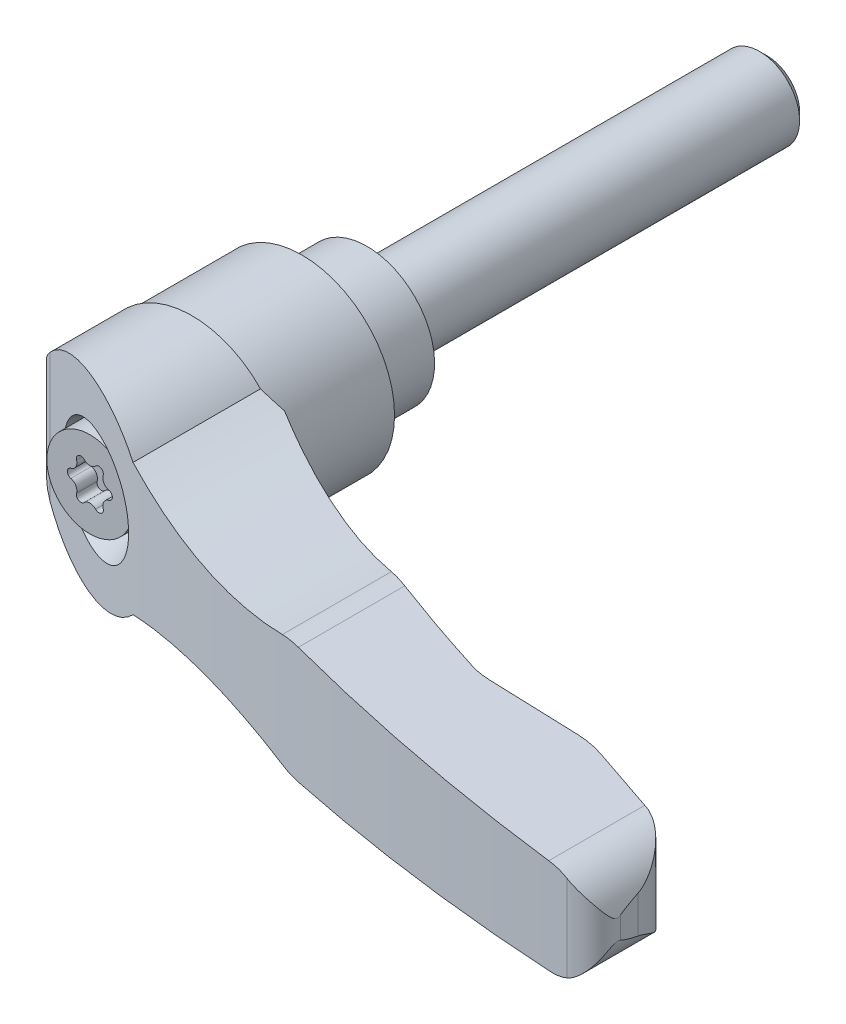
ISO-10303-21;
HEADER;
FILE_DESCRIPTION(('STEP AP214'),'2;1');
FILE_NAME('part.step','',(''),(''),'','','');
FILE_SCHEMA(('AUTOMOTIVE_DESIGN { 1 0 10303 214 1 1 1 1 }'));
ENDSEC;
DATA;
#1=APPLICATION_CONTEXT('core data for automotive mechanical design processes');
#2=APPLICATION_PROTOCOL_DEFINITION('international standard','automotive_design',2000,#1);
#3=PRODUCT_CONTEXT('',#1,'mechanical');
#4=PRODUCT('Part','Part','',(#3));
#5=PRODUCT_RELATED_PRODUCT_CATEGORY('part','',(#4));
#6=PRODUCT_DEFINITION_FORMATION('','',#4);
#7=PRODUCT_DEFINITION_CONTEXT('part definition',#1,'design');
#8=PRODUCT_DEFINITION('design','',#6,#7);
#9=PRODUCT_DEFINITION_SHAPE('','',#8);
#10=(LENGTH_UNIT() NAMED_UNIT(*) SI_UNIT(.MILLI.,.METRE.));
#11=(NAMED_UNIT(*) PLANE_ANGLE_UNIT() SI_UNIT($,.RADIAN.));
#12=(NAMED_UNIT(*) SI_UNIT($,.STERADIAN.) SOLID_ANGLE_UNIT());
#13=UNCERTAINTY_MEASURE_WITH_UNIT(LENGTH_MEASURE(1.E-05),#10,'distance_accuracy_value','');
#14=(GEOMETRIC_REPRESENTATION_CONTEXT(3) GLOBAL_UNCERTAINTY_ASSIGNED_CONTEXT((#13)) GLOBAL_UNIT_ASSIGNED_CONTEXT((#10,
#11,#12)) REPRESENTATION_CONTEXT('',''));
#15=CARTESIAN_POINT('',(0.,0.,0.));
#16=DIRECTION('',(0.,0.,1.));
#17=DIRECTION('',(1.,0.,0.));
#18=AXIS2_PLACEMENT_3D('',#15,#16,#17);
#19=CARTESIAN_POINT('',(0.,0.,7.15));
#20=DIRECTION('',(0.,0.,-1.));
#21=DIRECTION('',(0.,1.,0.));
#22=AXIS2_PLACEMENT_3D('',#19,#20,#21);
#23=CONICAL_SURFACE('',#22,6.75,0.78539816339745);
#24=CARTESIAN_POINT('',(0.,0.,6.9));
#25=DIRECTION('',(0.,0.,1.));
#26=DIRECTION('',(0.,-1.,0.));
#27=AXIS2_PLACEMENT_3D('',#24,#25,#26);
#28=CIRCLE('',#27,7.);
#29=CARTESIAN_POINT('',(0.,-7.,6.9));
#30=VERTEX_POINT('',#29);
#31=EDGE_CURVE('E1458',#30,#30,#28,.T.);
#32=ORIENTED_EDGE('',*,*,#31,.F.);
#33=EDGE_LOOP('',(#32));
#34=FACE_BOUND('',#33,.T.);
#35=CARTESIAN_POINT('',(0.,0.,7.15));
#36=DIRECTION('',(0.,0.,1.));
#37=DIRECTION('',(0.,-1.,0.));
#38=AXIS2_PLACEMENT_3D('',#35,#36,#37);
#39=CIRCLE('',#38,6.75);
#40=CARTESIAN_POINT('',(-0.00500000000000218,-6.74999814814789,7.15));
#41=VERTEX_POINT('',#40);
#42=CARTESIAN_POINT('',(-0.00500000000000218,6.74999814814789,7.15));
#43=VERTEX_POINT('',#42);
#44=EDGE_CURVE('E1455',#41,#43,#39,.T.);
#45=ORIENTED_EDGE('',*,*,#44,.T.);
#46=CARTESIAN_POINT('',(5.95054624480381,3.16771028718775,7.15882880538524));
#47=CARTESIAN_POINT('',(5.87214197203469,3.31526387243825,7.15871249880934));
#48=CARTESIAN_POINT('',(5.78824204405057,3.45989084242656,7.15858804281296));
#49=CARTESIAN_POINT('',(5.60995542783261,3.74252309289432,7.15832358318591));
#50=CARTESIAN_POINT('',(5.51556909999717,3.88052860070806,7.15818358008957));
#51=CARTESIAN_POINT('',(5.31687953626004,4.14906407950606,7.15788887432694));
#52=CARTESIAN_POINT('',(5.21258340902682,4.27959930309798,7.1577341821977));
#53=CARTESIAN_POINT('',(4.99462828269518,4.53255940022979,7.15741092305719));
#54=CARTESIAN_POINT('',(4.88096929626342,4.65498428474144,7.1572423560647));
#55=CARTESIAN_POINT('',(4.52680105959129,5.0091164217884,7.15671711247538));
#56=CARTESIAN_POINT('',(4.27301107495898,5.22780189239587,7.15634076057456));
#57=CARTESIAN_POINT('',(3.73579977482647,5.62522516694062,7.15554419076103));
#58=CARTESIAN_POINT('',(3.45237121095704,5.8039531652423,7.15512396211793));
#59=CARTESIAN_POINT('',(2.98991055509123,6.04972086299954,7.15443835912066));
#60=CARTESIAN_POINT('',(2.81864020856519,6.13166517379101,7.15418446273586));
#61=CARTESIAN_POINT('',(2.46976057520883,6.28086402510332,7.1536673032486));
#62=CARTESIAN_POINT('',(2.29215072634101,6.34811725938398,7.15340403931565));
#63=CARTESIAN_POINT('',(1.93187344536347,6.4674302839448,7.15287004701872));
#64=CARTESIAN_POINT('',(1.749205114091,6.51948735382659,7.15259931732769));
#65=CARTESIAN_POINT('',(1.38006402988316,6.60804492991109,7.15205225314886));
#66=CARTESIAN_POINT('',(1.19358993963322,6.64453986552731,7.1517759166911));
#67=CARTESIAN_POINT('',(0.818326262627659,6.70166995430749,7.15121984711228));
#68=CARTESIAN_POINT('',(0.62953790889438,6.72231320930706,7.15094011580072));
#69=CARTESIAN_POINT('',(0.250823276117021,6.74762924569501,7.15037900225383));
#70=CARTESIAN_POINT('',(0.0608966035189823,6.75229614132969,7.15009761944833));
#71=CARTESIAN_POINT('',(-0.318584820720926,6.745611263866,7.14953544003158));
#72=CARTESIAN_POINT('',(-0.50813970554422,6.73426704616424,7.14925464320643));
#73=CARTESIAN_POINT('',(-0.885690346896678,6.69564698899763,7.14869539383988));
#74=CARTESIAN_POINT('',(-1.07368550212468,6.66836527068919,7.148416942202));
#75=CARTESIAN_POINT('',(-1.44664736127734,6.59807116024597,7.14786455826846));
#76=CARTESIAN_POINT('',(-1.63161504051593,6.55506394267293,7.14759062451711));
#77=CARTESIAN_POINT('',(-1.99733844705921,6.45360450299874,7.14704902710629));
#78=CARTESIAN_POINT('',(-2.17809259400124,6.39514658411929,7.14678136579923));
#79=CARTESIAN_POINT('',(-2.53397104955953,6.26323162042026,7.14625441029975));
#80=CARTESIAN_POINT('',(-2.70909728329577,6.18977976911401,7.1459951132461));
#81=CARTESIAN_POINT('',(-3.05260414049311,6.02835694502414,7.14548653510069));
#82=CARTESIAN_POINT('',(-3.22098224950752,5.94038062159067,7.14523725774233));
#83=CARTESIAN_POINT('',(-3.54966502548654,5.75058860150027,7.14475068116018));
#84=CARTESIAN_POINT('',(-3.70997272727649,5.64877816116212,7.14451337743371));
#85=CARTESIAN_POINT('',(-4.02149908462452,5.43198004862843,7.14405224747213));
#86=CARTESIAN_POINT('',(-4.17271436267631,5.31698752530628,7.14382842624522));
#87=CARTESIAN_POINT('',(-4.46487029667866,5.0747031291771,7.14339601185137));
#88=CARTESIAN_POINT('',(-4.60581476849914,4.94741586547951,7.14318741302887));
#89=CARTESIAN_POINT('',(-4.87650660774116,4.68141969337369,7.14278680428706));
#90=CARTESIAN_POINT('',(-5.00624982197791,4.54270658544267,7.14259480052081));
#91=CARTESIAN_POINT('',(-5.37713243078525,4.11095768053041,7.1420459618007));
#92=CARTESIAN_POINT('',(-5.60024183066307,3.80204889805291,7.14171583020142));
#93=CARTESIAN_POINT('',(-5.99130267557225,3.15132134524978,7.14113721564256));
#94=CARTESIAN_POINT('',(-6.15925409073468,2.80950255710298,7.14088873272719));
#95=CARTESIAN_POINT('',(-6.4354212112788,2.10247678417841,7.14048016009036));
#96=CARTESIAN_POINT('',(-6.54363699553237,1.73726983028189,7.1403200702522));
#97=CARTESIAN_POINT('',(-6.69721027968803,0.993883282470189,7.14009288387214));
#98=CARTESIAN_POINT('',(-6.74256778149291,0.615703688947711,7.14002578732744));
#99=CARTESIAN_POINT('',(-6.76915048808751,-0.142905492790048,7.13998646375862));
#100=CARTESIAN_POINT('',(-6.75037574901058,-0.523335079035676,7.14001423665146));
#101=CARTESIAN_POINT('',(-6.64922373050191,-1.27564178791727,7.14016387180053));
#102=CARTESIAN_POINT('',(-6.56684643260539,-1.64751890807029,7.14028573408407));
#103=CARTESIAN_POINT('',(-6.3408273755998,-2.37216563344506,7.14062010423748));
#104=CARTESIAN_POINT('',(-6.19718558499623,-2.72493522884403,7.14083261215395));
#105=CARTESIAN_POINT('',(-5.85271992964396,-3.40135021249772,7.14134225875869));
#106=CARTESIAN_POINT('',(-5.65189615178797,-3.72499564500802,7.14163939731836));
#107=CARTESIAN_POINT('',(-5.19874978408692,-4.3339812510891,7.14230992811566));
#108=CARTESIAN_POINT('',(-4.94642727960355,-4.61932148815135,7.14268332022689));
#109=CARTESIAN_POINT('',(-4.39751106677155,-5.14357632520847,7.14349569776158));
#110=CARTESIAN_POINT('',(-4.10091709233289,-5.38249064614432,7.14393468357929));
#111=CARTESIAN_POINT('',(-3.47162650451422,-5.80719590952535,7.14486619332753));
#112=CARTESIAN_POINT('',(-3.13892958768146,-5.99298640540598,7.14535871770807));
#113=CARTESIAN_POINT('',(-2.62040810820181,-6.2277174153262,7.14612642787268));
#114=CARTESIAN_POINT('',(-2.4442237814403,-6.29866103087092,7.146387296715));
#115=CARTESIAN_POINT('',(-2.08652512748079,-6.4254556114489,7.14691695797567));
#116=CARTESIAN_POINT('',(-1.90501279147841,-6.48131213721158,7.14718574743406));
#117=CARTESIAN_POINT('',(-1.53787641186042,-6.57754805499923,7.14772944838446));
#118=CARTESIAN_POINT('',(-1.35225095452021,-6.61792203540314,7.14800436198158));
#119=CARTESIAN_POINT('',(-0.978324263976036,-6.68287651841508,7.14855818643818));
#120=CARTESIAN_POINT('',(-0.790024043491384,-6.7074628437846,7.14883709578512));
#121=CARTESIAN_POINT('',(-0.41194099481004,-6.74069534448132,7.149397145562));
#122=CARTESIAN_POINT('',(-0.22215756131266,-6.74933462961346,7.14967828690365));
#123=CARTESIAN_POINT('',(0.157392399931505,-6.75059115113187,7.15024057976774));
#124=CARTESIAN_POINT('',(0.347158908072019,-6.74321429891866,7.15052173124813));
#125=CARTESIAN_POINT('',(0.725474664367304,-6.71249645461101,7.15108226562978));
#126=CARTESIAN_POINT('',(0.91402337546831,-6.68914884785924,7.15136164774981));
#127=CARTESIAN_POINT('',(1.28841363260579,-6.62666031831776,7.1519164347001));
#128=CARTESIAN_POINT('',(1.47425615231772,-6.58752522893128,7.15219184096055));
#129=CARTESIAN_POINT('',(1.84202427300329,-6.49372979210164,7.15273688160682));
#130=CARTESIAN_POINT('',(2.02394901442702,-6.43906607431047,7.15300651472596));
#131=CARTESIAN_POINT('',(2.38247988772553,-6.31462857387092,7.15353792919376));
#132=CARTESIAN_POINT('',(2.55908795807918,-6.24486037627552,7.15379971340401));
#133=CARTESIAN_POINT('',(2.90586095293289,-6.09067104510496,7.15431376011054));
#134=CARTESIAN_POINT('',(3.0760236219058,-6.00624483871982,7.1545660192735));
#135=CARTESIAN_POINT('',(3.40856965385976,-5.82339024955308,7.15505903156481));
#136=CARTESIAN_POINT('',(3.57095586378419,-5.72496704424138,7.15529978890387));
#137=CARTESIAN_POINT('',(3.88695180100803,-5.51473477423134,7.15576831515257));
#138=CARTESIAN_POINT('',(4.04055650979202,-5.40291816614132,7.15599607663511));
#139=CARTESIAN_POINT('',(4.33774237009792,-5.16678267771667,7.1564367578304));
#140=CARTESIAN_POINT('',(4.48132720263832,-5.04246843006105,7.15664968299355));
#141=CARTESIAN_POINT('',(4.75747498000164,-4.78222404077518,7.1570592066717));
#142=CARTESIAN_POINT('',(4.89004107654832,-4.64629724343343,7.1572558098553));
#143=CARTESIAN_POINT('',(5.1432585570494,-4.36376193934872,7.15763136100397));
#144=CARTESIAN_POINT('',(5.26390979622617,-4.21715330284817,7.1578103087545));
#145=CARTESIAN_POINT('',(5.49251358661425,-3.91418724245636,7.15814938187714));
#146=CARTESIAN_POINT('',(5.6004571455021,-3.75782303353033,7.15830949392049));
#147=CARTESIAN_POINT('',(5.80280439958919,-3.43655641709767,7.15860964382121));
#148=CARTESIAN_POINT('',(5.89720744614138,-3.27165360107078,7.15874968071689));
#149=CARTESIAN_POINT('',(5.98446360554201,-3.10304786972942,7.15887911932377));
#150=B_SPLINE_CURVE_WITH_KNOTS('',3,(#46,#47,#48,#49,#50,#51,#52,#53,#54,#55,#56,#57,#58,#59,
#60,#61,#62,#63,#64,#65,#66,#67,#68,#69,#70,#71,#72,#73,#74,#75,#76,#77,#78,#79,#80,#81,#82,#83,
#84,#85,#86,#87,#88,#89,#90,#91,#92,#93,#94,#95,#96,#97,#98,#99,#100,#101,#102,#103,#104,#105,
#106,#107,#108,#109,#110,#111,#112,#113,#114,#115,#116,#117,#118,#119,#120,#121,#122,#123,#124,
#125,#126,#127,#128,#129,#130,#131,#132,#133,#134,#135,#136,#137,#138,#139,#140,#141,#142,#143,
#144,#145,#146,#147,#148,#149),.UNSPECIFIED.,.F.,.F.,(4,2,2,2,2,2,2,2,2,2,2,2,2,2,2,2,2,2,2,2,2,
2,2,2,2,2,2,2,2,2,2,2,2,2,2,2,2,2,2,2,2,2,2,2,2,2,2,2,2,2,2,4),(0.,0.501146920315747,
1.00227662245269,1.50304952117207,2.00382174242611,3.00491984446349,4.00626334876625,
4.57526571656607,5.14431865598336,5.71347340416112,6.28283171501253,6.85189883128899,
7.42117557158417,7.99018376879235,8.55940198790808,9.1284330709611,9.69767425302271,
10.2667185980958,10.8359730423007,11.4050117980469,11.9742606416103,12.5432969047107,
13.1125432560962,14.2498149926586,15.3870873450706,16.5243581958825,17.6616290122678,
18.7988988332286,19.9361689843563,21.0734397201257,22.2107087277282,23.3479758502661,
24.4852498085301,25.6225333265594,26.1917743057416,26.7608051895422,27.3300347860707,
27.8990543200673,28.4683196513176,29.0373749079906,29.6066659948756,30.1757469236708,
30.7449514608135,31.3139458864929,31.8831376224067,32.4521193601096,33.0214230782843,
33.5905165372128,34.1594466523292,34.7283836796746,35.2977209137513,35.8670854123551),.UNSPECIFIED.);
#151=EDGE_CURVE('E1418',#43,#41,#150,.T.);
#152=ORIENTED_EDGE('',*,*,#151,.T.);
#153=EDGE_LOOP('',(#45,#152));
#154=FACE_BOUND('',#153,.T.);
#155=ADVANCED_FACE('F15',(#34,#154),#23,.F.);
#156=CARTESIAN_POINT('',(0.,0.,6.5));
#157=DIRECTION('',(0.,0.,1.));
#158=DIRECTION('',(0.,-1.,0.));
#159=AXIS2_PLACEMENT_3D('',#156,#157,#158);
#160=CYLINDRICAL_SURFACE('',#159,7.);
#161=CARTESIAN_POINT('',(0.,0.,6.5));
#162=DIRECTION('',(0.,0.,-1.));
#163=DIRECTION('',(1.,0.,0.));
#164=AXIS2_PLACEMENT_3D('',#161,#162,#163);
#165=CIRCLE('',#164,7.);
#166=CARTESIAN_POINT('',(7.,0.,6.5));
#167=VERTEX_POINT('',#166);
#168=EDGE_CURVE('E745',#167,#167,#165,.T.);
#169=ORIENTED_EDGE('',*,*,#168,.T.);
#170=EDGE_LOOP('',(#169));
#171=FACE_BOUND('',#170,.T.);
#172=ORIENTED_EDGE('',*,*,#31,.T.);
#173=EDGE_LOOP('',(#172));
#174=FACE_BOUND('',#173,.T.);
#175=ADVANCED_FACE('F1107',(#171,#174),#160,.F.);
#176=CARTESIAN_POINT('',(0.,0.,6.5));
#177=DIRECTION('',(0.,0.,1.));
#178=DIRECTION('',(0.,-1.,0.));
#179=AXIS2_PLACEMENT_3D('',#176,#177,#178);
#180=CYLINDRICAL_SURFACE('',#179,6.75);
#181=ORIENTED_EDGE('',*,*,#44,.F.);
#182=DIRECTION('',(0.,0.,1.));
#183=VECTOR('',#182,1.);
#184=CARTESIAN_POINT('',(-0.00500000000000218,-6.74999814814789,8.25));
#185=LINE('',#184,#183);
#186=CARTESIAN_POINT('',(-0.00500000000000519,-6.7499981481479,16.5));
#187=VERTEX_POINT('',#186);
#188=EDGE_CURVE('E1428',#41,#187,#185,.T.);
#189=ORIENTED_EDGE('',*,*,#188,.T.);
#190=CARTESIAN_POINT('',(0.,0.,16.5));
#191=DIRECTION('',(0.,0.,1.));
#192=DIRECTION('',(0.,-1.,0.));
#193=AXIS2_PLACEMENT_3D('',#190,#191,#192);
#194=CIRCLE('',#193,6.75);
#195=CARTESIAN_POINT('',(-0.00499999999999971,6.7499981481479,16.5));
#196=VERTEX_POINT('',#195);
#197=EDGE_CURVE('E1451',#187,#196,#194,.T.);
#198=ORIENTED_EDGE('',*,*,#197,.T.);
#199=DIRECTION('',(0.,0.,1.));
#200=VECTOR('',#199,1.);
#201=CARTESIAN_POINT('',(-0.00500000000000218,6.74999814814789,8.25));
#202=LINE('',#201,#200);
#203=EDGE_CURVE('E1424',#196,#43,#202,.F.);
#204=ORIENTED_EDGE('',*,*,#203,.T.);
#205=EDGE_LOOP('',(#181,#189,#198,#204));
#206=FACE_BOUND('',#205,.T.);
#207=ADVANCED_FACE('F1098',(#206),#180,.F.);
#208=CARTESIAN_POINT('',(4.15,0.,16.5));
#209=DIRECTION('',(0.,0.,1.));
#210=DIRECTION('',(0.,-1.,0.));
#211=AXIS2_PLACEMENT_3D('',#208,#209,#210);
#212=PLANE('',#211);
#213=ORIENTED_EDGE('',*,*,#197,.F.);
#214=CARTESIAN_POINT('',(-0.0100000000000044,0.,16.5));
#215=DIRECTION('',(0.,0.,1.));
#216=DIRECTION('',(-1.,0.,0.));
#217=AXIS2_PLACEMENT_3D('',#214,#215,#216);
#218=CIRCLE('',#217,6.75);
#219=EDGE_CURVE('E1425',#187,#196,#218,.T.);
#220=ORIENTED_EDGE('',*,*,#219,.T.);
#221=EDGE_LOOP('',(#213,#220));
#222=FACE_BOUND('',#221,.T.);
#223=ADVANCED_FACE('F404',(#222),#212,.F.);
#224=CARTESIAN_POINT('',(-0.0099999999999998,0.,6.5));
#225=DIRECTION('',(0.,0.,-1.));
#226=DIRECTION('',(1.,0.,0.));
#227=AXIS2_PLACEMENT_3D('',#224,#225,#226);
#228=PLANE('',#227);
#229=ORIENTED_EDGE('',*,*,#168,.F.);
#230=EDGE_LOOP('',(#229));
#231=FACE_BOUND('',#230,.T.);
#232=DIRECTION('',(0.,1.,0.));
#233=VECTOR('',#232,1.);
#234=CARTESIAN_POINT('',(-9.0100377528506,-19.,6.5));
#235=LINE('',#234,#233);
#236=CARTESIAN_POINT('',(-9.0100377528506,-2.13584185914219,6.5));
#237=VERTEX_POINT('',#236);
#238=CARTESIAN_POINT('',(-9.0100377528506,2.13584185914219,6.5));
#239=VERTEX_POINT('',#238);
#240=EDGE_CURVE('E124',#237,#239,#235,.T.);
#241=ORIENTED_EDGE('',*,*,#240,.T.);
#242=CARTESIAN_POINT('',(-0.0099999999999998,0.,6.5));
#243=DIRECTION('',(0.,0.,-1.));
#244=DIRECTION('',(1.,0.,0.));
#245=AXIS2_PLACEMENT_3D('',#242,#243,#244);
#246=CIRCLE('',#245,9.25);
#247=EDGE_CURVE('E609',#239,#237,#246,.T.);
#248=ORIENTED_EDGE('',*,*,#247,.T.);
#249=EDGE_LOOP('',(#241,#248));
#250=FACE_BOUND('',#249,.T.);
#251=ADVANCED_FACE('F399',(#231,#250),#228,.T.);
#252=CARTESIAN_POINT('',(-9.26,-19.,6.7499622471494));
#253=DIRECTION('',(0.707106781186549,0.,0.707106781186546));
#254=DIRECTION('',(-0.707106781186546,0.,0.707106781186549));
#255=AXIS2_PLACEMENT_3D('',#252,#253,#254);
#256=PLANE('',#255);
#257=CARTESIAN_POINT('',(-0.00999999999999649,0.,-2.50003775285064));
#258=DIRECTION('',(0.707106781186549,0.,0.707106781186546));
#259=DIRECTION('',(0.707106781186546,0.,-0.707106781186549));
#260=AXIS2_PLACEMENT_3D('',#257,#258,#259);
#261=ELLIPSE('',#260,13.0814754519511,9.25);
#262=EDGE_CURVE('E317',#237,#239,#261,.F.);
#263=ORIENTED_EDGE('',*,*,#262,.T.);
#264=ORIENTED_EDGE('',*,*,#240,.F.);
#265=EDGE_LOOP('',(#263,#264));
#266=FACE_BOUND('',#265,.T.);
#267=ADVANCED_FACE('F403',(#266),#256,.F.);
#268=CARTESIAN_POINT('',(-0.010000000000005,0.,20.625));
#269=DIRECTION('',(0.,0.,-1.));
#270=DIRECTION('',(1.,0.,0.));
#271=AXIS2_PLACEMENT_3D('',#268,#269,#270);
#272=CYLINDRICAL_SURFACE('',#271,9.25);
#273=CARTESIAN_POINT('',(-0.0100000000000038,0.,17.5));
#274=DIRECTION('',(0.,0.,1.));
#275=DIRECTION('',(0.,-1.,0.));
#276=AXIS2_PLACEMENT_3D('',#273,#274,#275);
#277=CIRCLE('',#276,9.25);
#278=CARTESIAN_POINT('',(-9.26,0.,17.5));
#279=VERTEX_POINT('',#278);
#280=CARTESIAN_POINT('',(9.24,0.,17.5));
#281=VERTEX_POINT('',#280);
#282=EDGE_CURVE('E650',#279,#281,#277,.T.);
#283=ORIENTED_EDGE('',*,*,#282,.F.);
#284=EDGE_CURVE('E630',#281,#279,#277,.T.);
#285=ORIENTED_EDGE('',*,*,#284,.F.);
#286=EDGE_LOOP('',(#283,#285));
#287=FACE_BOUND('',#286,.T.);
#288=ORIENTED_EDGE('',*,*,#262,.F.);
#289=ORIENTED_EDGE('',*,*,#247,.F.);
#290=EDGE_LOOP('',(#288,#289));
#291=FACE_BOUND('',#290,.T.);
#292=ADVANCED_FACE('F406',(#287,#291),#272,.T.);
#293=CARTESIAN_POINT('',(0.,0.,6.5));
#294=DIRECTION('',(0.,0.,1.));
#295=DIRECTION('',(0.,-1.,0.));
#296=AXIS2_PLACEMENT_3D('',#293,#294,#295);
#297=CYLINDRICAL_SURFACE('',#296,2.5);
#298=CARTESIAN_POINT('',(0.,0.,19.));
#299=DIRECTION('',(0.,0.,1.));
#300=DIRECTION('',(0.,-1.,0.));
#301=AXIS2_PLACEMENT_3D('',#298,#299,#300);
#302=CIRCLE('',#301,2.5);
#303=CARTESIAN_POINT('',(-0.00500000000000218,-2.499994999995,19.));
#304=VERTEX_POINT('',#303);
#305=CARTESIAN_POINT('',(-0.00500000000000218,2.499994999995,19.));
#306=VERTEX_POINT('',#305);
#307=EDGE_CURVE('E302',#304,#306,#302,.T.);
#308=ORIENTED_EDGE('',*,*,#307,.F.);
#309=DIRECTION('',(0.,0.,1.));
#310=VECTOR('',#309,1.);
#311=CARTESIAN_POINT('',(-0.00500000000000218,-2.499994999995,21.95));
#312=LINE('',#311,#310);
#313=CARTESIAN_POINT('',(-0.00500000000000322,-2.499994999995,20.));
#314=VERTEX_POINT('',#313);
#315=EDGE_CURVE('E19',#304,#314,#312,.T.);
#316=ORIENTED_EDGE('',*,*,#315,.T.);
#317=CARTESIAN_POINT('',(0.,0.,20.));
#318=DIRECTION('',(0.,0.,1.));
#319=DIRECTION('',(0.,-1.,0.));
#320=AXIS2_PLACEMENT_3D('',#317,#318,#319);
#321=CIRCLE('',#320,2.5);
#322=CARTESIAN_POINT('',(-0.00500000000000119,2.499994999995,20.));
#323=VERTEX_POINT('',#322);
#324=EDGE_CURVE('E300',#314,#323,#321,.T.);
#325=ORIENTED_EDGE('',*,*,#324,.T.);
#326=DIRECTION('',(0.,0.,1.));
#327=VECTOR('',#326,1.);
#328=CARTESIAN_POINT('',(-0.00500000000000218,2.499994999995,21.95));
#329=LINE('',#328,#327);
#330=EDGE_CURVE('E294',#323,#306,#329,.F.);
#331=ORIENTED_EDGE('',*,*,#330,.T.);
#332=EDGE_LOOP('',(#308,#316,#325,#331));
#333=FACE_BOUND('',#332,.T.);
#334=ADVANCED_FACE('F299',(#333),#297,.F.);
#335=CARTESIAN_POINT('',(4.3,0.,20.));
#336=DIRECTION('',(0.,0.,-1.));
#337=DIRECTION('',(0.,1.,0.));
#338=AXIS2_PLACEMENT_3D('',#335,#336,#337);
#339=PLANE('',#338);
#340=ORIENTED_EDGE('',*,*,#324,.F.);
#341=CARTESIAN_POINT('',(-0.0100000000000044,0.,20.));
#342=DIRECTION('',(0.,0.,-1.));
#343=DIRECTION('',(1.,0.,0.));
#344=AXIS2_PLACEMENT_3D('',#341,#342,#343);
#345=CIRCLE('',#344,2.5);
#346=EDGE_CURVE('E26',#314,#323,#345,.T.);
#347=ORIENTED_EDGE('',*,*,#346,.T.);
#348=EDGE_LOOP('',(#340,#347));
#349=FACE_BOUND('',#348,.T.);
#350=CARTESIAN_POINT('',(0.,0.,20.));
#351=DIRECTION('',(0.,0.,1.));
#352=DIRECTION('',(0.,-1.,0.));
#353=AXIS2_PLACEMENT_3D('',#350,#351,#352);
#354=CIRCLE('',#353,4.3);
#355=CARTESIAN_POINT('',(0.,-4.3,20.));
#356=VERTEX_POINT('',#355);
#357=EDGE_CURVE('E306',#356,#356,#354,.T.);
#358=ORIENTED_EDGE('',*,*,#357,.T.);
#359=EDGE_LOOP('',(#358));
#360=FACE_BOUND('',#359,.T.);
#361=ADVANCED_FACE('F304',(#349,#360),#339,.F.);
#362=CARTESIAN_POINT('',(0.,0.,6.5));
#363=DIRECTION('',(0.,0.,1.));
#364=DIRECTION('',(0.,-1.,0.));
#365=AXIS2_PLACEMENT_3D('',#362,#363,#364);
#366=CYLINDRICAL_SURFACE('',#365,4.3);
#367=ORIENTED_EDGE('',*,*,#357,.F.);
#368=EDGE_LOOP('',(#367));
#369=FACE_BOUND('',#368,.T.);
#370=CARTESIAN_POINT('',(0.,0.,24.9));
#371=DIRECTION('',(0.,0.,1.));
#372=DIRECTION('',(0.,-1.,0.));
#373=AXIS2_PLACEMENT_3D('',#370,#371,#372);
#374=CIRCLE('',#373,4.3);
#375=CARTESIAN_POINT('',(-0.00500000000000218,4.29999709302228,24.9));
#376=VERTEX_POINT('',#375);
#377=CARTESIAN_POINT('',(-0.00500000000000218,-4.29999709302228,24.9));
#378=VERTEX_POINT('',#377);
#379=EDGE_CURVE('E34',#376,#378,#374,.T.);
#380=ORIENTED_EDGE('',*,*,#379,.T.);
#381=EDGE_CURVE('E309',#378,#376,#374,.T.);
#382=ORIENTED_EDGE('',*,*,#381,.T.);
#383=EDGE_LOOP('',(#380,#382));
#384=FACE_BOUND('',#383,.T.);
#385=ADVANCED_FACE('F734',(#369,#384),#366,.F.);
#386=CARTESIAN_POINT('',(0.,0.,35.));
#387=DIRECTION('',(0.,0.,1.));
#388=DIRECTION('',(0.,-1.,0.));
#389=AXIS2_PLACEMENT_3D('',#386,#387,#388);
#390=CONICAL_SURFACE('',#389,7.9760993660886,0.349065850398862);
#391=ORIENTED_EDGE('',*,*,#381,.F.);
#392=CARTESIAN_POINT('',(4.21911062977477,0.777575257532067,24.8729792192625));
#393=CARTESIAN_POINT('',(4.19017452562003,0.935198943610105,24.8731645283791));
#394=CARTESIAN_POINT('',(4.15234047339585,1.09119842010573,24.8734068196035));
#395=CARTESIAN_POINT('',(4.059442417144,1.39832967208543,24.8740017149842));
#396=CARTESIAN_POINT('',(4.00434335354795,1.54945084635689,24.8743545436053));
#397=CARTESIAN_POINT('',(3.88711156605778,1.8224107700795,24.8751051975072));
#398=CARTESIAN_POINT('',(3.82727411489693,1.94524131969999,24.8754883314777));
#399=CARTESIAN_POINT('',(3.69616738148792,2.18470908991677,24.8763277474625));
#400=CARTESIAN_POINT('',(3.62489389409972,2.30134401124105,24.8767840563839));
#401=CARTESIAN_POINT('',(3.47154435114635,2.52735215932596,24.8777657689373));
#402=CARTESIAN_POINT('',(3.38946369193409,2.63672226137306,24.8782912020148));
#403=CARTESIAN_POINT('',(3.21521868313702,2.84721641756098,24.879406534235));
#404=CARTESIAN_POINT('',(3.1230486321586,2.94833575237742,24.879996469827));
#405=CARTESIAN_POINT('',(2.92952252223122,3.14131773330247,24.8812350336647));
#406=CARTESIAN_POINT('',(2.82816855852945,3.23318248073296,24.8818836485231));
#407=CARTESIAN_POINT('',(2.61723558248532,3.40679926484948,24.8832333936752));
#408=CARTESIAN_POINT('',(2.50766118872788,3.48855691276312,24.8839344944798));
#409=CARTESIAN_POINT('',(2.28124664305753,3.6412681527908,24.8853830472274));
#410=CARTESIAN_POINT('',(2.16440734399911,3.71222300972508,24.8861304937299));
#411=CARTESIAN_POINT('',(1.92451769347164,3.842691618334,24.8876649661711));
#412=CARTESIAN_POINT('',(1.80146803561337,3.90220664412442,24.8884519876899));
#413=CARTESIAN_POINT('',(1.56465844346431,4.00313271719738,24.8899664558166));
#414=CARTESIAN_POINT('',(1.45144687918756,4.04583613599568,24.8906904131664));
#415=CARTESIAN_POINT('',(1.22178798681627,4.12156773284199,24.8921588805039));
#416=CARTESIAN_POINT('',(1.10533963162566,4.15459280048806,24.892903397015));
#417=CARTESIAN_POINT('',(0.870158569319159,4.21069182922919,24.8944068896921));
#418=CARTESIAN_POINT('',(0.751427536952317,4.23377281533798,24.8951658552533));
#419=CARTESIAN_POINT('',(0.512399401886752,4.2698610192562,24.8966936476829));
#420=CARTESIAN_POINT('',(0.392101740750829,4.28286453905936,24.8974624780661));
#421=CARTESIAN_POINT('',(0.150864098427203,4.29868948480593,24.8990040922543));
#422=CARTESIAN_POINT('',(0.0299242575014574,4.30151304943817,24.8997768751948));
#423=CARTESIAN_POINT('',(-0.211808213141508,4.29696318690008,24.9013213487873));
#424=CARTESIAN_POINT('',(-0.332600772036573,4.28958599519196,24.9020930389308));
#425=CARTESIAN_POINT('',(-0.573100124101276,4.26468392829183,24.903629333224));
#426=CARTESIAN_POINT('',(-0.692807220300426,4.24716197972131,24.9043939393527));
#427=CARTESIAN_POINT('',(-0.930363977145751,4.20208899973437,24.9059111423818));
#428=CARTESIAN_POINT('',(-1.04821293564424,4.17453426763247,24.9066637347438));
#429=CARTESIAN_POINT('',(-1.28112388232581,4.10960500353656,24.9081509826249));
#430=CARTESIAN_POINT('',(-1.39618696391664,4.07223439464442,24.9088856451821));
#431=CARTESIAN_POINT('',(-1.62279691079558,3.98792042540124,24.9103323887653));
#432=CARTESIAN_POINT('',(-1.73434246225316,3.94097353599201,24.9110444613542));
#433=CARTESIAN_POINT('',(-1.95304539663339,3.83786097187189,24.912440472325));
#434=CARTESIAN_POINT('',(-2.06020444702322,3.78169884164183,24.913124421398));
#435=CARTESIAN_POINT('',(-2.26942713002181,3.66055052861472,24.91445968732));
#436=CARTESIAN_POINT('',(-2.37148886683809,3.59556109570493,24.9151109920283));
#437=CARTESIAN_POINT('',(-2.66883118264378,3.38805062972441,24.9170083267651));
#438=CARTESIAN_POINT('',(-2.85550725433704,3.23287477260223,24.9181992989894));
#439=CARTESIAN_POINT('',(-3.20005222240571,2.89346359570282,24.9203971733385));
#440=CARTESIAN_POINT('',(-3.35792107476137,2.70922823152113,24.9214040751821));
#441=CARTESIAN_POINT('',(-3.64051281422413,2.31684980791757,24.9232062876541));
#442=CARTESIAN_POINT('',(-3.76523634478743,2.10870721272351,24.9240016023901));
#443=CARTESIAN_POINT('',(-3.97796133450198,1.67444195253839,24.9253579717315));
#444=CARTESIAN_POINT('',(-4.06596278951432,1.44831928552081,24.9259190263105));
#445=CARTESIAN_POINT('',(-4.20275431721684,0.984511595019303,24.9267911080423));
#446=CARTESIAN_POINT('',(-4.25154513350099,0.746826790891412,24.9271021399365));
#447=CARTESIAN_POINT('',(-4.30853013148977,0.266639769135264,24.9274654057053));
#448=CARTESIAN_POINT('',(-4.31672432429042,0.0241375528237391,24.9275176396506));
#449=CARTESIAN_POINT('',(-4.29228436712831,-0.458797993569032,24.9273618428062));
#450=CARTESIAN_POINT('',(-4.25965066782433,-0.699231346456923,24.9271538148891));
#451=CARTESIAN_POINT('',(-4.15448192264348,-1.17120658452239,24.9264833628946));
#452=CARTESIAN_POINT('',(-4.08194687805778,-1.40274846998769,24.9260209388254));
#453=CARTESIAN_POINT('',(-3.89903487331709,-1.8503684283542,24.9248547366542));
#454=CARTESIAN_POINT('',(-3.7886578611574,-2.06644648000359,24.9241509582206));
#455=CARTESIAN_POINT('',(-3.53319455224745,-2.47700499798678,24.9225218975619));
#456=CARTESIAN_POINT('',(-3.38810824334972,-2.67148545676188,24.9215966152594));
#457=CARTESIAN_POINT('',(-3.0673461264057,-3.03333067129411,24.9195506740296));
#458=CARTESIAN_POINT('',(-2.89166990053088,-3.20069505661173,24.9184300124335));
#459=CARTESIAN_POINT('',(-2.51470447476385,-3.50355516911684,24.9160249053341));
#460=CARTESIAN_POINT('',(-2.31341528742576,-3.63905091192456,24.9147404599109));
#461=CARTESIAN_POINT('',(-1.89097836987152,-3.87432713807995,24.9120443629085));
#462=CARTESIAN_POINT('',(-1.66983024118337,-3.97410690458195,24.9106327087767));
#463=CARTESIAN_POINT('',(-1.21378932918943,-4.13512752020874,24.9077211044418));
#464=CARTESIAN_POINT('',(-0.978896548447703,-4.19636837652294,24.9062211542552));
#465=CARTESIAN_POINT('',(-0.621588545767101,-4.25800990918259,24.9039390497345));
#466=CARTESIAN_POINT('',(-0.501591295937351,-4.27352066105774,24.9031725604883));
#467=CARTESIAN_POINT('',(-0.260728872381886,-4.29438227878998,24.9016338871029));
#468=CARTESIAN_POINT('',(-0.139864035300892,-4.29973689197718,24.9008617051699));
#469=CARTESIAN_POINT('',(0.101924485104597,-4.30024439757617,24.8993168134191));
#470=CARTESIAN_POINT('',(0.222848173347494,-4.2953934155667,24.8985441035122));
#471=CARTESIAN_POINT('',(0.463814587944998,-4.27552414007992,24.8970041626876));
#472=CARTESIAN_POINT('',(0.583857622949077,-4.26050959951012,24.8962369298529));
#473=CARTESIAN_POINT('',(0.822300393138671,-4.22041448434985,24.8947128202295));
#474=CARTESIAN_POINT('',(0.940699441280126,-4.19532982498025,24.8939559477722));
#475=CARTESIAN_POINT('',(1.17491972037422,-4.13528424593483,24.8924585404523));
#476=CARTESIAN_POINT('',(1.29074188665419,-4.10032697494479,24.8917179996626));
#477=CARTESIAN_POINT('',(1.51906443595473,-4.02076877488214,24.8902580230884));
#478=CARTESIAN_POINT('',(1.6315638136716,-3.97616496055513,24.8895385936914));
#479=CARTESIAN_POINT('',(1.85236368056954,-3.87765526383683,24.8881264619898));
#480=CARTESIAN_POINT('',(1.96066570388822,-3.82375282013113,24.8874337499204));
#481=CARTESIAN_POINT('',(2.17236892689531,-3.7070043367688,24.8860795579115));
#482=CARTESIAN_POINT('',(2.27576902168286,-3.64415629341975,24.8854180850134));
#483=CARTESIAN_POINT('',(2.4768700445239,-3.50999748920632,24.884131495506));
#484=CARTESIAN_POINT('',(2.5745730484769,-3.43868983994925,24.8835063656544));
#485=CARTESIAN_POINT('',(2.76369288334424,-3.28804682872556,24.8822962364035));
#486=CARTESIAN_POINT('',(2.85510533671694,-3.2087059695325,24.8817112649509));
#487=CARTESIAN_POINT('',(3.03088826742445,-3.04263305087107,24.8805863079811));
#488=CARTESIAN_POINT('',(3.11526099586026,-2.95590337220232,24.8800463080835));
#489=CARTESIAN_POINT('',(3.28683431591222,-2.76396860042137,24.8789481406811));
#490=CARTESIAN_POINT('',(3.37298834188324,-2.65782496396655,24.8783966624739));
#491=CARTESIAN_POINT('',(3.53477785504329,-2.4378649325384,24.8773609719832));
#492=CARTESIAN_POINT('',(3.6104169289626,-2.32405117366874,24.8768767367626));
#493=CARTESIAN_POINT('',(3.75057830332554,-2.0896671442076,24.8759793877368));
#494=CARTESIAN_POINT('',(3.81509300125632,-1.96909232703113,24.87556632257));
#495=CARTESIAN_POINT('',(3.93234744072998,-1.72236659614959,24.8748155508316));
#496=CARTESIAN_POINT('',(3.98508918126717,-1.59621663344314,24.8744778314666));
#497=CARTESIAN_POINT('',(4.07302731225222,-1.3540839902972,24.8739147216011));
#498=CARTESIAN_POINT('',(4.10953669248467,-1.2385758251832,24.8736809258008));
#499=CARTESIAN_POINT('',(4.17268203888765,-1.00489562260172,24.8732765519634));
#500=CARTESIAN_POINT('',(4.19931879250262,-0.886723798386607,24.8731059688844));
#501=CARTESIAN_POINT('',(4.24248727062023,-0.648801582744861,24.8728295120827));
#502=CARTESIAN_POINT('',(4.25903930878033,-0.529054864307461,24.8727235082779));
#503=CARTESIAN_POINT('',(4.2819987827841,-0.288641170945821,24.8725764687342));
#504=CARTESIAN_POINT('',(4.2884118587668,-0.167974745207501,24.8725353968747));
#505=CARTESIAN_POINT('',(4.29028727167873,0.00244530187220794,24.872523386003));
#506=CARTESIAN_POINT('',(4.28997110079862,0.0521813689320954,24.8725254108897));
#507=CARTESIAN_POINT('',(4.28761529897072,0.151554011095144,24.8725404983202));
#508=CARTESIAN_POINT('',(4.28557770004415,0.201190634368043,24.8725535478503));
#509=CARTESIAN_POINT('',(4.28268073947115,0.250782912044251,24.8725721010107));
#510=B_SPLINE_CURVE_WITH_KNOTS('',3,(#392,#393,#394,#395,#396,#397,#398,#399,#400,#401,#402,
#403,#404,#405,#406,#407,#408,#409,#410,#411,#412,#413,#414,#415,#416,#417,#418,#419,#420,#421,
#422,#423,#424,#425,#426,#427,#428,#429,#430,#431,#432,#433,#434,#435,#436,#437,#438,#439,#440,
#441,#442,#443,#444,#445,#446,#447,#448,#449,#450,#451,#452,#453,#454,#455,#456,#457,#458,#459,
#460,#461,#462,#463,#464,#465,#466,#467,#468,#469,#470,#471,#472,#473,#474,#475,#476,#477,#478,
#479,#480,#481,#482,#483,#484,#485,#486,#487,#488,#489,#490,#491,#492,#493,#494,#495,#496,#497,
#498,#499,#500,#501,#502,#503,#504,#505,#506,#507,#508,#509),.UNSPECIFIED.,.F.,.F.,(4,2,2,2,2,2,
2,2,2,2,2,2,2,2,2,2,2,2,2,2,2,2,2,2,2,2,2,2,2,2,2,2,2,2,2,2,2,2,2,2,2,2,2,2,2,2,2,2,2,2,2,2,2,2,
2,2,2,2,4),(0.,0.480548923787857,0.962080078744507,1.37137145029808,1.78081366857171,
2.19043086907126,2.60028074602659,3.01003735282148,3.41956544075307,3.82904554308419,
4.23848001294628,4.6010595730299,4.96375553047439,5.32619483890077,5.68876708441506,
6.05126315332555,6.41389303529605,6.77641835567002,7.13907753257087,7.50159198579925,
7.86424027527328,8.22674940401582,8.58939236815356,9.3138972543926,10.038403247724,
10.7628951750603,11.4873871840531,12.2118654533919,12.9363435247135,13.6608135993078,
14.3852836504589,15.1097546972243,15.8342259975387,16.5587071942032,17.2831880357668,
18.0076834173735,18.732178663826,19.0948199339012,19.4573273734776,19.8199724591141,
20.1824837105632,20.5451421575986,20.9076667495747,21.2702999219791,21.6327992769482,
21.9953799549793,22.3578276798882,22.7205251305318,23.0831061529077,23.492599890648,
23.9019536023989,24.3115859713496,24.7211487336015,25.0841506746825,25.4471236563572,
25.8093630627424,26.171400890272,26.3205880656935,26.4695993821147),.UNSPECIFIED.);
#511=EDGE_CURVE('E9',#378,#376,#510,.F.);
#512=ORIENTED_EDGE('',*,*,#511,.T.);
#513=EDGE_LOOP('',(#391,#512));
#514=FACE_BOUND('',#513,.T.);
#515=CARTESIAN_POINT('',(-3.02765260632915,3.78926210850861,26.411873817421));
#516=CARTESIAN_POINT('',(-2.9235493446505,3.89264227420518,26.4552353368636));
#517=CARTESIAN_POINT('',(-2.81553629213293,3.99143305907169,26.5001294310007));
#518=CARTESIAN_POINT('',(-2.59251111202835,4.17941486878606,26.5926003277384));
#519=CARTESIAN_POINT('',(-2.477496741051,4.26860279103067,26.6401779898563));
#520=CARTESIAN_POINT('',(-2.12287257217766,4.52137453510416,26.7864934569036));
#521=CARTESIAN_POINT('',(-1.87383727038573,4.67001297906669,26.8887488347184));
#522=CARTESIAN_POINT('',(-1.33867411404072,4.9341844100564,27.1072259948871));
#523=CARTESIAN_POINT('',(-1.05116546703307,5.04649689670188,27.2239221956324));
#524=CARTESIAN_POINT('',(-0.462638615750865,5.22055674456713,27.4612394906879));
#525=CARTESIAN_POINT('',(-0.161620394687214,5.28230404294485,27.5818605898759));
#526=CARTESIAN_POINT('',(0.302508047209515,5.33718956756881,27.766601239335));
#527=CARTESIAN_POINT('',(0.463711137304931,5.34895055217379,27.8305415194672));
#528=CARTESIAN_POINT('',(0.786607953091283,5.35800368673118,27.958164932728));
#529=CARTESIAN_POINT('',(0.94830149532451,5.35530070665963,28.0218481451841));
#530=CARTESIAN_POINT('',(1.27115162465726,5.33538003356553,28.1485537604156));
#531=CARTESIAN_POINT('',(1.43230784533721,5.31815391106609,28.2115757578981));
#532=CARTESIAN_POINT('',(1.75278868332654,5.26920579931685,28.3364635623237));
#533=CARTESIAN_POINT('',(1.91211400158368,5.23748956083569,28.3983298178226));
#534=CARTESIAN_POINT('',(2.22897933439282,5.15935534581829,28.520943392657));
#535=CARTESIAN_POINT('',(2.3864976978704,5.11283129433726,28.5816791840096));
#536=CARTESIAN_POINT('',(2.6972522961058,5.00533402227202,28.7010914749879));
#537=CARTESIAN_POINT('',(2.85049028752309,4.94436682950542,28.7597688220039));
#538=CARTESIAN_POINT('',(3.1515384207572,4.80819791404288,28.8746648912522));
#539=CARTESIAN_POINT('',(3.29934682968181,4.73299169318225,28.93088282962));
#540=CARTESIAN_POINT('',(3.58812634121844,4.56874711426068,29.0403708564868));
#541=CARTESIAN_POINT('',(3.72910066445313,4.47971535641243,29.0936423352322));
#542=CARTESIAN_POINT('',(3.99726444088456,4.29226293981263,29.1946730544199));
#543=CARTESIAN_POINT('',(4.12478347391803,4.19438770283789,29.2425694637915));
#544=CARTESIAN_POINT('',(4.3711849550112,3.9869382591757,29.3348695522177));
#545=CARTESIAN_POINT('',(4.49007153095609,3.87736970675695,29.3792749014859));
#546=CARTESIAN_POINT('',(4.71813338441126,3.6471547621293,29.4642473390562));
#547=CARTESIAN_POINT('',(4.82730745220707,3.52650699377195,29.5048139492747));
#548=CARTESIAN_POINT('',(5.03475033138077,3.27501954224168,29.5817224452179));
#549=CARTESIAN_POINT('',(5.13302460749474,3.14418502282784,29.6180664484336));
#550=CARTESIAN_POINT('',(5.31136464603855,2.88247056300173,29.6838904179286));
#551=CARTESIAN_POINT('',(5.39221437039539,2.75219943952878,29.7136691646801));
#552=CARTESIAN_POINT('',(5.54271755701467,2.48456460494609,29.7690143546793));
#553=CARTESIAN_POINT('',(5.61237626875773,2.34720425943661,29.7945827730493));
#554=CARTESIAN_POINT('',(5.73980186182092,2.06636804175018,29.8412926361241));
#555=CARTESIAN_POINT('',(5.79757016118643,1.92289290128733,29.86243460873));
#556=CARTESIAN_POINT('',(5.90059330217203,1.63093033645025,29.9000996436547));
#557=CARTESIAN_POINT('',(5.9458487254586,1.48244314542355,29.9166229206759));
#558=CARTESIAN_POINT('',(6.02090719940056,1.19110288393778,29.9440072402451));
#559=CARTESIAN_POINT('',(6.05150120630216,1.04848030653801,29.9551583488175));
#560=CARTESIAN_POINT('',(6.1009502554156,0.760892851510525,29.9731740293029));
#561=CARTESIAN_POINT('',(6.11980131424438,0.615927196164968,29.9800371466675));
#562=CARTESIAN_POINT('',(6.14554469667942,0.324882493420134,29.9894080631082));
#563=CARTESIAN_POINT('',(6.15244389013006,0.178804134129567,29.9919183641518));
#564=CARTESIAN_POINT('',(6.15423323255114,-0.113490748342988,29.9925695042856));
#565=CARTESIAN_POINT('',(6.14911900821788,-0.259707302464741,29.9907087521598));
#566=CARTESIAN_POINT('',(6.12728595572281,-0.546386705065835,29.9827618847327));
#567=CARTESIAN_POINT('',(6.11094808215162,-0.686882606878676,29.9768144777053));
#568=CARTESIAN_POINT('',(6.06722140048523,-0.965963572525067,29.9608867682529));
#569=CARTESIAN_POINT('',(6.03982865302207,-1.10454793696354,29.9509050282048));
#570=CARTESIAN_POINT('',(5.97426664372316,-1.378734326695,29.9269936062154));
#571=CARTESIAN_POINT('',(5.9361017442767,-1.51433753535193,29.9130655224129));
#572=CARTESIAN_POINT('',(5.8493335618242,-1.78175174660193,29.8813644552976));
#573=CARTESIAN_POINT('',(5.80072637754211,-1.91356131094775,29.8635900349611));
#574=CARTESIAN_POINT('',(5.69314477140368,-2.17338335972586,29.8241970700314));
#575=CARTESIAN_POINT('',(5.63410080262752,-2.30136317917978,29.8025527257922));
#576=CARTESIAN_POINT('',(5.50640950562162,-2.55177032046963,29.7556698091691));
#577=CARTESIAN_POINT('',(5.4377587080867,-2.67419561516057,29.7304299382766));
#578=CARTESIAN_POINT('',(5.21828028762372,-3.03193297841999,29.6495935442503));
#579=CARTESIAN_POINT('',(5.05383167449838,-3.25793398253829,29.5888455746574));
#580=CARTESIAN_POINT('',(4.68656898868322,-3.68846331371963,29.4525662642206));
#581=CARTESIAN_POINT('',(4.48243492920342,-3.89169322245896,29.3765216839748));
#582=CARTESIAN_POINT('',(4.04701091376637,-4.26133105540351,29.2134561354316));
#583=CARTESIAN_POINT('',(3.81571381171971,-4.4277292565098,29.1264322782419));
#584=CARTESIAN_POINT('',(3.3171908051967,-4.73011114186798,28.9377894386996));
#585=CARTESIAN_POINT('',(3.04861900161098,-4.86351522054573,28.8355961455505));
#586=CARTESIAN_POINT('',(2.49566977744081,-5.08349539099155,28.6238418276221));
#587=CARTESIAN_POINT('',(2.21128751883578,-5.1700570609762,28.5142785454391));
#588=CARTESIAN_POINT('',(1.61551552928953,-5.29937645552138,28.2832379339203));
#589=CARTESIAN_POINT('',(1.30356255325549,-5.33897381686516,28.1614469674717));
#590=CARTESIAN_POINT('',(0.678179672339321,-5.36375202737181,27.9155820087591));
#591=CARTESIAN_POINT('',(0.364749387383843,-5.34891801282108,27.7915074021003));
#592=CARTESIAN_POINT('',(-0.106248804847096,-5.28549352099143,27.6037992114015));
#593=CARTESIAN_POINT('',(-0.266506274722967,-5.25649409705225,27.5397043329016));
#594=CARTESIAN_POINT('',(-0.584023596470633,-5.18408795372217,27.4122787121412));
#595=CARTESIAN_POINT('',(-0.74128449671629,-5.14068637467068,27.3489477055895));
#596=CARTESIAN_POINT('',(-1.05175831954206,-5.03964585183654,27.2235000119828));
#597=CARTESIAN_POINT('',(-1.20496908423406,-4.98199948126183,27.161383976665));
#598=CARTESIAN_POINT('',(-1.50605275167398,-4.85276688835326,27.0389255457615));
#599=CARTESIAN_POINT('',(-1.65392789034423,-4.78118658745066,26.9785824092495));
#600=CARTESIAN_POINT('',(-1.94230015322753,-4.62490339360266,26.8605482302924));
#601=CARTESIAN_POINT('',(-2.08283857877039,-4.5402877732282,26.8028426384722));
#602=CARTESIAN_POINT('',(-2.35631408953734,-4.35805053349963,26.6902318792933));
#603=CARTESIAN_POINT('',(-2.48925457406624,-4.26043479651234,26.6353254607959));
#604=CARTESIAN_POINT('',(-2.74643562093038,-4.05264927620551,26.5288233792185));
#605=CARTESIAN_POINT('',(-2.87067397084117,-3.94247631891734,26.4772285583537));
#606=CARTESIAN_POINT('',(-3.10913681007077,-3.7102835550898,26.3779559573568));
#607=CARTESIAN_POINT('',(-3.22336646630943,-3.58826993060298,26.3302761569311));
#608=CARTESIAN_POINT('',(-3.43418084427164,-3.34073881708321,26.2420885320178));
#609=CARTESIAN_POINT('',(-3.53141134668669,-3.21586314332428,26.201322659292));
#610=CARTESIAN_POINT('',(-3.71495431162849,-2.95712887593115,26.1242274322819));
#611=CARTESIAN_POINT('',(-3.8012721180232,-2.82327472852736,26.0878959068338));
#612=CARTESIAN_POINT('',(-3.9620561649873,-2.54750010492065,26.020114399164));
#613=CARTESIAN_POINT('',(-4.03652565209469,-2.40558185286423,25.9886630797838));
#614=CARTESIAN_POINT('',(-4.17274008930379,-2.11473514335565,25.9310593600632));
#615=CARTESIAN_POINT('',(-4.23448613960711,-1.9658072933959,25.9049065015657));
#616=CARTESIAN_POINT('',(-4.33970201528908,-1.67532517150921,25.8602963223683));
#617=CARTESIAN_POINT('',(-4.38429072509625,-1.53424737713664,25.8413690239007));
#618=CARTESIAN_POINT('',(-4.46168315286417,-1.24833227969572,25.8084942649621));
#619=CARTESIAN_POINT('',(-4.49448784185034,-1.10349528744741,25.7945463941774));
#620=CARTESIAN_POINT('',(-4.54791448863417,-0.811250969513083,25.7718206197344));
#621=CARTESIAN_POINT('',(-4.56854131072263,-0.66384469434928,25.7630406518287));
#622=CARTESIAN_POINT('',(-4.597379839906,-0.367605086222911,25.7507631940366));
#623=CARTESIAN_POINT('',(-4.60559203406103,-0.218771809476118,25.7472654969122));
#624=CARTESIAN_POINT('',(-4.60937726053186,0.0695780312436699,25.7456534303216));
#625=CARTESIAN_POINT('',(-4.60572310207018,0.209083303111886,25.7472099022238));
#626=CARTESIAN_POINT('',(-4.58748459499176,0.487295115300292,25.7549760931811));
#627=CARTESIAN_POINT('',(-4.57289664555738,0.626001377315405,25.7611873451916));
#628=CARTESIAN_POINT('',(-4.53294846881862,0.901533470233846,25.7781873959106));
#629=CARTESIAN_POINT('',(-4.50759076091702,1.03835973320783,25.7889751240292));
#630=CARTESIAN_POINT('',(-4.44636057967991,1.30925647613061,25.8150041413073));
#631=CARTESIAN_POINT('',(-4.41048431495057,1.44332594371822,25.8302470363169));
#632=CARTESIAN_POINT('',(-4.32883172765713,1.70696796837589,25.8649054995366));
#633=CARTESIAN_POINT('',(-4.28311566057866,1.83656255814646,25.8842956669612));
#634=CARTESIAN_POINT('',(-4.18208142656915,2.09132480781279,25.9270987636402));
#635=CARTESIAN_POINT('',(-4.12675930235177,2.21649061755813,25.9505133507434));
#636=CARTESIAN_POINT('',(-4.00710243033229,2.46145920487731,26.0010882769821));
#637=CARTESIAN_POINT('',(-3.94277827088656,2.58126806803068,26.0282442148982));
#638=CARTESIAN_POINT('',(-3.8056197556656,2.81503356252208,26.0860598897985));
#639=CARTESIAN_POINT('',(-3.73278428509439,2.92898942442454,26.1167200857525));
#640=CARTESIAN_POINT('',(-3.56229957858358,3.17482069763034,26.1883633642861));
#641=CARTESIAN_POINT('',(-3.46271494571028,3.30513010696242,26.2301342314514));
#642=CARTESIAN_POINT('',(-3.25289361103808,3.5552460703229,26.3179384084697));
#643=CARTESIAN_POINT('',(-3.14265893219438,3.675054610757,26.3639709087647));
#644=CARTESIAN_POINT('',(-3.02765260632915,3.78926210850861,26.411873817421));
#645=B_SPLINE_CURVE_WITH_KNOTS('',3,(#515,#516,#517,#518,#519,#520,#521,#522,#523,#524,#525,
#526,#527,#528,#529,#530,#531,#532,#533,#534,#535,#536,#537,#538,#539,#540,#541,#542,#543,#544,
#545,#546,#547,#548,#549,#550,#551,#552,#553,#554,#555,#556,#557,#558,#559,#560,#561,#562,#563,
#564,#565,#566,#567,#568,#569,#570,#571,#572,#573,#574,#575,#576,#577,#578,#579,#580,#581,#582,
#583,#584,#585,#586,#587,#588,#589,#590,#591,#592,#593,#594,#595,#596,#597,#598,#599,#600,#601,
#602,#603,#604,#605,#606,#607,#608,#609,#610,#611,#612,#613,#614,#615,#616,#617,#618,#619,#620,
#621,#622,#623,#624,#625,#626,#627,#628,#629,#630,#631,#632,#633,#634,#635,#636,#637,#638,#639,
#640,#641,#642,#643,#644),.UNSPECIFIED.,.T.,.F.,(4,2,2,2,2,2,2,2,2,2,2,2,2,2,2,2,2,2,2,2,2,2,2,
2,2,2,2,2,2,2,2,2,2,2,2,2,2,2,2,2,2,2,2,2,2,2,2,2,2,2,2,2,2,2,2,2,2,2,2,2,2,2,2,2,4),(0.,
0.458816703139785,0.917781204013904,1.83638625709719,2.82224559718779,3.80810616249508,
4.32906110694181,4.84984065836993,5.37092268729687,5.8917980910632,6.41649207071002,
6.94096745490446,7.46560880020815,7.99000045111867,8.4925534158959,8.9948644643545,
9.49723798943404,9.99935849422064,10.4673137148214,10.9350487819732,11.4027280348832,
11.8703855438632,12.308720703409,12.7472044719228,13.1854361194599,13.6238273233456,
14.048029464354,14.472382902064,14.8965647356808,15.3209053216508,15.7481881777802,
16.1756257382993,17.0297629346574,17.919729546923,18.8099308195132,19.756267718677,
20.7028958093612,21.7101486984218,22.7176766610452,23.2422169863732,23.7665702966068,
24.2911975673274,24.8156023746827,25.3366376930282,25.8574380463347,26.3783703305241,
26.899032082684,27.3886747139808,27.8780766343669,28.367344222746,28.8565694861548,
29.3034773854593,29.7503484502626,30.1970408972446,30.6437158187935,31.0618983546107,
31.4802186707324,31.8984411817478,32.3168146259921,32.7326955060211,33.1487481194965,
33.5643154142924,33.9799372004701,34.4869033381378,34.9937733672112),.UNSPECIFIED.);
#646=CARTESIAN_POINT('',(-3.02765260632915,3.78926210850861,26.411873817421));
#647=VERTEX_POINT('',#646);
#648=EDGE_CURVE('E740',#647,#647,#645,.T.);
#649=ORIENTED_EDGE('',*,*,#648,.F.);
#650=EDGE_LOOP('',(#649));
#651=FACE_BOUND('',#650,.T.);
#652=ADVANCED_FACE('F728',(#514,#651),#390,.F.);
#653=CARTESIAN_POINT('',(79.948199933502,-10.5,-172.798185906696));
#654=DIRECTION('',(0.,1.,0.));
#655=DIRECTION('',(-1.,0.,0.));
#656=AXIS2_PLACEMENT_3D('',#653,#654,#655);
#657=CYLINDRICAL_SURFACE('',#656,215.799999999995);
#658=ORIENTED_EDGE('',*,*,#648,.T.);
#659=EDGE_LOOP('',(#658));
#660=FACE_BOUND('',#659,.T.);
#661=CARTESIAN_POINT('',(60.25,4.75,42.1009088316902));
#662=CARTESIAN_POINT('',(60.3850127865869,4.75001526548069,42.1132857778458));
#663=CARTESIAN_POINT('',(60.5200387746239,4.74424440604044,42.125533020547));
#664=CARTESIAN_POINT('',(60.7892105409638,4.72122523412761,42.1496943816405));
#665=CARTESIAN_POINT('',(60.9233558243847,4.70397094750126,42.1616083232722));
#666=CARTESIAN_POINT('',(61.187302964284,4.65849581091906,42.1848041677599));
#667=CARTESIAN_POINT('',(61.3171394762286,4.63047940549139,42.1960936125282));
#668=CARTESIAN_POINT('',(61.5739811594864,4.56367863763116,42.2181964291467));
#669=CARTESIAN_POINT('',(61.7009880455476,4.52490099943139,42.229010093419));
#670=CARTESIAN_POINT('',(61.9022195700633,4.45411922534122,42.2459686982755));
#671=CARTESIAN_POINT('',(61.977610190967,4.42542278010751,42.2522814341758));
#672=CARTESIAN_POINT('',(62.1272657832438,4.36405214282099,42.2647350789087));
#673=CARTESIAN_POINT('',(62.201522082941,4.3313565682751,42.2708748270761));
#674=CARTESIAN_POINT('',(62.274907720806,4.29677189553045,42.276905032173));
#675=B_SPLINE_CURVE_WITH_KNOTS('',3,(#661,#662,#663,#664,#665,#666,#667,#668,#669,#670,#671,
#672,#673,#674),.UNSPECIFIED.,.F.,.F.,(4,2,2,2,2,2,4),(0.,0.406617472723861,0.813446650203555,
1.21290179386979,1.6121078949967,1.85475466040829,2.09876071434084),.UNSPECIFIED.);
#676=CARTESIAN_POINT('',(60.25,4.75,42.1009088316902));
#677=VERTEX_POINT('',#676);
#678=CARTESIAN_POINT('',(62.274907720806,4.29677189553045,42.2769050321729));
#679=VERTEX_POINT('',#678);
#680=EDGE_CURVE('E513',#677,#679,#675,.T.);
#681=ORIENTED_EDGE('',*,*,#680,.F.);
#682=CARTESIAN_POINT('',(79.948199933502,4.03802742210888,-172.798185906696));
#683=DIRECTION('',(0.036120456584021,0.999347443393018,0.));
#684=DIRECTION('',(-0.999347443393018,0.036120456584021,0.));
#685=AXIS2_PLACEMENT_3D('',#682,#683,#684);
#686=ELLIPSE('',#685,215.940913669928,215.799999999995);
#687=CARTESIAN_POINT('',(30.347286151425,5.8308049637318,37.2241685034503));
#688=VERTEX_POINT('',#687);
#689=EDGE_CURVE('E744',#688,#677,#686,.T.);
#690=ORIENTED_EDGE('',*,*,#689,.F.);
#691=CARTESIAN_POINT('',(28.237973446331,5.6261685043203,36.7148028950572));
#692=CARTESIAN_POINT('',(28.4107799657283,5.66655555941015,36.7574548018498));
#693=CARTESIAN_POINT('',(28.5849093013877,5.70117412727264,36.8002038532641));
#694=CARTESIAN_POINT('',(28.9343552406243,5.75864461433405,36.8855276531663));
#695=CARTESIAN_POINT('',(29.1096639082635,5.78154481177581,36.9281023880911));
#696=CARTESIAN_POINT('',(29.4614581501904,5.81568604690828,37.013066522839));
#697=CARTESIAN_POINT('',(29.6379437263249,5.82692706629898,37.0554559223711));
#698=CARTESIAN_POINT('',(29.992096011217,5.83772255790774,37.1400457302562));
#699=CARTESIAN_POINT('',(30.169764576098,5.83722808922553,37.1822446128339));
#700=CARTESIAN_POINT('',(30.347286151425,5.8308049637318,37.2241685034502));
#701=B_SPLINE_CURVE_WITH_KNOTS('',3,(#691,#692,#693,#694,#695,#696,#697,#698,#699,#700),
.UNSPECIFIED.,.F.,.F.,(4,2,2,2,4),(0.,0.547453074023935,1.09263217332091,1.63781212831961,
2.18526606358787),.UNSPECIFIED.);
#702=CARTESIAN_POINT('',(28.237973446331,5.6261685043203,36.7148028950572));
#703=VERTEX_POINT('',#702);
#704=EDGE_CURVE('E419',#703,#688,#701,.T.);
#705=ORIENTED_EDGE('',*,*,#704,.F.);
#706=CARTESIAN_POINT('',(6.84374087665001,6.588870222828,30.2421501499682));
#707=CARTESIAN_POINT('',(7.38441954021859,6.41000539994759,30.4368233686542));
#708=CARTESIAN_POINT('',(7.92920773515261,6.24274682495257,30.6305308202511));
#709=CARTESIAN_POINT('',(9.02629849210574,5.93176134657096,31.0156061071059));
#710=CARTESIAN_POINT('',(9.57860132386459,5.78803529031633,31.2069738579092));
#711=CARTESIAN_POINT('',(11.2459907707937,5.39257569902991,31.777045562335));
#712=CARTESIAN_POINT('',(12.3712412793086,5.17666573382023,32.1516036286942));
#713=CARTESIAN_POINT('',(14.6155888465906,4.84677638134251,32.8778967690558));
#714=CARTESIAN_POINT('',(15.7342694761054,4.73064377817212,33.2299536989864));
#715=CARTESIAN_POINT('',(17.9822789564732,4.59430824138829,33.9171845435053));
#716=CARTESIAN_POINT('',(19.1116027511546,4.57406185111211,34.2523660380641));
#717=CARTESIAN_POINT('',(20.906696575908,4.61915626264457,34.7692006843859));
#718=CARTESIAN_POINT('',(21.5716110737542,4.65265065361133,34.9571747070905));
#719=CARTESIAN_POINT('',(22.9007550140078,4.75342699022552,35.326066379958));
#720=CARTESIAN_POINT('',(23.5649845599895,4.82070271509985,35.5069853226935));
#721=CARTESIAN_POINT('',(24.8999085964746,4.99029204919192,35.8637631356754));
#722=CARTESIAN_POINT('',(25.570571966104,5.09305859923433,36.0395230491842));
#723=CARTESIAN_POINT('',(26.9078270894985,5.33345684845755,36.3831634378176));
#724=CARTESIAN_POINT('',(27.5744178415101,5.47109679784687,36.5510420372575));
#725=CARTESIAN_POINT('',(28.237973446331,5.62616850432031,36.7148028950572));
#726=B_SPLINE_CURVE_WITH_KNOTS('',3,(#706,#707,#708,#709,#710,#711,#712,#713,#714,#715,#716,
#717,#718,#719,#720,#721,#722,#723,#724,#725),.UNSPECIFIED.,.F.,.F.,(4,2,2,2,2,2,2,2,2,4),(0.,
1.80528162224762,3.61062821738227,7.22237721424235,10.7540718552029,14.2841657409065,
16.3587751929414,18.4330027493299,20.5347450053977,22.6369849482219),.UNSPECIFIED.);
#727=CARTESIAN_POINT('',(6.84374087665,6.588870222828,30.2421501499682));
#728=VERTEX_POINT('',#727);
#729=EDGE_CURVE('E496',#728,#703,#726,.T.);
#730=ORIENTED_EDGE('',*,*,#729,.F.);
#731=CARTESIAN_POINT('',(-6.96050280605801,6.46540027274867,24.727805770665));
#732=CARTESIAN_POINT('',(-6.76751514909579,6.67319739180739,24.812720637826));
#733=CARTESIAN_POINT('',(-6.56593625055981,6.87152607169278,24.9010722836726));
#734=CARTESIAN_POINT('',(-6.14753732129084,7.24823277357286,25.083636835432));
#735=CARTESIAN_POINT('',(-5.93072374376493,7.42661916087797,25.177847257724));
#736=CARTESIAN_POINT('',(-5.48415292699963,7.76221196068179,25.3709645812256));
#737=CARTESIAN_POINT('',(-5.25442707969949,7.91946683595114,25.4698600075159));
#738=CARTESIAN_POINT('',(-4.78334774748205,8.21258438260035,25.6716366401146));
#739=CARTESIAN_POINT('',(-4.54199312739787,8.34844495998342,25.7745182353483));
#740=CARTESIAN_POINT('',(-4.04982256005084,8.59796183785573,25.9832104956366));
#741=CARTESIAN_POINT('',(-3.79902166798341,8.71165182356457,26.0890164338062));
#742=CARTESIAN_POINT('',(-3.28925188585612,8.91663164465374,26.3029015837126));
#743=CARTESIAN_POINT('',(-3.03028010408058,9.00791344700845,26.4109815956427));
#744=CARTESIAN_POINT('',(-2.50588149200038,9.16764472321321,26.6286053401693));
#745=CARTESIAN_POINT('',(-2.24045252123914,9.23608651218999,26.7381495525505));
#746=CARTESIAN_POINT('',(-1.70492809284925,9.34976756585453,26.9578914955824));
#747=CARTESIAN_POINT('',(-1.43483242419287,9.3950057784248,27.0680892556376));
#748=CARTESIAN_POINT('',(-0.879985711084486,9.46346064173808,27.2931378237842));
#749=CARTESIAN_POINT('',(-0.595104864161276,9.48564379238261,27.4079844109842));
#750=CARTESIAN_POINT('',(-0.024122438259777,9.50426293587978,27.6367468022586));
#751=CARTESIAN_POINT('',(0.261979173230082,9.50069823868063,27.750662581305));
#752=CARTESIAN_POINT('',(0.833469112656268,9.46769634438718,27.9767971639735));
#753=CARTESIAN_POINT('',(1.11885719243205,9.43825114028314,28.0890154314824));
#754=CARTESIAN_POINT('',(1.68674300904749,9.35346531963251,28.3109319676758));
#755=CARTESIAN_POINT('',(1.96924088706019,9.29812597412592,28.4206303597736));
#756=CARTESIAN_POINT('',(2.52959180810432,9.16157349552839,28.6368890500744));
#757=CARTESIAN_POINT('',(2.80743836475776,9.08032696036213,28.7434451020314));
#758=CARTESIAN_POINT('',(3.35578998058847,8.89228042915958,28.9524740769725));
#759=CARTESIAN_POINT('',(3.62629808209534,8.78549120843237,29.05494870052));
#760=CARTESIAN_POINT('',(4.15754645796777,8.54689940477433,29.255018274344));
#761=CARTESIAN_POINT('',(4.41829713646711,8.41512442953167,29.3526184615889));
#762=CARTESIAN_POINT('',(4.92791884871,8.12719242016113,29.542297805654));
#763=CARTESIAN_POINT('',(5.17679469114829,7.97104536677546,29.6343792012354));
#764=CARTESIAN_POINT('',(5.67376553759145,7.62592857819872,29.8172682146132));
#765=CARTESIAN_POINT('',(5.92107123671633,7.43562956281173,29.9077298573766));
#766=CARTESIAN_POINT('',(6.27802990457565,7.13167401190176,30.0376149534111));
#767=CARTESIAN_POINT('',(6.39464765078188,7.0273074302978,30.0799294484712));
#768=CARTESIAN_POINT('',(6.62296143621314,6.81255722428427,30.162559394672));
#769=CARTESIAN_POINT('',(6.73465714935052,6.7021732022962,30.2028747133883));
#770=CARTESIAN_POINT('',(6.84374087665,6.58887022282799,30.2421501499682));
#771=B_SPLINE_CURVE_WITH_KNOTS('',3,(#731,#732,#733,#734,#735,#736,#737,#738,#739,#740,#741,
#742,#743,#744,#745,#746,#747,#748,#749,#750,#751,#752,#753,#754,#755,#756,#757,#758,#759,#760,
#761,#762,#763,#764,#765,#766,#767,#768,#769,#770),.UNSPECIFIED.,.F.,.F.,(4,2,2,2,2,2,2,2,2,2,2,
2,2,2,2,2,2,2,2,4),(0.,0.887713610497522,1.77505343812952,2.66032219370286,3.54567754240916,
4.4296770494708,5.31399299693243,6.19860618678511,7.0832594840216,8.00605279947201,
8.92887084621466,9.85197449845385,10.7750328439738,11.6992861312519,12.6231502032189,
13.5459993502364,14.4684715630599,15.441466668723,15.9276524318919,16.4138703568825),.UNSPECIFIED.);
#772=CARTESIAN_POINT('',(-6.96050280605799,6.46540027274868,24.727805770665));
#773=VERTEX_POINT('',#772);
#774=EDGE_CURVE('E341',#773,#728,#771,.T.);
#775=ORIENTED_EDGE('',*,*,#774,.F.);
#776=DIRECTION('',(0.,1.,0.));
#777=VECTOR('',#776,1.);
#778=CARTESIAN_POINT('',(-6.96050280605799,-10.5,24.727805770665));
#779=LINE('',#778,#777);
#780=CARTESIAN_POINT('',(-6.96050280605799,-6.46540027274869,24.727805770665));
#781=VERTEX_POINT('',#780);
#782=EDGE_CURVE('E656',#781,#773,#779,.T.);
#783=ORIENTED_EDGE('',*,*,#782,.F.);
#784=CARTESIAN_POINT('',(6.84374087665,-6.588870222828,30.2421501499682));
#785=CARTESIAN_POINT('',(6.65080045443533,-6.78931825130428,30.1726847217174));
#786=CARTESIAN_POINT('',(6.44961303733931,-6.98062511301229,30.0999344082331));
#787=CARTESIAN_POINT('',(6.03270358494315,-7.34389134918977,29.94842511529));
#788=CARTESIAN_POINT('',(5.816987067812,-7.5158580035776,29.8696684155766));
#789=CARTESIAN_POINT('',(5.3734544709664,-7.83907665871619,29.7068832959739));
#790=CARTESIAN_POINT('',(5.14567410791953,-7.99038552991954,29.6228703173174));
#791=CARTESIAN_POINT('',(4.67931603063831,-8.27213483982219,29.4499214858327));
#792=CARTESIAN_POINT('',(4.44073748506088,-8.40257366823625,29.3609852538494));
#793=CARTESIAN_POINT('',(3.95497881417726,-8.64183737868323,29.1788858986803));
#794=CARTESIAN_POINT('',(3.70781056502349,-8.75069080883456,29.0857285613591));
#795=CARTESIAN_POINT('',(3.20629853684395,-8.94662806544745,28.8956228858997));
#796=CARTESIAN_POINT('',(2.95195219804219,-9.03370401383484,28.798673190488));
#797=CARTESIAN_POINT('',(2.43786340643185,-9.18578796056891,28.601574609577));
#798=CARTESIAN_POINT('',(2.17811924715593,-9.25078886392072,28.5014247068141));
#799=CARTESIAN_POINT('',(1.65503418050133,-9.35853500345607,28.2985542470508));
#800=CARTESIAN_POINT('',(1.39169304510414,-9.40127882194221,28.195833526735));
#801=CARTESIAN_POINT('',(0.850745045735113,-9.46593151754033,27.9835884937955));
#802=CARTESIAN_POINT('',(0.57304691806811,-9.48677267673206,27.8739706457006));
#803=CARTESIAN_POINT('',(0.0174543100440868,-9.5040490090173,27.6533175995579));
#804=CARTESIAN_POINT('',(-0.26044017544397,-9.50048351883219,27.5422823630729));
#805=CARTESIAN_POINT('',(-0.814707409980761,-9.46907255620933,27.3194845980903));
#806=CARTESIAN_POINT('',(-1.0910794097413,-9.44121604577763,27.2077217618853));
#807=CARTESIAN_POINT('',(-1.64035574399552,-9.36142371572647,26.984284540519));
#808=CARTESIAN_POINT('',(-1.91326010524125,-9.30948808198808,26.8726101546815));
#809=CARTESIAN_POINT('',(-2.46330450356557,-9.17958373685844,26.6462310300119));
#810=CARTESIAN_POINT('',(-2.74025729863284,-9.10076570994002,26.5315574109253));
#811=CARTESIAN_POINT('',(-3.2864454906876,-8.9180814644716,26.3041026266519));
#812=CARTESIAN_POINT('',(-3.5556836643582,-8.8142243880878,26.1913207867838));
#813=CARTESIAN_POINT('',(-4.0843364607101,-8.58204223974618,25.968649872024));
#814=CARTESIAN_POINT('',(-4.34375951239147,-8.45373876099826,25.8587583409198));
#815=CARTESIAN_POINT('',(-4.85090228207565,-8.1732932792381,25.6428084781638));
#816=CARTESIAN_POINT('',(-5.09862572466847,-8.02115893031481,25.5367489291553));
#817=CARTESIAN_POINT('',(-5.63245900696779,-7.65837288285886,25.3070697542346));
#818=CARTESIAN_POINT('',(-5.91533954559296,-7.44217556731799,25.184590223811));
#819=CARTESIAN_POINT('',(-6.32150789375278,-7.09368737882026,25.007778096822));
#820=CARTESIAN_POINT('',(-6.45385516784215,-6.97351060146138,24.9499993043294));
#821=CARTESIAN_POINT('',(-6.71211253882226,-6.72529570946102,24.836957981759));
#822=CARTESIAN_POINT('',(-6.83802218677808,-6.59725704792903,24.781695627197));
#823=CARTESIAN_POINT('',(-6.96050280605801,-6.46540027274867,24.727805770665));
#824=B_SPLINE_CURVE_WITH_KNOTS('',3,(#784,#785,#786,#787,#788,#789,#790,#791,#792,#793,#794,
#795,#796,#797,#798,#799,#800,#801,#802,#803,#804,#805,#806,#807,#808,#809,#810,#811,#812,#813,
#814,#815,#816,#817,#818,#819,#820,#821,#822,#823),.UNSPECIFIED.,.F.,.F.,(4,2,2,2,2,2,2,2,2,2,2,
2,2,2,2,2,2,2,2,4),(0.,0.859932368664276,1.71953995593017,2.57673116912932,3.43398848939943,
4.29010435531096,5.14652947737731,6.00322959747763,6.85998427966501,7.75680139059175,
8.65364287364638,9.55089209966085,10.4481343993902,11.3768514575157,12.3052299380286,
13.2327921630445,14.1600570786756,15.2871100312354,15.8504832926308,16.4138957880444),.UNSPECIFIED.);
#825=CARTESIAN_POINT('',(6.84374087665,-6.588870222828,30.2421501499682));
#826=VERTEX_POINT('',#825);
#827=EDGE_CURVE('E638',#826,#781,#824,.T.);
#828=ORIENTED_EDGE('',*,*,#827,.F.);
#829=CARTESIAN_POINT('',(28.237973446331,-5.62616850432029,36.7148028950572));
#830=CARTESIAN_POINT('',(27.6682572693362,-5.49303219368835,36.5741969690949));
#831=CARTESIAN_POINT('',(27.0963021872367,-5.37273908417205,36.4305600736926));
#832=CARTESIAN_POINT('',(25.9490943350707,-5.15784726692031,36.1374174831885));
#833=CARTESIAN_POINT('',(25.3738416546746,-5.06324786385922,35.9879119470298));
#834=CARTESIAN_POINT('',(24.2212059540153,-4.89974683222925,35.6832223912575));
#835=CARTESIAN_POINT('',(23.6438230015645,-4.83084439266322,35.5280385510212));
#836=CARTESIAN_POINT('',(22.4880978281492,-4.71866670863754,35.2122362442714));
#837=CARTESIAN_POINT('',(21.9097556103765,-4.67539137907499,35.051617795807));
#838=CARTESIAN_POINT('',(20.2001198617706,-4.58518829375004,34.5690900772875));
#839=CARTESIAN_POINT('',(19.0688079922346,-4.57432475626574,34.2397910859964));
#840=CARTESIAN_POINT('',(16.8150562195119,-4.64900463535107,33.5637052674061));
#841=CARTESIAN_POINT('',(15.6926138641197,-4.73452039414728,33.2169234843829));
#842=CARTESIAN_POINT('',(13.9229389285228,-4.94528992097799,32.6544331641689));
#843=CARTESIAN_POINT('',(13.2703420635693,-5.03968175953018,32.4435502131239));
#844=CARTESIAN_POINT('',(11.9722269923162,-5.26066412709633,32.0172762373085));
#845=CARTESIAN_POINT('',(11.3267073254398,-5.38724787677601,31.8018861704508));
#846=CARTESIAN_POINT('',(10.0356459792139,-5.67400511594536,31.3643601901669));
#847=CARTESIAN_POINT('',(9.39021480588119,-5.83459693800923,31.1421728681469));
#848=CARTESIAN_POINT('',(8.10920895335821,-6.18783089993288,30.694469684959));
#849=CARTESIAN_POINT('',(7.47363613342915,-6.38047900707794,30.4689532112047));
#850=CARTESIAN_POINT('',(6.84374087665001,-6.588870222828,30.2421501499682));
#851=B_SPLINE_CURVE_WITH_KNOTS('',3,(#829,#830,#831,#832,#833,#834,#835,#836,#837,#838,#839,
#840,#841,#842,#843,#844,#845,#846,#847,#848,#849,#850),.UNSPECIFIED.,.F.,.F.,(4,2,2,2,2,2,2,2,
2,2,4),(0.,1.80500142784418,3.60995400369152,5.41484961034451,7.21973922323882,10.7502186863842,
14.279685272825,16.3558418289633,18.4315615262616,20.5344752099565,22.6377807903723),.UNSPECIFIED.);
#852=CARTESIAN_POINT('',(28.237973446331,-5.6261685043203,36.7148028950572));
#853=VERTEX_POINT('',#852);
#854=EDGE_CURVE('E389',#853,#826,#851,.T.);
#855=ORIENTED_EDGE('',*,*,#854,.F.);
#856=CARTESIAN_POINT('',(30.347286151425,-5.8308049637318,37.2241685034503));
#857=CARTESIAN_POINT('',(30.169764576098,-5.83722808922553,37.182244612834));
#858=CARTESIAN_POINT('',(29.992096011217,-5.83772255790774,37.1400457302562));
#859=CARTESIAN_POINT('',(29.6379437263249,-5.82692706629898,37.0554559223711));
#860=CARTESIAN_POINT('',(29.4614581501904,-5.81568604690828,37.013066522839));
#861=CARTESIAN_POINT('',(29.1096639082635,-5.78154481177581,36.9281023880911));
#862=CARTESIAN_POINT('',(28.9343552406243,-5.75864461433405,36.8855276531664));
#863=CARTESIAN_POINT('',(28.5849093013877,-5.70117412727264,36.8002038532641));
#864=CARTESIAN_POINT('',(28.4107799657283,-5.66655555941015,36.7574548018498));
#865=CARTESIAN_POINT('',(28.237973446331,-5.6261685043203,36.7148028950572));
#866=B_SPLINE_CURVE_WITH_KNOTS('',3,(#856,#857,#858,#859,#860,#861,#862,#863,#864,#865),
.UNSPECIFIED.,.F.,.F.,(4,2,2,2,4),(0.,0.547453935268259,1.09263389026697,1.63781298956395,
2.18526606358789),.UNSPECIFIED.);
#867=CARTESIAN_POINT('',(30.347286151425,-5.8308049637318,37.2241685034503));
#868=VERTEX_POINT('',#867);
#869=EDGE_CURVE('E483',#868,#853,#866,.T.);
#870=ORIENTED_EDGE('',*,*,#869,.F.);
#871=CARTESIAN_POINT('',(79.948199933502,-4.03802742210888,-172.798185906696));
#872=DIRECTION('',(0.036120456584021,-0.999347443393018,0.));
#873=DIRECTION('',(0.999347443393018,0.036120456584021,0.));
#874=AXIS2_PLACEMENT_3D('',#871,#872,#873);
#875=ELLIPSE('',#874,215.940913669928,215.799999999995);
#876=CARTESIAN_POINT('',(60.25,-4.75,42.1009088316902));
#877=VERTEX_POINT('',#876);
#878=EDGE_CURVE('E489',#877,#868,#875,.T.);
#879=ORIENTED_EDGE('',*,*,#878,.F.);
#880=CARTESIAN_POINT('',(62.274907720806,-4.29677189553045,42.2769050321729));
#881=CARTESIAN_POINT('',(62.1526074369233,-4.3544245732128,42.2668563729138));
#882=CARTESIAN_POINT('',(62.0278544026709,-4.40681781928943,42.2564990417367));
#883=CARTESIAN_POINT('',(61.7743193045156,-4.50079963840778,42.2352210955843));
#884=CARTESIAN_POINT('',(61.6455353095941,-4.54238294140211,42.2243002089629));
#885=CARTESIAN_POINT('',(61.3872932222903,-4.61375080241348,42.2021612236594));
#886=CARTESIAN_POINT('',(61.2578894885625,-4.64373523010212,42.1909520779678));
#887=CARTESIAN_POINT('',(60.9971282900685,-4.69274765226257,42.1681230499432));
#888=CARTESIAN_POINT('',(60.8657720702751,-4.71178234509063,42.1565034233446));
#889=CARTESIAN_POINT('',(60.6537297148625,-4.73349762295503,42.1375484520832));
#890=CARTESIAN_POINT('',(60.5733751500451,-4.73966433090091,42.1303200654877));
#891=CARTESIAN_POINT('',(60.4120161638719,-4.74792732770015,42.1157134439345));
#892=CARTESIAN_POINT('',(60.3310106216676,-4.75000065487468,42.1083345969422));
#893=CARTESIAN_POINT('',(60.25,-4.75,42.1009088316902));
#894=B_SPLINE_CURVE_WITH_KNOTS('',3,(#880,#881,#882,#883,#884,#885,#886,#887,#888,#889,#890,
#891,#892,#893),.UNSPECIFIED.,.F.,.F.,(4,2,2,2,2,2,4),(0.,0.406619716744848,0.813437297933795,
1.21289403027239,1.61210613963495,1.85475447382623,2.09876011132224),.UNSPECIFIED.);
#895=CARTESIAN_POINT('',(62.274907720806,-4.29677189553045,42.2769050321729));
#896=VERTEX_POINT('',#895);
#897=EDGE_CURVE('E491',#896,#877,#894,.T.);
#898=ORIENTED_EDGE('',*,*,#897,.F.);
#899=DIRECTION('',(0.,1.,0.));
#900=VECTOR('',#899,1.);
#901=CARTESIAN_POINT('',(62.274907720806,-10.5,42.276905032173));
#902=LINE('',#901,#900);
#903=EDGE_CURVE('E659',#896,#679,#902,.T.);
#904=ORIENTED_EDGE('',*,*,#903,.T.);
#905=EDGE_LOOP('',(#681,#690,#705,#730,#775,#783,#828,#855,#870,#879,#898,#904));
#906=FACE_BOUND('',#905,.T.);
#907=ADVANCED_FACE('F353',(#660,#906),#657,.T.);
#908=CARTESIAN_POINT('',(60.25,0.,0.));
#909=DIRECTION('',(0.,0.,1.));
#910=DIRECTION('',(0.,-1.,0.));
#911=AXIS2_PLACEMENT_3D('',#908,#909,#910);
#912=CYLINDRICAL_SURFACE('',#911,4.75);
#913=CARTESIAN_POINT('',(60.25,0.,32.5049194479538));
#914=DIRECTION('',(-0.300372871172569,0.,0.95382185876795));
#915=DIRECTION('',(0.95382185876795,0.,0.300372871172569));
#916=AXIS2_PLACEMENT_3D('',#913,#914,#915);
#917=ELLIPSE('',#916,4.97996555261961,4.75);
#918=CARTESIAN_POINT('',(60.447972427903,4.74587261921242,32.567263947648));
#919=VERTEX_POINT('',#918);
#920=CARTESIAN_POINT('',(60.25,4.75,32.5049194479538));
#921=VERTEX_POINT('',#920);
#922=EDGE_CURVE('E543',#919,#921,#917,.T.);
#923=ORIENTED_EDGE('',*,*,#922,.T.);
#924=DIRECTION('',(0.,0.,1.));
#925=VECTOR('',#924,1.);
#926=CARTESIAN_POINT('',(60.25,4.75,0.));
#927=LINE('',#926,#925);
#928=EDGE_CURVE('E334',#921,#677,#927,.T.);
#929=ORIENTED_EDGE('',*,*,#928,.T.);
#930=ORIENTED_EDGE('',*,*,#680,.T.);
#931=CARTESIAN_POINT('',(62.274907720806,4.29677189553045,42.276905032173));
#932=CARTESIAN_POINT('',(62.3484429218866,4.26213869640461,42.2829554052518));
#933=CARTESIAN_POINT('',(62.4212610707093,4.2254955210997,42.2855470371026));
#934=CARTESIAN_POINT('',(62.564774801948,4.14860038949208,42.2843574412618));
#935=CARTESIAN_POINT('',(62.6354735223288,4.1083541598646,42.2805861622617));
#936=CARTESIAN_POINT('',(62.7735534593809,4.02500028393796,42.2673020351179));
#937=CARTESIAN_POINT('',(62.8409620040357,3.98192770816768,42.2578508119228));
#938=CARTESIAN_POINT('',(62.9729170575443,3.89288589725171,42.2338060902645));
#939=CARTESIAN_POINT('',(63.037462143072,3.84691524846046,42.2192100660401));
#940=CARTESIAN_POINT('',(63.1798156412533,3.74012323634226,42.1810015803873));
#941=CARTESIAN_POINT('',(63.2566999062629,3.67855248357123,42.1560308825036));
#942=CARTESIAN_POINT('',(63.4051883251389,3.55201688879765,42.0997416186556));
#943=CARTESIAN_POINT('',(63.4767890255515,3.48704987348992,42.0684189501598));
#944=CARTESIAN_POINT('',(63.6841374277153,3.28726383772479,41.9659030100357));
#945=CARTESIAN_POINT('',(63.8117165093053,3.14810402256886,41.8863686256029));
#946=CARTESIAN_POINT('',(64.0078346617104,2.90809595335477,41.7387707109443));
#947=CARTESIAN_POINT('',(64.0822428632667,2.80914674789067,41.6751098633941));
#948=CARTESIAN_POINT('',(64.2213033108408,2.60884800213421,41.5411877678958));
#949=CARTESIAN_POINT('',(64.2859552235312,2.5074983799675,41.4709262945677));
#950=CARTESIAN_POINT('',(64.4056344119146,2.30372384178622,41.3246959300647));
#951=CARTESIAN_POINT('',(64.4606832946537,2.20130190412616,41.2487404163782));
#952=CARTESIAN_POINT('',(64.5615971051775,1.99640423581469,41.0911419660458));
#953=CARTESIAN_POINT('',(64.6074681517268,1.89392858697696,41.0095028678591));
#954=CARTESIAN_POINT('',(64.6724899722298,1.73436568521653,40.8759658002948));
#955=CARTESIAN_POINT('',(64.6946729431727,1.67662827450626,40.8262975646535));
#956=CARTESIAN_POINT('',(64.736101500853,1.56239438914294,40.7242511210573));
#957=CARTESIAN_POINT('',(64.7553449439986,1.50589884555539,40.671870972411));
#958=CARTESIAN_POINT('',(64.7911041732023,1.39440450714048,40.5626124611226));
#959=CARTESIAN_POINT('',(64.8075651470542,1.33945042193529,40.5056705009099));
#960=CARTESIAN_POINT('',(64.8370703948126,1.23458164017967,40.3864037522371));
#961=CARTESIAN_POINT('',(64.8501220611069,1.18465618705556,40.324091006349));
#962=CARTESIAN_POINT('',(64.8661549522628,1.11985818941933,40.2264927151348));
#963=CARTESIAN_POINT('',(64.8707942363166,1.10049352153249,40.1945209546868));
#964=CARTESIAN_POINT('',(64.8789586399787,1.06562552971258,40.1283652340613));
#965=CARTESIAN_POINT('',(64.8824848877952,1.05011829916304,40.0941835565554));
#966=CARTESIAN_POINT('',(64.8876748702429,1.02693288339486,40.029588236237));
#967=CARTESIAN_POINT('',(64.8895529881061,1.01837321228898,39.9995179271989));
#968=CARTESIAN_POINT('',(64.8921785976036,1.00633880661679,39.9383655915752));
#969=CARTESIAN_POINT('',(64.8929291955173,1.00285010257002,39.9072865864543));
#970=CARTESIAN_POINT('',(64.8932153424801,1.00152501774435,39.8449093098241));
#971=CARTESIAN_POINT('',(64.8927474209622,1.00370478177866,39.8136106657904));
#972=CARTESIAN_POINT('',(64.8906454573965,1.01337643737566,39.7517827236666));
#973=CARTESIAN_POINT('',(64.8890063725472,1.02089129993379,39.7212573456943));
#974=CARTESIAN_POINT('',(64.8852969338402,1.03758048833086,39.6696465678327));
#975=CARTESIAN_POINT('',(64.8834575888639,1.04578030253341,39.6482116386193));
#976=CARTESIAN_POINT('',(64.879323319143,1.06393290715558,39.6063556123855));
#977=CARTESIAN_POINT('',(64.8770324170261,1.07387013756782,39.5859274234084));
#978=CARTESIAN_POINT('',(64.874540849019,1.08449155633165,39.565918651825));
#979=B_SPLINE_CURVE_WITH_KNOTS('',3,(#931,#932,#933,#934,#935,#936,#937,#938,#939,#940,#941,
#942,#943,#944,#945,#946,#947,#948,#949,#950,#951,#952,#953,#954,#955,#956,#957,#958,#959,#960,
#961,#962,#963,#964,#965,#966,#967,#968,#969,#970,#971,#972,#973,#974,#975,#976,#977,#978),
.UNSPECIFIED.,.F.,.F.,(4,2,2,2,2,2,2,2,2,2,2,2,2,2,2,2,2,2,2,2,2,2,2,4),(0.,0.244350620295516,
0.488319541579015,0.72968811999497,0.971175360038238,1.27556052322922,1.58014290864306,
2.1920399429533,2.60923519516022,3.02644469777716,3.44270300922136,3.85868287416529,
4.09658232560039,4.33465444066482,4.57697559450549,4.81876687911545,4.93157965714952,
5.04427771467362,5.13787391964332,5.23121179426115,5.32481580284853,5.41882529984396,
5.48780546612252,5.55619684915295),.UNSPECIFIED.);
#980=CARTESIAN_POINT('',(64.874540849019,1.08449155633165,39.565918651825));
#981=VERTEX_POINT('',#980);
#982=EDGE_CURVE('E521',#679,#981,#979,.T.);
#983=ORIENTED_EDGE('',*,*,#982,.T.);
#984=CARTESIAN_POINT('',(60.25,0.,2.43788666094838));
#985=DIRECTION('',(-0.992331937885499,0.,0.123601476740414));
#986=DIRECTION('',(0.123601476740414,0.,0.992331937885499));
#987=AXIS2_PLACEMENT_3D('',#984,#985,#986);
#988=ELLIPSE('',#987,38.429961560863,4.75);
#989=CARTESIAN_POINT('',(64.62740519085,1.84413226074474,37.581795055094));
#990=VERTEX_POINT('',#989);
#991=EDGE_CURVE('E702',#981,#990,#988,.T.);
#992=ORIENTED_EDGE('',*,*,#991,.T.);
#993=CARTESIAN_POINT('',(64.62740519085,1.84413226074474,37.581795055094));
#994=CARTESIAN_POINT('',(64.617586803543,1.86745330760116,37.5030045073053));
#995=CARTESIAN_POINT('',(64.6063375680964,1.89362327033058,37.4253204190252));
#996=CARTESIAN_POINT('',(64.5811702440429,1.95049016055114,37.2721928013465));
#997=CARTESIAN_POINT('',(64.5672561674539,1.98118026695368,37.1967460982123));
#998=CARTESIAN_POINT('',(64.5369883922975,2.0458503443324,37.0482136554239));
#999=CARTESIAN_POINT('',(64.520645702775,2.07981523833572,36.9751189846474));
#1000=CARTESIAN_POINT('',(64.4855821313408,2.15032519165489,36.830739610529));
#1001=CARTESIAN_POINT('',(64.4668602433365,2.18687133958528,36.75945568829));
#1002=CARTESIAN_POINT('',(64.4072221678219,2.29938724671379,36.5479610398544));
#1003=CARTESIAN_POINT('',(64.3628565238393,2.3781837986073,36.4102182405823));
#1004=CARTESIAN_POINT('',(64.2652007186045,2.53960895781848,36.1400450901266));
#1005=CARTESIAN_POINT('',(64.2118976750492,2.6222429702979,36.0076227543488));
#1006=CARTESIAN_POINT('',(64.0771192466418,2.8167231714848,35.7040219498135));
#1007=CARTESIAN_POINT('',(63.9921849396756,2.92909268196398,35.5347005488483));
#1008=CARTESIAN_POINT('',(63.8063278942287,3.15216626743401,35.2039790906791));
#1009=CARTESIAN_POINT('',(63.7054078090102,3.26287061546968,35.0425777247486));
#1010=CARTESIAN_POINT('',(63.4870671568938,3.47959027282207,34.7278934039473));
#1011=CARTESIAN_POINT('',(63.3696459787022,3.58560540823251,34.5746107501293));
#1012=CARTESIAN_POINT('',(63.1179209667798,3.78996521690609,34.2772360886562));
#1013=CARTESIAN_POINT('',(62.9836257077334,3.88831374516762,34.1331394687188));
#1014=CARTESIAN_POINT('',(62.6561598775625,4.10136712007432,33.8153134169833));
#1015=CARTESIAN_POINT('',(62.457188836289,4.21258905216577,33.6450495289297));
#1016=CARTESIAN_POINT('',(62.1378586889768,4.36029911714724,33.406945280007));
#1017=CARTESIAN_POINT('',(62.0281124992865,4.40629516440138,33.3305585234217));
#1018=CARTESIAN_POINT('',(61.8018114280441,4.49098569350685,33.1841350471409));
#1019=CARTESIAN_POINT('',(61.6852609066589,4.5296847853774,33.1140943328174));
#1020=CARTESIAN_POINT('',(61.4786111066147,4.58924867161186,32.9993621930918));
#1021=CARTESIAN_POINT('',(61.3900115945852,4.61209493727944,32.9529824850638));
#1022=CARTESIAN_POINT('',(61.2097340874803,4.65295056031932,32.864298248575));
#1023=CARTESIAN_POINT('',(61.1180570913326,4.67096147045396,32.8219924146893));
#1024=CARTESIAN_POINT('',(60.9313596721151,4.70183469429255,32.7415027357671));
#1025=CARTESIAN_POINT('',(60.8363219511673,4.71466416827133,32.7033462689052));
#1026=CARTESIAN_POINT('',(60.643828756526,4.73463763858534,32.6317122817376));
#1027=CARTESIAN_POINT('',(60.5463713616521,4.74177695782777,32.5982386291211));
#1028=CARTESIAN_POINT('',(60.447972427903,4.74587261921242,32.567263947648));
#1029=B_SPLINE_CURVE_WITH_KNOTS('',3,(#993,#994,#995,#996,#997,#998,#999,#1000,#1001,#1002,
#1003,#1004,#1005,#1006,#1007,#1008,#1009,#1010,#1011,#1012,#1013,#1014,#1015,#1016,#1017,#1018,
#1019,#1020,#1021,#1022,#1023,#1024,#1025,#1026,#1027,#1028),.UNSPECIFIED.,.F.,.F.,(4,2,2,2,2,2,
2,2,2,2,2,2,2,2,2,2,2,4),(0.,0.248076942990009,0.495783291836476,0.742399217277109,
0.98911977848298,1.48293160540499,1.97746142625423,2.63745339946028,3.29733594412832,
3.95724294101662,4.61681594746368,5.46693586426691,5.89075482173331,6.31430511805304,
6.62183365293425,6.92926331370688,7.23861197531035,7.54821464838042),.UNSPECIFIED.);
#1030=EDGE_CURVE('E529',#990,#919,#1029,.T.);
#1031=ORIENTED_EDGE('',*,*,#1030,.T.);
#1032=EDGE_LOOP('',(#923,#929,#930,#983,#992,#1031));
#1033=FACE_BOUND('',#1032,.T.);
#1034=ADVANCED_FACE('F506',(#1033),#912,.T.);
#1035=CARTESIAN_POINT('',(60.25,4.75,0.));
#1036=DIRECTION('',(0.036120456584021,0.999347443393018,0.));
#1037=DIRECTION('',(-0.999347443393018,0.036120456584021,0.));
#1038=AXIS2_PLACEMENT_3D('',#1035,#1036,#1037);
#1039=PLANE('',#1038);
#1040=CARTESIAN_POINT('',(88.9416647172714,3.71296724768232,-138.600024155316));
#1041=DIRECTION('',(0.036120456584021,0.999347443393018,0.));
#1042=DIRECTION('',(-0.999347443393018,0.036120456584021,0.));
#1043=AXIS2_PLACEMENT_3D('',#1040,#1041,#1042);
#1044=ELLIPSE('',#1043,175.384448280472,175.269999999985);
#1045=CARTESIAN_POINT('',(40.302460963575,5.47098470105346,29.785844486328));
#1046=VERTEX_POINT('',#1045);
#1047=CARTESIAN_POINT('',(30.347286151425,5.8308049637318,26.5855433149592));
#1048=VERTEX_POINT('',#1047);
#1049=EDGE_CURVE('E436',#1046,#1048,#1044,.F.);
#1050=ORIENTED_EDGE('',*,*,#1049,.T.);
#1051=DIRECTION('',(0.,0.,1.));
#1052=VECTOR('',#1051,1.);
#1053=CARTESIAN_POINT('',(30.347286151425,5.8308049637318,0.));
#1054=LINE('',#1053,#1052);
#1055=EDGE_CURVE('E337',#1048,#688,#1054,.T.);
#1056=ORIENTED_EDGE('',*,*,#1055,.T.);
#1057=ORIENTED_EDGE('',*,*,#689,.T.);
#1058=ORIENTED_EDGE('',*,*,#928,.F.);
#1059=DIRECTION('',(-0.953255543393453,0.0344545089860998,-0.300194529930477));
#1060=VECTOR('',#1059,1.);
#1061=CARTESIAN_POINT('',(54.3379429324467,4.96368564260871,30.6431236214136));
#1062=LINE('',#1061,#1060);
#1063=CARTESIAN_POINT('',(53.829450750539,4.98206460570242,30.482991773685));
#1064=VERTEX_POINT('',#1063);
#1065=EDGE_CURVE('E692',#921,#1064,#1062,.T.);
#1066=ORIENTED_EDGE('',*,*,#1065,.T.);
#1067=CARTESIAN_POINT('',(51.0780352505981,5.08151188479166,39.2200000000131));
#1068=DIRECTION('',(0.036120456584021,0.999347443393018,0.));
#1069=DIRECTION('',(-0.999347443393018,0.036120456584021,0.));
#1070=AXIS2_PLACEMENT_3D('',#1067,#1068,#1069);
#1071=ELLIPSE('',#1070,9.165981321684,9.16000000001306);
#1072=CARTESIAN_POINT('',(51.078035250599,5.08151188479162,30.06));
#1073=VERTEX_POINT('',#1072);
#1074=EDGE_CURVE('E689',#1064,#1073,#1071,.T.);
#1075=ORIENTED_EDGE('',*,*,#1074,.T.);
#1076=DIRECTION('',(-0.999347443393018,0.036120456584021,0.));
#1077=VECTOR('',#1076,1.);
#1078=CARTESIAN_POINT('',(42.8134574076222,5.38022713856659,30.06));
#1079=LINE('',#1078,#1077);
#1080=CARTESIAN_POINT('',(42.239481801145,5.4009729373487,30.06));
#1081=VERTEX_POINT('',#1080);
#1082=EDGE_CURVE('E680',#1073,#1081,#1079,.T.);
#1083=ORIENTED_EDGE('',*,*,#1082,.T.);
#1084=CARTESIAN_POINT('',(42.239481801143,5.40097293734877,23.0800000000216));
#1085=DIRECTION('',(0.036120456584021,0.999347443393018,0.));
#1086=DIRECTION('',(-0.999347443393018,0.036120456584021,0.));
#1087=AXIS2_PLACEMENT_3D('',#1084,#1085,#1086);
#1088=ELLIPSE('',#1087,6.98455781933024,6.97999999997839);
#1089=EDGE_CURVE('E686',#1081,#1046,#1088,.F.);
#1090=ORIENTED_EDGE('',*,*,#1089,.T.);
#1091=EDGE_LOOP('',(#1050,#1056,#1057,#1058,#1066,#1075,#1083,#1090));
#1092=FACE_BOUND('',#1091,.T.);
#1093=ADVANCED_FACE('F414',(#1092),#1039,.T.);
#1094=CARTESIAN_POINT('',(30.058322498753,-2.16397458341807,0.));
#1095=DIRECTION('',(0.,0.,1.));
#1096=DIRECTION('',(0.,-1.,0.));
#1097=AXIS2_PLACEMENT_3D('',#1094,#1095,#1096);
#1098=CYLINDRICAL_SURFACE('',#1097,8.00000000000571);
#1099=CARTESIAN_POINT('',(30.347286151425,5.8308049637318,26.5855433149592));
#1100=CARTESIAN_POINT('',(30.1696680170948,5.83722946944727,26.5225405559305));
#1101=CARTESIAN_POINT('',(29.9919650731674,5.83772087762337,26.4591818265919));
#1102=CARTESIAN_POINT('',(29.6377733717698,5.82691957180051,26.3322543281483));
#1103=CARTESIAN_POINT('',(29.4612825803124,5.81567270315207,26.2686873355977));
#1104=CARTESIAN_POINT('',(29.1095064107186,5.78152582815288,26.1413511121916));
#1105=CARTESIAN_POINT('',(28.9342210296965,5.75862584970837,26.0775818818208));
#1106=CARTESIAN_POINT('',(28.5848476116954,5.70116065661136,25.9498539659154));
#1107=CARTESIAN_POINT('',(28.4107669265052,5.66655022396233,25.8858955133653));
#1108=CARTESIAN_POINT('',(28.237973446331,5.6261685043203,25.8220995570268));
#1109=B_SPLINE_CURVE_WITH_KNOTS('',3,(#1099,#1100,#1101,#1102,#1103,#1104,#1105,#1106,#1107,
#1108),.UNSPECIFIED.,.F.,.F.,(4,2,2,2,4),(0.,0.56561327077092,1.12902570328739,1.69243678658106,
2.25804869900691),.UNSPECIFIED.);
#1110=CARTESIAN_POINT('',(28.237973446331,5.6261685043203,25.8220995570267));
#1111=VERTEX_POINT('',#1110);
#1112=EDGE_CURVE('E427',#1048,#1111,#1109,.T.);
#1113=ORIENTED_EDGE('',*,*,#1112,.T.);
#1114=DIRECTION('',(0.,0.,1.));
#1115=VECTOR('',#1114,1.);
#1116=CARTESIAN_POINT('',(28.237973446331,5.6261685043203,0.));
#1117=LINE('',#1116,#1115);
#1118=EDGE_CURVE('E338',#1111,#703,#1117,.T.);
#1119=ORIENTED_EDGE('',*,*,#1118,.T.);
#1120=ORIENTED_EDGE('',*,*,#704,.T.);
#1121=ORIENTED_EDGE('',*,*,#1055,.F.);
#1122=EDGE_LOOP('',(#1113,#1119,#1120,#1121));
#1123=FACE_BOUND('',#1122,.T.);
#1124=ADVANCED_FACE('F410',(#1123),#1098,.T.);
#1125=CARTESIAN_POINT('',(19.2499999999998,44.0899999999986,0.));
#1126=DIRECTION('',(0.,0.,1.));
#1127=DIRECTION('',(0.,-1.,0.));
#1128=AXIS2_PLACEMENT_3D('',#1125,#1126,#1127);
#1129=CYLINDRICAL_SURFACE('',#1128,39.4999999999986);
#1130=CARTESIAN_POINT('',(19.2499999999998,44.0899999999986,17.5));
#1131=DIRECTION('',(0.,0.,1.));
#1132=DIRECTION('',(0.,-1.,0.));
#1133=AXIS2_PLACEMENT_3D('',#1130,#1131,#1132);
#1134=CIRCLE('',#1133,39.4999999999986);
#1135=CARTESIAN_POINT('',(9.24,5.87940068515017,17.5));
#1136=VERTEX_POINT('',#1135);
#1137=CARTESIAN_POINT('',(6.84374087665,6.588870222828,17.5));
#1138=VERTEX_POINT('',#1137);
#1139=EDGE_CURVE('E601',#1136,#1138,#1134,.F.);
#1140=ORIENTED_EDGE('',*,*,#1139,.T.);
#1141=DIRECTION('',(0.,0.,1.));
#1142=VECTOR('',#1141,1.);
#1143=CARTESIAN_POINT('',(6.84374087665,6.588870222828,0.));
#1144=LINE('',#1143,#1142);
#1145=EDGE_CURVE('E319',#1138,#728,#1144,.T.);
#1146=ORIENTED_EDGE('',*,*,#1145,.T.);
#1147=ORIENTED_EDGE('',*,*,#729,.T.);
#1148=ORIENTED_EDGE('',*,*,#1118,.F.);
#1149=CARTESIAN_POINT('',(28.237973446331,5.62616850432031,25.8220995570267));
#1150=CARTESIAN_POINT('',(27.6467124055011,5.48799745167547,25.6038196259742));
#1151=CARTESIAN_POINT('',(27.053777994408,5.36383084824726,25.3812778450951));
#1152=CARTESIAN_POINT('',(25.8659006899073,5.14331117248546,24.9280288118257));
#1153=CARTESIAN_POINT('',(25.2709579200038,5.0469564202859,24.6973220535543));
#1154=CARTESIAN_POINT('',(24.0803912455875,4.88185687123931,24.2280988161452));
#1155=CARTESIAN_POINT('',(23.4847674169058,4.81310925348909,23.9895831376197));
#1156=CARTESIAN_POINT('',(22.2940534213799,4.70292970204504,23.5051335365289));
#1157=CARTESIAN_POINT('',(21.6989632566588,4.66149787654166,23.2591995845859));
#1158=CARTESIAN_POINT('',(19.9382363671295,4.57874286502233,22.5201121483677));
#1159=CARTESIAN_POINT('',(18.7748149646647,4.57591682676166,22.0168726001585));
#1160=CARTESIAN_POINT('',(16.4631439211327,4.67145944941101,20.9870607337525));
#1161=CARTESIAN_POINT('',(15.3148886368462,4.76978933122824,20.4604974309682));
#1162=CARTESIAN_POINT('',(13.7610005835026,4.97097993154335,19.7276539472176));
#1163=CARTESIAN_POINT('',(13.34559469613,5.03153416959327,19.5297267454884));
#1164=CARTESIAN_POINT('',(12.5181281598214,5.16561835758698,19.1314774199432));
#1165=CARTESIAN_POINT('',(12.1060667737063,5.23914536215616,18.9311558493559));
#1166=CARTESIAN_POINT('',(11.2826997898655,5.39957122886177,18.5268986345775));
#1167=CARTESIAN_POINT('',(10.8714191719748,5.48655913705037,18.3229475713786));
#1168=CARTESIAN_POINT('',(10.052717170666,5.67338492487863,17.9129677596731));
#1169=CARTESIAN_POINT('',(9.64529662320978,5.77322552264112,17.7069385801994));
#1170=CARTESIAN_POINT('',(9.24,5.87940068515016,17.5));
#1171=B_SPLINE_CURVE_WITH_KNOTS('',3,(#1149,#1150,#1151,#1152,#1153,#1154,#1155,#1156,#1157,
#1158,#1159,#1160,#1161,#1162,#1163,#1164,#1165,#1166,#1167,#1168,#1169,#1170),.UNSPECIFIED.,
.F.,.F.,(4,2,2,2,2,2,2,2,2,2,4),(0.,1.93549726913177,3.87087760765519,5.8060601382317,
7.74125033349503,11.5393004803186,15.3358951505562,16.7281050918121,18.1199993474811,
19.5215293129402,20.9233561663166),.UNSPECIFIED.);
#1172=EDGE_CURVE('E435',#1111,#1136,#1171,.T.);
#1173=ORIENTED_EDGE('',*,*,#1172,.T.);
#1174=EDGE_LOOP('',(#1140,#1146,#1147,#1148,#1173));
#1175=FACE_BOUND('',#1174,.T.);
#1176=ADVANCED_FACE('F366',(#1175),#1129,.F.);
#1177=CARTESIAN_POINT('',(0.,0.,0.));
#1178=DIRECTION('',(0.,0.,1.));
#1179=DIRECTION('',(0.,-1.,0.));
#1180=AXIS2_PLACEMENT_3D('',#1177,#1178,#1179);
#1181=CYLINDRICAL_SURFACE('',#1180,9.5);
#1182=CARTESIAN_POINT('',(0.,0.,17.5));
#1183=DIRECTION('',(0.,0.,1.));
#1184=DIRECTION('',(0.,-1.,0.));
#1185=AXIS2_PLACEMENT_3D('',#1182,#1183,#1184);
#1186=CIRCLE('',#1185,9.5);
#1187=CARTESIAN_POINT('',(-9.26,2.12188595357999,17.5));
#1188=VERTEX_POINT('',#1187);
#1189=EDGE_CURVE('E606',#1138,#1188,#1186,.T.);
#1190=ORIENTED_EDGE('',*,*,#1189,.T.);
#1191=DIRECTION('',(0.,0.,1.));
#1192=VECTOR('',#1191,1.);
#1193=CARTESIAN_POINT('',(-9.26,2.12188595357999,0.));
#1194=LINE('',#1193,#1192);
#1195=CARTESIAN_POINT('',(-9.26,2.12188595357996,21.203824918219));
#1196=VERTEX_POINT('',#1195);
#1197=EDGE_CURVE('E351',#1188,#1196,#1194,.T.);
#1198=ORIENTED_EDGE('',*,*,#1197,.T.);
#1199=CARTESIAN_POINT('',(-9.26,2.12188595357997,21.203824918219));
#1200=CARTESIAN_POINT('',(-9.2600354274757,2.12167409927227,21.2599023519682));
#1201=CARTESIAN_POINT('',(-9.25877696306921,2.12722877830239,21.3156412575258));
#1202=CARTESIAN_POINT('',(-9.25405235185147,2.14771550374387,21.4242450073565));
#1203=CARTESIAN_POINT('',(-9.25062778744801,2.16247085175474,21.4771440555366));
#1204=CARTESIAN_POINT('',(-9.23997766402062,2.20760351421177,21.6031007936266));
#1205=CARTESIAN_POINT('',(-9.23173653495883,2.24201817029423,21.6745707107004));
#1206=CARTESIAN_POINT('',(-9.21229042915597,2.32064222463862,21.8120663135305));
#1207=CARTESIAN_POINT('',(-9.2010570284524,2.36494485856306,21.8780313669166));
#1208=CARTESIAN_POINT('',(-9.17027240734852,2.48219665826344,22.0357461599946));
#1209=CARTESIAN_POINT('',(-9.1493240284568,2.55864834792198,22.1245651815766));
#1210=CARTESIAN_POINT('',(-9.10320463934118,2.71820654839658,22.294928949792));
#1211=CARTESIAN_POINT('',(-9.07802368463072,2.8013284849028,22.3764558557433));
#1212=CARTESIAN_POINT('',(-9.0237058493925,2.97165930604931,22.5344748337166));
#1213=CARTESIAN_POINT('',(-8.99455256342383,3.05888410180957,22.6109439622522));
#1214=CARTESIAN_POINT('',(-8.932565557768,3.23543364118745,22.7596220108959));
#1215=CARTESIAN_POINT('',(-8.89973551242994,3.32475621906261,22.8318350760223));
#1216=CARTESIAN_POINT('',(-8.82780149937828,3.51150625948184,22.9781621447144));
#1217=CARTESIAN_POINT('',(-8.78841063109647,3.60903499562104,23.0520055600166));
#1218=CARTESIAN_POINT('',(-8.7054167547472,3.80487108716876,23.1962207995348));
#1219=CARTESIAN_POINT('',(-8.66181308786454,3.90317856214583,23.2665920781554));
#1220=CARTESIAN_POINT('',(-8.52455945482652,4.19869595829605,23.4730544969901));
#1221=CARTESIAN_POINT('',(-8.42452811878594,4.3963398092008,23.6043705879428));
#1222=CARTESIAN_POINT('',(-8.20766014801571,4.78899164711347,23.8538701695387));
#1223=CARTESIAN_POINT('',(-8.09090934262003,4.984007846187,23.9721155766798));
#1224=CARTESIAN_POINT('',(-7.83983279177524,5.37028861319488,24.1949018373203));
#1225=CARTESIAN_POINT('',(-7.70552570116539,5.5615569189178,24.2994570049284));
#1226=CARTESIAN_POINT('',(-7.46953320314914,5.8719276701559,24.4585623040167));
#1227=CARTESIAN_POINT('',(-7.37307970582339,5.99265929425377,24.5177312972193));
#1228=CARTESIAN_POINT('',(-7.1725287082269,6.2313038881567,24.6286010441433));
#1229=CARTESIAN_POINT('',(-7.06842633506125,6.34921499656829,24.6802969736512));
#1230=CARTESIAN_POINT('',(-6.960502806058,6.46540027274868,24.727805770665));
#1231=B_SPLINE_CURVE_WITH_KNOTS('',3,(#1199,#1200,#1201,#1202,#1203,#1204,#1205,#1206,#1207,
#1208,#1209,#1210,#1211,#1212,#1213,#1214,#1215,#1216,#1217,#1218,#1219,#1220,#1221,#1222,#1223,
#1224,#1225,#1226,#1227,#1228,#1229,#1230),.UNSPECIFIED.,.F.,.F.,(4,2,2,2,2,2,2,2,2,2,2,2,2,2,2,
4),(0.,0.167404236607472,0.331688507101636,0.569582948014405,0.809823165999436,1.16607280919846,
1.5231714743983,1.88179235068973,2.24005798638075,2.62547101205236,3.01094440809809,
3.78252545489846,4.5502788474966,5.3172229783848,5.8132941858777,6.3096842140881),.UNSPECIFIED.);
#1232=EDGE_CURVE('E374',#1196,#773,#1231,.T.);
#1233=ORIENTED_EDGE('',*,*,#1232,.T.);
#1234=ORIENTED_EDGE('',*,*,#774,.T.);
#1235=ORIENTED_EDGE('',*,*,#1145,.F.);
#1236=EDGE_LOOP('',(#1190,#1198,#1233,#1234,#1235));
#1237=FACE_BOUND('',#1236,.T.);
#1238=ADVANCED_FACE('F365',(#1237),#1181,.T.);
#1239=CARTESIAN_POINT('',(-5.40999999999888,-10.5,21.2038249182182));
#1240=DIRECTION('',(0.,1.,0.));
#1241=DIRECTION('',(-1.,0.,0.));
#1242=AXIS2_PLACEMENT_3D('',#1239,#1240,#1241);
#1243=CYLINDRICAL_SURFACE('',#1242,3.85000000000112);
#1244=CARTESIAN_POINT('',(-6.96050280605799,-6.46540027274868,24.727805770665));
#1245=CARTESIAN_POINT('',(-7.03231779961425,-6.38808599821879,24.6962037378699));
#1246=CARTESIAN_POINT('',(-7.10244645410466,-6.31000340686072,24.6627326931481));
#1247=CARTESIAN_POINT('',(-7.23932687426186,-6.15248181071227,24.5923336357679));
#1248=CARTESIAN_POINT('',(-7.30607941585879,-6.07304312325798,24.5554064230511));
#1249=CARTESIAN_POINT('',(-7.50117682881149,-5.83307908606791,24.4399205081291));
#1250=CARTESIAN_POINT('',(-7.62451399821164,-5.67074081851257,24.356589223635));
#1251=CARTESIAN_POINT('',(-7.85897124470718,-5.34114768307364,24.178205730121));
#1252=CARTESIAN_POINT('',(-7.96997106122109,-5.17386167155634,24.0830545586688));
#1253=CARTESIAN_POINT('',(-8.17879590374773,-4.83699870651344,23.8828542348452));
#1254=CARTESIAN_POINT('',(-8.27661999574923,-4.66742159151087,23.7778043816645));
#1255=CARTESIAN_POINT('',(-8.44671903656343,-4.35092903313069,23.5736273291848));
#1256=CARTESIAN_POINT('',(-8.52065594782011,-4.20412950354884,23.4756965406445));
#1257=CARTESIAN_POINT('',(-8.65917083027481,-3.91089063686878,23.2727600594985));
#1258=CARTESIAN_POINT('',(-8.72374447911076,-3.76445149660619,23.1677511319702));
#1259=CARTESIAN_POINT('',(-8.84326982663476,-3.47433360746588,22.9503970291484));
#1260=CARTESIAN_POINT('',(-8.89826964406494,-3.33064448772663,22.8380926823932));
#1261=CARTESIAN_POINT('',(-8.97370463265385,-3.11901479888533,22.6620954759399));
#1262=CARTESIAN_POINT('',(-8.9976619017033,-3.04915637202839,22.6022049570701));
#1263=CARTESIAN_POINT('',(-9.04316702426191,-2.91142176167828,22.4793240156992));
#1264=CARTESIAN_POINT('',(-9.06471558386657,-2.84354500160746,22.4163345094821));
#1265=CARTESIAN_POINT('',(-9.10567250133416,-2.70956210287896,22.2851760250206));
#1266=CARTESIAN_POINT('',(-9.12503183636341,-2.64351496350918,22.2169308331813));
#1267=CARTESIAN_POINT('',(-9.16089909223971,-2.51640073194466,22.0748303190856));
#1268=CARTESIAN_POINT('',(-9.1774007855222,-2.45534466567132,22.0009632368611));
#1269=CARTESIAN_POINT('',(-9.20406834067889,-2.35315977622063,21.8607904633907));
#1270=CARTESIAN_POINT('',(-9.2148423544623,-2.31045828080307,21.7957711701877));
#1271=CARTESIAN_POINT('',(-9.23345685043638,-2.23489722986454,21.6602353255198));
#1272=CARTESIAN_POINT('',(-9.24132006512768,-2.20196182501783,21.5897668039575));
#1273=CARTESIAN_POINT('',(-9.25133632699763,-2.15942561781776,21.4666792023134));
#1274=CARTESIAN_POINT('',(-9.2545125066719,-2.14572677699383,21.4156083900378));
#1275=CARTESIAN_POINT('',(-9.25887548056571,-2.12679749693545,21.3110773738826));
#1276=CARTESIAN_POINT('',(-9.26003136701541,-2.12169866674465,21.2575926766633));
#1277=CARTESIAN_POINT('',(-9.26,-2.12188595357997,21.203824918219));
#1278=B_SPLINE_CURVE_WITH_KNOTS('',3,(#1244,#1245,#1246,#1247,#1248,#1249,#1250,#1251,#1252,
#1253,#1254,#1255,#1256,#1257,#1258,#1259,#1260,#1261,#1262,#1263,#1264,#1265,#1266,#1267,#1268,
#1269,#1270,#1271,#1272,#1273,#1274,#1275,#1276,#1277),.UNSPECIFIED.,.F.,.F.,(4,2,2,2,2,2,2,2,2,
2,2,2,2,2,2,2,4),(0.,0.33038488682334,0.660693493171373,1.32060881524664,1.9864778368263,
2.65239403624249,3.22603471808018,3.7999393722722,4.37087057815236,4.65604961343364,
4.94114483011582,5.23171265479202,5.52290594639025,5.75797862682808,5.9911746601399,
6.14937203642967,6.30996910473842),.UNSPECIFIED.);
#1279=CARTESIAN_POINT('',(-9.26,-2.12188595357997,21.203824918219));
#1280=VERTEX_POINT('',#1279);
#1281=EDGE_CURVE('E383',#781,#1280,#1278,.T.);
#1282=ORIENTED_EDGE('',*,*,#1281,.F.);
#1283=ORIENTED_EDGE('',*,*,#782,.T.);
#1284=ORIENTED_EDGE('',*,*,#1232,.F.);
#1285=DIRECTION('',(0.,1.,0.));
#1286=VECTOR('',#1285,1.);
#1287=CARTESIAN_POINT('',(-9.26,-10.5,21.203824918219));
#1288=LINE('',#1287,#1286);
#1289=EDGE_CURVE('E635',#1280,#1196,#1288,.T.);
#1290=ORIENTED_EDGE('',*,*,#1289,.F.);
#1291=EDGE_LOOP('',(#1282,#1283,#1284,#1290));
#1292=FACE_BOUND('',#1291,.T.);
#1293=ADVANCED_FACE('F363',(#1292),#1243,.T.);
#1294=CARTESIAN_POINT('',(0.,0.,17.5));
#1295=DIRECTION('',(0.,0.,1.));
#1296=DIRECTION('',(0.,-1.,0.));
#1297=AXIS2_PLACEMENT_3D('',#1294,#1295,#1296);
#1298=CIRCLE('',#1297,9.5);
#1299=CARTESIAN_POINT('',(-9.26,-2.12188595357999,17.5));
#1300=VERTEX_POINT('',#1299);
#1301=CARTESIAN_POINT('',(6.84374087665,-6.588870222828,17.5));
#1302=VERTEX_POINT('',#1301);
#1303=EDGE_CURVE('E645',#1300,#1302,#1298,.T.);
#1304=ORIENTED_EDGE('',*,*,#1303,.T.);
#1305=DIRECTION('',(0.,0.,1.));
#1306=VECTOR('',#1305,1.);
#1307=CARTESIAN_POINT('',(6.84374087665,-6.588870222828,0.));
#1308=LINE('',#1307,#1306);
#1309=EDGE_CURVE('E322',#1302,#826,#1308,.T.);
#1310=ORIENTED_EDGE('',*,*,#1309,.T.);
#1311=ORIENTED_EDGE('',*,*,#827,.T.);
#1312=ORIENTED_EDGE('',*,*,#1281,.T.);
#1313=DIRECTION('',(0.,0.,1.));
#1314=VECTOR('',#1313,1.);
#1315=CARTESIAN_POINT('',(-9.26,-2.12188595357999,0.));
#1316=LINE('',#1315,#1314);
#1317=EDGE_CURVE('E639',#1280,#1300,#1316,.F.);
#1318=ORIENTED_EDGE('',*,*,#1317,.T.);
#1319=EDGE_LOOP('',(#1304,#1310,#1311,#1312,#1318));
#1320=FACE_BOUND('',#1319,.T.);
#1321=ADVANCED_FACE('F357',(#1320),#1181,.T.);
#1322=CARTESIAN_POINT('',(19.2499999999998,-44.0899999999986,0.));
#1323=DIRECTION('',(0.,0.,1.));
#1324=DIRECTION('',(0.,-1.,0.));
#1325=AXIS2_PLACEMENT_3D('',#1322,#1323,#1324);
#1326=CYLINDRICAL_SURFACE('',#1325,39.4999999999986);
#1327=CARTESIAN_POINT('',(19.2499999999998,-44.0899999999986,17.5));
#1328=DIRECTION('',(0.,0.,1.));
#1329=DIRECTION('',(0.,-1.,0.));
#1330=AXIS2_PLACEMENT_3D('',#1327,#1328,#1329);
#1331=CIRCLE('',#1330,39.4999999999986);
#1332=CARTESIAN_POINT('',(9.24,-5.87940068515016,17.5));
#1333=VERTEX_POINT('',#1332);
#1334=EDGE_CURVE('E474',#1302,#1333,#1331,.F.);
#1335=ORIENTED_EDGE('',*,*,#1334,.T.);
#1336=CARTESIAN_POINT('',(9.24,-5.87940068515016,17.5));
#1337=CARTESIAN_POINT('',(9.79948003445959,-5.73283344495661,17.7856672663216));
#1338=CARTESIAN_POINT('',(10.3630165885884,-5.59833643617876,18.0695987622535));
#1339=CARTESIAN_POINT('',(11.4974282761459,-5.35391463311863,18.633444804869));
#1340=CARTESIAN_POINT('',(12.0683039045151,-5.24399150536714,18.913359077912));
#1341=CARTESIAN_POINT('',(13.2171050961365,-5.04907387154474,19.4688580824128));
#1342=CARTESIAN_POINT('',(13.7950370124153,-4.9641038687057,19.7444383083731));
#1343=CARTESIAN_POINT('',(14.9564491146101,-4.81968144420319,20.2904183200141));
#1344=CARTESIAN_POINT('',(15.5399291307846,-4.7602282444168,20.5608182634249));
#1345=CARTESIAN_POINT('',(17.274544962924,-4.62260622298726,21.3530632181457));
#1346=CARTESIAN_POINT('',(18.4324989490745,-4.58133087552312,21.8669029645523));
#1347=CARTESIAN_POINT('',(20.7578250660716,-4.6016852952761,22.8686662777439));
#1348=CARTESIAN_POINT('',(21.9251896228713,-4.66323920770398,23.3566086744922));
#1349=CARTESIAN_POINT('',(23.5210667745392,-4.81923174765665,24.0035807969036));
#1350=CARTESIAN_POINT('',(23.9492706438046,-4.86815262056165,24.1752006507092));
#1351=CARTESIAN_POINT('',(24.8053598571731,-4.98022826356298,24.5144113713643));
#1352=CARTESIAN_POINT('',(25.2332452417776,-5.04338071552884,24.6820028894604));
#1353=CARTESIAN_POINT('',(26.0913487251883,-5.18451989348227,25.0142291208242));
#1354=CARTESIAN_POINT('',(26.5215613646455,-5.26261041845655,25.1788337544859));
#1355=CARTESIAN_POINT('',(27.3808012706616,-5.43340913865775,25.5037363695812));
#1356=CARTESIAN_POINT('',(27.8098283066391,-5.5261199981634,25.6640335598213));
#1357=CARTESIAN_POINT('',(28.237973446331,-5.62616850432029,25.8220995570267));
#1358=B_SPLINE_CURVE_WITH_KNOTS('',3,(#1336,#1337,#1338,#1339,#1340,#1341,#1342,#1343,#1344,
#1345,#1346,#1347,#1348,#1349,#1350,#1351,#1352,#1353,#1354,#1355,#1356,#1357),.UNSPECIFIED.,
.F.,.F.,(4,2,2,2,2,2,2,2,2,2,4),(0.,1.93506781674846,3.87026682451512,5.80735983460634,
7.74439376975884,11.5423680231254,15.337541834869,16.7290778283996,18.120387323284,
19.5217408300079,20.9233500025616),.UNSPECIFIED.);
#1359=CARTESIAN_POINT('',(28.237973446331,-5.6261685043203,25.8220995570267));
#1360=VERTEX_POINT('',#1359);
#1361=EDGE_CURVE('E458',#1333,#1360,#1358,.T.);
#1362=ORIENTED_EDGE('',*,*,#1361,.T.);
#1363=DIRECTION('',(0.,0.,1.));
#1364=VECTOR('',#1363,1.);
#1365=CARTESIAN_POINT('',(28.237973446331,-5.6261685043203,0.));
#1366=LINE('',#1365,#1364);
#1367=EDGE_CURVE('E325',#1360,#853,#1366,.T.);
#1368=ORIENTED_EDGE('',*,*,#1367,.T.);
#1369=ORIENTED_EDGE('',*,*,#854,.T.);
#1370=ORIENTED_EDGE('',*,*,#1309,.F.);
#1371=EDGE_LOOP('',(#1335,#1362,#1368,#1369,#1370));
#1372=FACE_BOUND('',#1371,.T.);
#1373=ADVANCED_FACE('F362',(#1372),#1326,.F.);
#1374=CARTESIAN_POINT('',(30.058322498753,2.16397458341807,0.));
#1375=DIRECTION('',(0.,0.,1.));
#1376=DIRECTION('',(0.,-1.,0.));
#1377=AXIS2_PLACEMENT_3D('',#1374,#1375,#1376);
#1378=CYLINDRICAL_SURFACE('',#1377,8.00000000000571);
#1379=CARTESIAN_POINT('',(28.237973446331,-5.6261685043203,25.8220995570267));
#1380=CARTESIAN_POINT('',(28.4107669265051,-5.66655022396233,25.8858955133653));
#1381=CARTESIAN_POINT('',(28.5848476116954,-5.70116065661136,25.9498539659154));
#1382=CARTESIAN_POINT('',(28.9342210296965,-5.75862584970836,26.0775818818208));
#1383=CARTESIAN_POINT('',(29.1095064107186,-5.78152582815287,26.1413511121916));
#1384=CARTESIAN_POINT('',(29.4612825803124,-5.81567270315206,26.2686873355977));
#1385=CARTESIAN_POINT('',(29.6377733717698,-5.82691957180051,26.3322543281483));
#1386=CARTESIAN_POINT('',(29.9919650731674,-5.83772087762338,26.4591818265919));
#1387=CARTESIAN_POINT('',(30.1696680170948,-5.83722946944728,26.5225405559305));
#1388=CARTESIAN_POINT('',(30.347286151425,-5.8308049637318,26.5855433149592));
#1389=B_SPLINE_CURVE_WITH_KNOTS('',3,(#1379,#1380,#1381,#1382,#1383,#1384,#1385,#1386,#1387,
#1388),.UNSPECIFIED.,.F.,.F.,(4,2,2,2,4),(0.,0.565611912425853,1.12902299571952,1.692435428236,
2.25804869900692),.UNSPECIFIED.);
#1390=CARTESIAN_POINT('',(30.347286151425,-5.8308049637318,26.5855433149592));
#1391=VERTEX_POINT('',#1390);
#1392=EDGE_CURVE('E467',#1360,#1391,#1389,.T.);
#1393=ORIENTED_EDGE('',*,*,#1392,.T.);
#1394=DIRECTION('',(0.,0.,1.));
#1395=VECTOR('',#1394,1.);
#1396=CARTESIAN_POINT('',(30.347286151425,-5.8308049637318,0.));
#1397=LINE('',#1396,#1395);
#1398=EDGE_CURVE('E328',#1391,#868,#1397,.T.);
#1399=ORIENTED_EDGE('',*,*,#1398,.T.);
#1400=ORIENTED_EDGE('',*,*,#869,.T.);
#1401=ORIENTED_EDGE('',*,*,#1367,.F.);
#1402=EDGE_LOOP('',(#1393,#1399,#1400,#1401));
#1403=FACE_BOUND('',#1402,.T.);
#1404=ADVANCED_FACE('F476',(#1403),#1378,.T.);
#1405=CARTESIAN_POINT('',(30.347286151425,-5.8308049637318,0.));
#1406=DIRECTION('',(0.036120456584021,-0.999347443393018,0.));
#1407=DIRECTION('',(0.999347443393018,0.036120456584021,0.));
#1408=AXIS2_PLACEMENT_3D('',#1405,#1406,#1407);
#1409=PLANE('',#1408);
#1410=CARTESIAN_POINT('',(88.9416647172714,-3.71296724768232,-138.600024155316));
#1411=DIRECTION('',(0.036120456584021,-0.999347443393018,0.));
#1412=DIRECTION('',(0.999347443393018,0.036120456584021,0.));
#1413=AXIS2_PLACEMENT_3D('',#1410,#1411,#1412);
#1414=ELLIPSE('',#1413,175.384448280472,175.269999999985);
#1415=CARTESIAN_POINT('',(40.302460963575,-5.47098470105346,29.785844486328));
#1416=VERTEX_POINT('',#1415);
#1417=EDGE_CURVE('E705',#1391,#1416,#1414,.F.);
#1418=ORIENTED_EDGE('',*,*,#1417,.T.);
#1419=CARTESIAN_POINT('',(42.239481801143,-5.40097293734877,23.0800000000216));
#1420=DIRECTION('',(0.036120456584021,-0.999347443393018,0.));
#1421=DIRECTION('',(0.999347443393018,0.036120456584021,0.));
#1422=AXIS2_PLACEMENT_3D('',#1419,#1420,#1421);
#1423=ELLIPSE('',#1422,6.98455781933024,6.97999999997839);
#1424=CARTESIAN_POINT('',(42.239481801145,-5.4009729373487,30.06));
#1425=VERTEX_POINT('',#1424);
#1426=EDGE_CURVE('E684',#1416,#1425,#1423,.F.);
#1427=ORIENTED_EDGE('',*,*,#1426,.T.);
#1428=DIRECTION('',(0.999347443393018,0.036120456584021,0.));
#1429=VECTOR('',#1428,1.);
#1430=CARTESIAN_POINT('',(42.0554228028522,-5.40762557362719,30.06));
#1431=LINE('',#1430,#1429);
#1432=CARTESIAN_POINT('',(51.078035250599,-5.08151188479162,30.06));
#1433=VERTEX_POINT('',#1432);
#1434=EDGE_CURVE('E681',#1425,#1433,#1431,.T.);
#1435=ORIENTED_EDGE('',*,*,#1434,.T.);
#1436=CARTESIAN_POINT('',(51.0780352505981,-5.08151188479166,39.2200000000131));
#1437=DIRECTION('',(0.036120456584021,-0.999347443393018,0.));
#1438=DIRECTION('',(0.999347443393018,0.036120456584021,0.));
#1439=AXIS2_PLACEMENT_3D('',#1436,#1437,#1438);
#1440=ELLIPSE('',#1439,9.165981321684,9.16000000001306);
#1441=CARTESIAN_POINT('',(53.829450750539,-4.98206460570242,30.482991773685));
#1442=VERTEX_POINT('',#1441);
#1443=EDGE_CURVE('E717',#1433,#1442,#1440,.T.);
#1444=ORIENTED_EDGE('',*,*,#1443,.T.);
#1445=DIRECTION('',(0.953255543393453,0.0344545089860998,0.300194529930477));
#1446=VECTOR('',#1445,1.);
#1447=CARTESIAN_POINT('',(53.6482199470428,-4.98861501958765,30.4259194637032));
#1448=LINE('',#1447,#1446);
#1449=CARTESIAN_POINT('',(60.25,-4.75,32.5049194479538));
#1450=VERTEX_POINT('',#1449);
#1451=EDGE_CURVE('E473',#1442,#1450,#1448,.T.);
#1452=ORIENTED_EDGE('',*,*,#1451,.T.);
#1453=DIRECTION('',(0.,0.,1.));
#1454=VECTOR('',#1453,1.);
#1455=CARTESIAN_POINT('',(60.25,-4.75,0.));
#1456=LINE('',#1455,#1454);
#1457=EDGE_CURVE('E331',#1450,#877,#1456,.T.);
#1458=ORIENTED_EDGE('',*,*,#1457,.T.);
#1459=ORIENTED_EDGE('',*,*,#878,.T.);
#1460=ORIENTED_EDGE('',*,*,#1398,.F.);
#1461=EDGE_LOOP('',(#1418,#1427,#1435,#1444,#1452,#1458,#1459,#1460));
#1462=FACE_BOUND('',#1461,.T.);
#1463=ADVANCED_FACE('F480',(#1462),#1409,.T.);
#1464=CARTESIAN_POINT('',(60.447972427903,-4.74587261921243,32.567263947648));
#1465=VERTEX_POINT('',#1464);
#1466=EDGE_CURVE('E693',#1450,#1465,#917,.T.);
#1467=ORIENTED_EDGE('',*,*,#1466,.T.);
#1468=CARTESIAN_POINT('',(60.447972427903,-4.74587261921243,32.567263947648));
#1469=CARTESIAN_POINT('',(60.5755504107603,-4.74057354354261,32.6074069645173));
#1470=CARTESIAN_POINT('',(60.7015088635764,-4.73014540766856,32.6517620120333));
#1471=CARTESIAN_POINT('',(60.9490652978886,-4.69992242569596,32.7481786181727));
#1472=CARTESIAN_POINT('',(61.0706698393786,-4.68014236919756,32.8002279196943));
#1473=CARTESIAN_POINT('',(61.3074659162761,-4.63235500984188,32.9108206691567));
#1474=CARTESIAN_POINT('',(61.4227141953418,-4.6044427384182,32.9692844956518));
#1475=CARTESIAN_POINT('',(61.647717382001,-4.54120548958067,33.0925213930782));
#1476=CARTESIAN_POINT('',(61.7574696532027,-4.50587699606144,33.1572974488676));
#1477=CARTESIAN_POINT('',(61.9940137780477,-4.42040174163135,33.3070323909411));
#1478=CARTESIAN_POINT('',(62.119393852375,-4.36870213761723,33.3933358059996));
#1479=CARTESIAN_POINT('',(62.3610721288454,-4.25718277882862,33.5732278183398));
#1480=CARTESIAN_POINT('',(62.4773638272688,-4.19735729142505,33.666821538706));
#1481=CARTESIAN_POINT('',(62.7012840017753,-4.07066877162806,33.8608437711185));
#1482=CARTESIAN_POINT('',(62.8088611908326,-4.00376876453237,33.9613071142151));
#1483=CARTESIAN_POINT('',(63.0146476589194,-3.86453813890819,34.1677809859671));
#1484=CARTESIAN_POINT('',(63.1128596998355,-3.79220913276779,34.2737898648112));
#1485=CARTESIAN_POINT('',(63.3331746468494,-3.61700510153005,34.5290929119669));
#1486=CARTESIAN_POINT('',(63.4514763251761,-3.51235864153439,34.6804594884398));
#1487=CARTESIAN_POINT('',(63.6718053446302,-3.29808480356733,34.9913387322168));
#1488=CARTESIAN_POINT('',(63.7738256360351,-3.1884552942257,35.1508548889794));
#1489=CARTESIAN_POINT('',(63.9616621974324,-2.96765680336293,35.4770445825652));
#1490=CARTESIAN_POINT('',(64.047537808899,-2.85649513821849,35.6436890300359));
#1491=CARTESIAN_POINT('',(64.2038484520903,-2.63586419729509,35.9851508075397));
#1492=CARTESIAN_POINT('',(64.2742871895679,-2.52639452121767,36.1599661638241));
#1493=CARTESIAN_POINT('',(64.3705847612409,-2.36382517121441,36.4361542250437));
#1494=CARTESIAN_POINT('',(64.4019853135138,-2.30809068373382,36.5340606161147));
#1495=CARTESIAN_POINT('',(64.4601539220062,-2.20019362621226,36.7330390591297));
#1496=CARTESIAN_POINT('',(64.4869269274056,-2.14802727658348,36.8341075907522));
#1497=CARTESIAN_POINT('',(64.5357331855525,-2.04890785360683,37.0402846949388));
#1498=CARTESIAN_POINT('',(64.5577546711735,-2.00196785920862,37.1454025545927));
#1499=CARTESIAN_POINT('',(64.5966140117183,-1.91618262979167,37.360168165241));
#1500=CARTESIAN_POINT('',(64.6134353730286,-1.87736327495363,37.4698291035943));
#1501=CARTESIAN_POINT('',(64.62740519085,-1.84413226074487,37.581795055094));
#1502=B_SPLINE_CURVE_WITH_KNOTS('',3,(#1468,#1469,#1470,#1471,#1472,#1473,#1474,#1475,#1476,
#1477,#1478,#1479,#1480,#1481,#1482,#1483,#1484,#1485,#1486,#1487,#1488,#1489,#1490,#1491,#1492,
#1493,#1494,#1495,#1496,#1497,#1498,#1499,#1500,#1501),.UNSPECIFIED.,.F.,.F.,(4,2,2,2,2,2,2,2,2,
2,2,2,2,2,2,2,4),(0.,0.401264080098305,0.801895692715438,1.19802151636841,1.5943355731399,
2.07588331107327,2.55777255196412,3.04231807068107,3.52672024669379,4.18208013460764,
4.83772302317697,5.49090678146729,6.14393356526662,6.49464389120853,6.84497677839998,
7.19616755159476,7.54846105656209),.UNSPECIFIED.);
#1503=CARTESIAN_POINT('',(64.62740519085,-1.84413226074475,37.581795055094));
#1504=VERTEX_POINT('',#1503);
#1505=EDGE_CURVE('E544',#1465,#1504,#1502,.T.);
#1506=ORIENTED_EDGE('',*,*,#1505,.T.);
#1507=CARTESIAN_POINT('',(64.874540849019,-1.08449155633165,39.565918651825));
#1508=VERTEX_POINT('',#1507);
#1509=EDGE_CURVE('E542',#1504,#1508,#988,.T.);
#1510=ORIENTED_EDGE('',*,*,#1509,.T.);
#1511=CARTESIAN_POINT('',(64.874540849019,-1.08449155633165,39.565918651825));
#1512=CARTESIAN_POINT('',(64.8785986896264,-1.06718866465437,39.5983671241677));
#1513=CARTESIAN_POINT('',(64.8821274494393,-1.05169442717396,39.6321861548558));
#1514=CARTESIAN_POINT('',(64.887857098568,-1.02613774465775,39.7020851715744));
#1515=CARTESIAN_POINT('',(64.8900508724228,-1.01610443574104,39.7381761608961));
#1516=CARTESIAN_POINT('',(64.8925173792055,-1.00476860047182,39.8044107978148));
#1517=CARTESIAN_POINT('',(64.8930868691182,-1.00211989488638,39.8342978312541));
#1518=CARTESIAN_POINT('',(64.893107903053,-1.00202247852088,39.8939346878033));
#1519=CARTESIAN_POINT('',(64.8925646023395,-1.00454978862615,39.9236845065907));
#1520=CARTESIAN_POINT('',(64.8901977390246,-1.01543140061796,39.988754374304));
#1521=CARTESIAN_POINT('',(64.8881197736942,-1.02494097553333,40.0238668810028));
#1522=CARTESIAN_POINT('',(64.8826618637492,-1.04933186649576,40.0921614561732));
#1523=CARTESIAN_POINT('',(64.8792751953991,-1.06424089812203,40.1253325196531));
#1524=CARTESIAN_POINT('',(64.8707967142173,-1.10051711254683,40.1949883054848));
#1525=CARTESIAN_POINT('',(64.865514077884,-1.12254833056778,40.2310942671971));
#1526=CARTESIAN_POINT('',(64.8537694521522,-1.16978917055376,40.3009885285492));
#1527=CARTESIAN_POINT('',(64.8473052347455,-1.19500476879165,40.3347722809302));
#1528=CARTESIAN_POINT('',(64.8263124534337,-1.27389295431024,40.4336855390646));
#1529=CARTESIAN_POINT('',(64.8102295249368,-1.3306005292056,40.4960374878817));
#1530=CARTESIAN_POINT('',(64.7786166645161,-1.43400674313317,40.6021014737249));
#1531=CARTESIAN_POINT('',(64.7638216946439,-1.47998086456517,40.6467854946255));
#1532=CARTESIAN_POINT('',(64.7321709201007,-1.57323332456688,40.7340230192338));
#1533=CARTESIAN_POINT('',(64.7153150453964,-1.62051170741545,40.7765764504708));
#1534=CARTESIAN_POINT('',(64.6616519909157,-1.76357535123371,40.9018121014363));
#1535=CARTESIAN_POINT('',(64.6217887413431,-1.86045745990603,40.9819411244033));
#1536=CARTESIAN_POINT('',(64.5338775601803,-2.05482553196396,41.1368408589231));
#1537=CARTESIAN_POINT('',(64.4858262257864,-2.15231173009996,41.2116093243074));
#1538=CARTESIAN_POINT('',(64.3813817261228,-2.34655824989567,41.3559330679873));
#1539=CARTESIAN_POINT('',(64.3249946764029,-2.44331904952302,41.4254921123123));
#1540=CARTESIAN_POINT('',(64.2010440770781,-2.63927132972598,41.5619270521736));
#1541=CARTESIAN_POINT('',(64.1331103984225,-2.73839405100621,41.6285673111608));
#1542=CARTESIAN_POINT('',(63.9875502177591,-2.9339539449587,41.7550430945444));
#1543=CARTESIAN_POINT('',(63.9099192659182,-3.03038985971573,41.8148754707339));
#1544=CARTESIAN_POINT('',(63.7450090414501,-3.21917021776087,41.9262233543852));
#1545=CARTESIAN_POINT('',(63.6577618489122,-3.31152690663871,41.9777651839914));
#1546=CARTESIAN_POINT('',(63.4734923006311,-3.49115406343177,42.0709971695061));
#1547=CARTESIAN_POINT('',(63.3764795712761,-3.57842940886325,42.1126968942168));
#1548=CARTESIAN_POINT('',(63.1547455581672,-3.76151883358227,42.1905140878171));
#1549=CARTESIAN_POINT('',(63.0281574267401,-3.85611591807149,42.2243424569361));
#1550=CARTESIAN_POINT('',(62.8299301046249,-3.9890861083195,42.2595211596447));
#1551=CARTESIAN_POINT('',(62.7625442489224,-4.03187863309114,42.2686518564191));
#1552=CARTESIAN_POINT('',(62.6253156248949,-4.11421404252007,42.2812228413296));
#1553=CARTESIAN_POINT('',(62.5554745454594,-4.15375910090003,42.2846669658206));
#1554=CARTESIAN_POINT('',(62.4501277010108,-4.20992585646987,42.2851722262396));
#1555=CARTESIAN_POINT('',(62.4153463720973,-4.2279198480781,42.2845982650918));
#1556=CARTESIAN_POINT('',(62.3453991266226,-4.26301931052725,42.2819160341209));
#1557=CARTESIAN_POINT('',(62.3102332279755,-4.28012482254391,42.2798078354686));
#1558=CARTESIAN_POINT('',(62.274907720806,-4.29677189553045,42.276905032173));
#1559=B_SPLINE_CURVE_WITH_KNOTS('',3,(#1511,#1512,#1513,#1514,#1515,#1516,#1517,#1518,#1519,
#1520,#1521,#1522,#1523,#1524,#1525,#1526,#1527,#1528,#1529,#1530,#1531,#1532,#1533,#1534,#1535,
#1536,#1537,#1538,#1539,#1540,#1541,#1542,#1543,#1544,#1545,#1546,#1547,#1548,#1549,#1550,#1551,
#1552,#1553,#1554,#1555,#1556,#1557,#1558),.UNSPECIFIED.,.F.,.F.,(4,2,2,2,2,2,2,2,2,2,2,2,2,2,2,
2,2,2,2,2,2,2,2,4),(0.,0.111397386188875,0.22338343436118,0.31294008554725,0.402082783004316,
0.510754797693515,0.619992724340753,0.747571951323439,0.875394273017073,1.13222687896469,
1.32956324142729,1.52690631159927,1.92215497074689,2.31756828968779,2.71269293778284,
3.12442404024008,3.5363447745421,3.94693069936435,4.35711578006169,4.83979528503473,
5.08059190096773,5.32122600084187,5.43868329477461,5.55613514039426),.UNSPECIFIED.);
#1560=EDGE_CURVE('E537',#1508,#896,#1559,.T.);
#1561=ORIENTED_EDGE('',*,*,#1560,.T.);
#1562=ORIENTED_EDGE('',*,*,#897,.T.);
#1563=ORIENTED_EDGE('',*,*,#1457,.F.);
#1564=EDGE_LOOP('',(#1467,#1506,#1510,#1561,#1562,#1563));
#1565=FACE_BOUND('',#1564,.T.);
#1566=ADVANCED_FACE('F501',(#1565),#912,.T.);
#1567=CARTESIAN_POINT('',(62.4730975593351,-10.5,39.8650342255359));
#1568=DIRECTION('',(0.,1.,0.));
#1569=DIRECTION('',(-1.,0.,0.));
#1570=AXIS2_PLACEMENT_3D('',#1567,#1568,#1569);
#1571=CYLINDRICAL_SURFACE('',#1570,2.42000000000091);
#1572=ORIENTED_EDGE('',*,*,#1560,.F.);
#1573=DIRECTION('',(0.,1.,0.));
#1574=VECTOR('',#1573,1.);
#1575=CARTESIAN_POINT('',(64.874540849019,-10.5,39.565918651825));
#1576=LINE('',#1575,#1574);
#1577=EDGE_CURVE('E662',#1508,#981,#1576,.T.);
#1578=ORIENTED_EDGE('',*,*,#1577,.T.);
#1579=ORIENTED_EDGE('',*,*,#982,.F.);
#1580=ORIENTED_EDGE('',*,*,#903,.F.);
#1581=EDGE_LOOP('',(#1572,#1578,#1579,#1580));
#1582=FACE_BOUND('',#1581,.T.);
#1583=ADVANCED_FACE('F504',(#1582),#1571,.T.);
#1584=CARTESIAN_POINT('',(53.829450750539,-10.5,30.482991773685));
#1585=DIRECTION('',(-0.300372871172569,0.,0.95382185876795));
#1586=DIRECTION('',(-0.95382185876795,0.,-0.300372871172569));
#1587=AXIS2_PLACEMENT_3D('',#1584,#1585,#1586);
#1588=PLANE('',#1587);
#1589=ORIENTED_EDGE('',*,*,#1065,.F.);
#1590=ORIENTED_EDGE('',*,*,#922,.F.);
#1591=DIRECTION('',(0.,1.,0.));
#1592=VECTOR('',#1591,1.);
#1593=CARTESIAN_POINT('',(60.447972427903,-10.5,32.567263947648));
#1594=LINE('',#1593,#1592);
#1595=EDGE_CURVE('E668',#1465,#919,#1594,.T.);
#1596=ORIENTED_EDGE('',*,*,#1595,.F.);
#1597=ORIENTED_EDGE('',*,*,#1466,.F.);
#1598=ORIENTED_EDGE('',*,*,#1451,.F.);
#1599=DIRECTION('',(0.,1.,0.));
#1600=VECTOR('',#1599,1.);
#1601=CARTESIAN_POINT('',(53.829450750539,-10.5,30.482991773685));
#1602=LINE('',#1601,#1600);
#1603=EDGE_CURVE('E671',#1442,#1064,#1602,.T.);
#1604=ORIENTED_EDGE('',*,*,#1603,.T.);
#1605=EDGE_LOOP('',(#1589,#1590,#1596,#1597,#1598,#1604));
#1606=FACE_BOUND('',#1605,.T.);
#1607=ADVANCED_FACE('F553',(#1606),#1588,.F.);
#1608=CARTESIAN_POINT('',(64.62740519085,-10.5,37.581795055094));
#1609=DIRECTION('',(-0.992331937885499,0.,0.123601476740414));
#1610=DIRECTION('',(-0.123601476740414,0.,-0.992331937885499));
#1611=AXIS2_PLACEMENT_3D('',#1608,#1609,#1610);
#1612=PLANE('',#1611);
#1613=ORIENTED_EDGE('',*,*,#991,.F.);
#1614=ORIENTED_EDGE('',*,*,#1577,.F.);
#1615=ORIENTED_EDGE('',*,*,#1509,.F.);
#1616=DIRECTION('',(0.,1.,0.));
#1617=VECTOR('',#1616,1.);
#1618=CARTESIAN_POINT('',(64.62740519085,-10.5,37.581795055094));
#1619=LINE('',#1618,#1617);
#1620=EDGE_CURVE('E665',#1504,#990,#1619,.T.);
#1621=ORIENTED_EDGE('',*,*,#1620,.T.);
#1622=EDGE_LOOP('',(#1613,#1614,#1615,#1621));
#1623=FACE_BOUND('',#1622,.T.);
#1624=ADVANCED_FACE('F555',(#1623),#1612,.F.);
#1625=CARTESIAN_POINT('',(58.6337202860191,-10.5,38.3283479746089));
#1626=DIRECTION('',(0.,1.,0.));
#1627=DIRECTION('',(-1.,0.,0.));
#1628=AXIS2_PLACEMENT_3D('',#1625,#1626,#1627);
#1629=CYLINDRICAL_SURFACE('',#1628,6.04000000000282);
#1630=ORIENTED_EDGE('',*,*,#1505,.F.);
#1631=ORIENTED_EDGE('',*,*,#1595,.T.);
#1632=ORIENTED_EDGE('',*,*,#1030,.F.);
#1633=ORIENTED_EDGE('',*,*,#1620,.F.);
#1634=EDGE_LOOP('',(#1630,#1631,#1632,#1633));
#1635=FACE_BOUND('',#1634,.T.);
#1636=ADVANCED_FACE('F449',(#1635),#1629,.T.);
#1637=CARTESIAN_POINT('',(88.9416647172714,-10.5,-138.600024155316));
#1638=DIRECTION('',(0.,1.,0.));
#1639=DIRECTION('',(-1.,0.,0.));
#1640=AXIS2_PLACEMENT_3D('',#1637,#1638,#1639);
#1641=CYLINDRICAL_SURFACE('',#1640,175.269999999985);
#1642=ORIENTED_EDGE('',*,*,#1392,.F.);
#1643=ORIENTED_EDGE('',*,*,#1361,.F.);
#1644=DIRECTION('',(0.,1.,0.));
#1645=VECTOR('',#1644,1.);
#1646=CARTESIAN_POINT('',(9.24,-10.5,17.5));
#1647=LINE('',#1646,#1645);
#1648=EDGE_CURVE('E615',#1333,#281,#1647,.T.);
#1649=ORIENTED_EDGE('',*,*,#1648,.T.);
#1650=EDGE_CURVE('E604',#281,#1136,#1647,.T.);
#1651=ORIENTED_EDGE('',*,*,#1650,.T.);
#1652=ORIENTED_EDGE('',*,*,#1172,.F.);
#1653=ORIENTED_EDGE('',*,*,#1112,.F.);
#1654=ORIENTED_EDGE('',*,*,#1049,.F.);
#1655=DIRECTION('',(0.,1.,0.));
#1656=VECTOR('',#1655,1.);
#1657=CARTESIAN_POINT('',(40.302460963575,-10.5,29.785844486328));
#1658=LINE('',#1657,#1656);
#1659=EDGE_CURVE('E617',#1416,#1046,#1658,.T.);
#1660=ORIENTED_EDGE('',*,*,#1659,.F.);
#1661=ORIENTED_EDGE('',*,*,#1417,.F.);
#1662=EDGE_LOOP('',(#1642,#1643,#1649,#1651,#1652,#1653,#1654,#1660,#1661));
#1663=FACE_BOUND('',#1662,.T.);
#1664=ADVANCED_FACE('F443',(#1663),#1641,.F.);
#1665=CARTESIAN_POINT('',(51.0780352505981,-10.5,39.2200000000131));
#1666=DIRECTION('',(0.,1.,0.));
#1667=DIRECTION('',(-1.,0.,0.));
#1668=AXIS2_PLACEMENT_3D('',#1665,#1666,#1667);
#1669=CYLINDRICAL_SURFACE('',#1668,9.16000000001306);
#1670=ORIENTED_EDGE('',*,*,#1074,.F.);
#1671=ORIENTED_EDGE('',*,*,#1603,.F.);
#1672=ORIENTED_EDGE('',*,*,#1443,.F.);
#1673=DIRECTION('',(0.,1.,0.));
#1674=VECTOR('',#1673,1.);
#1675=CARTESIAN_POINT('',(51.078035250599,-10.5,30.06));
#1676=LINE('',#1675,#1674);
#1677=EDGE_CURVE('E674',#1433,#1073,#1676,.T.);
#1678=ORIENTED_EDGE('',*,*,#1677,.T.);
#1679=EDGE_LOOP('',(#1670,#1671,#1672,#1678));
#1680=FACE_BOUND('',#1679,.T.);
#1681=ADVANCED_FACE('F448',(#1680),#1669,.T.);
#1682=CARTESIAN_POINT('',(42.239481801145,-10.5,30.06));
#1683=DIRECTION('',(0.,0.,1.));
#1684=DIRECTION('',(0.,-1.,0.));
#1685=AXIS2_PLACEMENT_3D('',#1682,#1683,#1684);
#1686=PLANE('',#1685);
#1687=ORIENTED_EDGE('',*,*,#1082,.F.);
#1688=ORIENTED_EDGE('',*,*,#1677,.F.);
#1689=ORIENTED_EDGE('',*,*,#1434,.F.);
#1690=DIRECTION('',(0.,1.,0.));
#1691=VECTOR('',#1690,1.);
#1692=CARTESIAN_POINT('',(42.239481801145,-10.5,30.06));
#1693=LINE('',#1692,#1691);
#1694=EDGE_CURVE('E621',#1425,#1081,#1693,.T.);
#1695=ORIENTED_EDGE('',*,*,#1694,.T.);
#1696=EDGE_LOOP('',(#1687,#1688,#1689,#1695));
#1697=FACE_BOUND('',#1696,.T.);
#1698=ADVANCED_FACE('F568',(#1697),#1686,.F.);
#1699=CARTESIAN_POINT('',(42.239481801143,-10.5,23.0800000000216));
#1700=DIRECTION('',(0.,1.,0.));
#1701=DIRECTION('',(-1.,0.,0.));
#1702=AXIS2_PLACEMENT_3D('',#1699,#1700,#1701);
#1703=CYLINDRICAL_SURFACE('',#1702,6.97999999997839);
#1704=ORIENTED_EDGE('',*,*,#1089,.F.);
#1705=ORIENTED_EDGE('',*,*,#1694,.F.);
#1706=ORIENTED_EDGE('',*,*,#1426,.F.);
#1707=ORIENTED_EDGE('',*,*,#1659,.T.);
#1708=EDGE_LOOP('',(#1704,#1705,#1706,#1707));
#1709=FACE_BOUND('',#1708,.T.);
#1710=ADVANCED_FACE('F451',(#1709),#1703,.F.);
#1711=CARTESIAN_POINT('',(-9.26,-10.5,17.5));
#1712=DIRECTION('',(0.,0.,1.));
#1713=DIRECTION('',(0.,-1.,0.));
#1714=AXIS2_PLACEMENT_3D('',#1711,#1712,#1713);
#1715=PLANE('',#1714);
#1716=ORIENTED_EDGE('',*,*,#1139,.F.);
#1717=ORIENTED_EDGE('',*,*,#1650,.F.);
#1718=ORIENTED_EDGE('',*,*,#284,.T.);
#1719=DIRECTION('',(0.,1.,0.));
#1720=VECTOR('',#1719,1.);
#1721=CARTESIAN_POINT('',(-9.26,-10.5,17.5));
#1722=LINE('',#1721,#1720);
#1723=EDGE_CURVE('E619',#279,#1188,#1722,.T.);
#1724=ORIENTED_EDGE('',*,*,#1723,.T.);
#1725=ORIENTED_EDGE('',*,*,#1189,.F.);
#1726=EDGE_LOOP('',(#1716,#1717,#1718,#1724,#1725));
#1727=FACE_BOUND('',#1726,.T.);
#1728=ADVANCED_FACE('F453',(#1727),#1715,.F.);
#1729=CARTESIAN_POINT('',(-9.26,-10.5,21.203824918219));
#1730=DIRECTION('',(1.,0.,0.));
#1731=DIRECTION('',(0.,1.,0.));
#1732=AXIS2_PLACEMENT_3D('',#1729,#1730,#1731);
#1733=PLANE('',#1732);
#1734=ORIENTED_EDGE('',*,*,#1197,.F.);
#1735=ORIENTED_EDGE('',*,*,#1723,.F.);
#1736=EDGE_CURVE('E624',#1300,#279,#1722,.T.);
#1737=ORIENTED_EDGE('',*,*,#1736,.F.);
#1738=ORIENTED_EDGE('',*,*,#1317,.F.);
#1739=ORIENTED_EDGE('',*,*,#1289,.T.);
#1740=EDGE_LOOP('',(#1734,#1735,#1737,#1738,#1739));
#1741=FACE_BOUND('',#1740,.T.);
#1742=ADVANCED_FACE('F582',(#1741),#1733,.F.);
#1743=ORIENTED_EDGE('',*,*,#1334,.F.);
#1744=ORIENTED_EDGE('',*,*,#1303,.F.);
#1745=ORIENTED_EDGE('',*,*,#1736,.T.);
#1746=ORIENTED_EDGE('',*,*,#282,.T.);
#1747=ORIENTED_EDGE('',*,*,#1648,.F.);
#1748=EDGE_LOOP('',(#1743,#1744,#1745,#1746,#1747));
#1749=FACE_BOUND('',#1748,.T.);
#1750=ADVANCED_FACE('F579',(#1749),#1715,.F.);
#1751=CARTESIAN_POINT('',(2.49,0.,19.));
#1752=DIRECTION('',(0.,0.,1.));
#1753=DIRECTION('',(0.,-1.,0.));
#1754=AXIS2_PLACEMENT_3D('',#1751,#1752,#1753);
#1755=PLANE('',#1754);
#1756=CARTESIAN_POINT('',(-0.0100000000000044,0.,19.));
#1757=DIRECTION('',(0.,0.,1.));
#1758=DIRECTION('',(0.,-1.,0.));
#1759=AXIS2_PLACEMENT_3D('',#1756,#1757,#1758);
#1760=CIRCLE('',#1759,2.5);
#1761=EDGE_CURVE('E1506',#304,#306,#1760,.T.);
#1762=ORIENTED_EDGE('',*,*,#1761,.F.);
#1763=ORIENTED_EDGE('',*,*,#307,.T.);
#1764=EDGE_LOOP('',(#1762,#1763));
#1765=FACE_BOUND('',#1764,.T.);
#1766=ADVANCED_FACE('F581',(#1765),#1755,.T.);
#1767=CARTESIAN_POINT('',(-0.0100000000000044,0.,6.5));
#1768=DIRECTION('',(0.,0.,1.));
#1769=DIRECTION('',(0.,-1.,0.));
#1770=AXIS2_PLACEMENT_3D('',#1767,#1768,#1769);
#1771=CYLINDRICAL_SURFACE('',#1770,2.5);
#1772=CARTESIAN_POINT('',(-0.0100000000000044,0.,24.9));
#1773=DIRECTION('',(0.,0.,1.));
#1774=DIRECTION('',(0.,-1.,0.));
#1775=AXIS2_PLACEMENT_3D('',#1772,#1773,#1774);
#1776=CIRCLE('',#1775,2.5);
#1777=CARTESIAN_POINT('',(-0.0100000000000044,-2.5,24.9));
#1778=VERTEX_POINT('',#1777);
#1779=EDGE_CURVE('E1503',#1778,#1778,#1776,.T.);
#1780=ORIENTED_EDGE('',*,*,#1779,.F.);
#1781=EDGE_LOOP('',(#1780));
#1782=FACE_BOUND('',#1781,.T.);
#1783=ORIENTED_EDGE('',*,*,#315,.F.);
#1784=ORIENTED_EDGE('',*,*,#1761,.T.);
#1785=ORIENTED_EDGE('',*,*,#330,.F.);
#1786=ORIENTED_EDGE('',*,*,#346,.F.);
#1787=EDGE_LOOP('',(#1783,#1784,#1785,#1786));
#1788=FACE_BOUND('',#1787,.T.);
#1789=ADVANCED_FACE('F291',(#1782,#1788),#1771,.T.);
#1790=CARTESIAN_POINT('',(4.29,0.,24.9));
#1791=DIRECTION('',(0.,0.,-1.));
#1792=DIRECTION('',(0.,1.,0.));
#1793=AXIS2_PLACEMENT_3D('',#1790,#1791,#1792);
#1794=PLANE('',#1793);
#1795=ORIENTED_EDGE('',*,*,#1779,.T.);
#1796=EDGE_LOOP('',(#1795));
#1797=FACE_BOUND('',#1796,.T.);
#1798=ORIENTED_EDGE('',*,*,#379,.F.);
#1799=CARTESIAN_POINT('',(-0.0100000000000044,0.,24.9));
#1800=DIRECTION('',(0.,0.,1.));
#1801=DIRECTION('',(0.,-1.,0.));
#1802=AXIS2_PLACEMENT_3D('',#1799,#1800,#1801);
#1803=CIRCLE('',#1802,4.3);
#1804=EDGE_CURVE('E1500',#378,#376,#1803,.T.);
#1805=ORIENTED_EDGE('',*,*,#1804,.F.);
#1806=EDGE_LOOP('',(#1798,#1805));
#1807=FACE_BOUND('',#1806,.T.);
#1808=ADVANCED_FACE('F1136',(#1797,#1807),#1794,.T.);
#1809=CARTESIAN_POINT('',(-0.0100000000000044,0.,6.5));
#1810=DIRECTION('',(0.,0.,1.));
#1811=DIRECTION('',(0.,-1.,0.));
#1812=AXIS2_PLACEMENT_3D('',#1809,#1810,#1811);
#1813=CYLINDRICAL_SURFACE('',#1812,4.3);
#1814=CARTESIAN_POINT('',(-0.0100000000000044,0.,27.7));
#1815=DIRECTION('',(0.,0.,1.));
#1816=DIRECTION('',(0.,-1.,0.));
#1817=AXIS2_PLACEMENT_3D('',#1814,#1815,#1816);
#1818=CIRCLE('',#1817,4.3);
#1819=CARTESIAN_POINT('',(-0.0100000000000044,-4.3,27.7));
#1820=VERTEX_POINT('',#1819);
#1821=EDGE_CURVE('E1497',#1820,#1820,#1818,.T.);
#1822=ORIENTED_EDGE('',*,*,#1821,.F.);
#1823=EDGE_LOOP('',(#1822));
#1824=FACE_BOUND('',#1823,.T.);
#1825=ORIENTED_EDGE('',*,*,#511,.F.);
#1826=ORIENTED_EDGE('',*,*,#1804,.T.);
#1827=EDGE_LOOP('',(#1825,#1826));
#1828=FACE_BOUND('',#1827,.T.);
#1829=ADVANCED_FACE('F1131',(#1824,#1828),#1813,.T.);
#1830=CARTESIAN_POINT('',(-0.0100000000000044,0.,27.7));
#1831=DIRECTION('',(0.,0.,1.));
#1832=DIRECTION('',(0.,-1.,0.));
#1833=AXIS2_PLACEMENT_3D('',#1830,#1831,#1832);
#1834=PLANE('',#1833);
#1835=ORIENTED_EDGE('',*,*,#1821,.T.);
#1836=EDGE_LOOP('',(#1835));
#1837=FACE_BOUND('',#1836,.T.);
#1838=CARTESIAN_POINT('',(-1.81,0.,27.7));
#1839=DIRECTION('',(0.,0.,1.));
#1840=DIRECTION('',(0.,-1.,0.));
#1841=AXIS2_PLACEMENT_3D('',#1838,#1839,#1840);
#1842=CIRCLE('',#1841,0.45);
#1843=CARTESIAN_POINT('',(-1.9138415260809,-0.43785492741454,27.7));
#1844=VERTEX_POINT('',#1843);
#1845=CARTESIAN_POINT('',(-1.9138415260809,0.43785492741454,27.7));
#1846=VERTEX_POINT('',#1845);
#1847=EDGE_CURVE('E1462',#1844,#1846,#1842,.F.);
#1848=ORIENTED_EDGE('',*,*,#1847,.T.);
#1849=CARTESIAN_POINT('',(-2.0955641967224,1.20410105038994,27.7));
#1850=DIRECTION('',(0.,0.,1.));
#1851=DIRECTION('',(0.,-1.,0.));
#1852=AXIS2_PLACEMENT_3D('',#1849,#1850,#1851);
#1853=CIRCLE('',#1852,0.787499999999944);
#1854=CARTESIAN_POINT('',(-1.3411142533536,1.4298476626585,27.7));
#1855=VERTEX_POINT('',#1854);
#1856=EDGE_CURVE('E110',#1846,#1855,#1853,.T.);
#1857=ORIENTED_EDGE('',*,*,#1856,.T.);
#1858=CARTESIAN_POINT('',(-0.909999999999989,1.55884572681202,27.7));
#1859=DIRECTION('',(0.,0.,1.));
#1860=DIRECTION('',(0.,-1.,0.));
#1861=AXIS2_PLACEMENT_3D('',#1858,#1859,#1860);
#1862=CIRCLE('',#1861,0.45);
#1863=CARTESIAN_POINT('',(-0.582727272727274,1.8677025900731,27.7));
#1864=VERTEX_POINT('',#1863);
#1865=EDGE_CURVE('E1495',#1855,#1864,#1862,.F.);
#1866=ORIENTED_EDGE('',*,*,#1865,.T.);
#1867=CARTESIAN_POINT('',(-0.0100000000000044,2.40820210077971,27.7));
#1868=DIRECTION('',(0.,0.,1.));
#1869=DIRECTION('',(0.,-1.,0.));
#1870=AXIS2_PLACEMENT_3D('',#1867,#1868,#1869);
#1871=CIRCLE('',#1870,0.787499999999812);
#1872=CARTESIAN_POINT('',(0.562727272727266,1.8677025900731,27.7));
#1873=VERTEX_POINT('',#1872);
#1874=EDGE_CURVE('E1492',#1864,#1873,#1871,.T.);
#1875=ORIENTED_EDGE('',*,*,#1874,.T.);
#1876=CARTESIAN_POINT('',(0.889999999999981,1.55884572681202,27.7));
#1877=DIRECTION('',(0.,0.,1.));
#1878=DIRECTION('',(0.,-1.,0.));
#1879=AXIS2_PLACEMENT_3D('',#1876,#1877,#1878);
#1880=CIRCLE('',#1879,0.45);
#1881=CARTESIAN_POINT('',(1.3211142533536,1.4298476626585,27.7));
#1882=VERTEX_POINT('',#1881);
#1883=EDGE_CURVE('E1489',#1873,#1882,#1880,.F.);
#1884=ORIENTED_EDGE('',*,*,#1883,.T.);
#1885=CARTESIAN_POINT('',(2.07556419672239,1.20410105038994,27.7));
#1886=DIRECTION('',(0.,0.,1.));
#1887=DIRECTION('',(0.,-1.,0.));
#1888=AXIS2_PLACEMENT_3D('',#1885,#1886,#1887);
#1889=CIRCLE('',#1888,0.787499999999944);
#1890=CARTESIAN_POINT('',(1.89384152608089,0.43785492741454,27.7));
#1891=VERTEX_POINT('',#1890);
#1892=EDGE_CURVE('E1486',#1882,#1891,#1889,.T.);
#1893=ORIENTED_EDGE('',*,*,#1892,.T.);
#1894=CARTESIAN_POINT('',(1.79,0.,27.7));
#1895=DIRECTION('',(0.,0.,1.));
#1896=DIRECTION('',(0.,-1.,0.));
#1897=AXIS2_PLACEMENT_3D('',#1894,#1895,#1896);
#1898=CIRCLE('',#1897,0.45);
#1899=CARTESIAN_POINT('',(1.89384152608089,-0.43785492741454,27.7));
#1900=VERTEX_POINT('',#1899);
#1901=EDGE_CURVE('E1483',#1891,#1900,#1898,.F.);
#1902=ORIENTED_EDGE('',*,*,#1901,.T.);
#1903=CARTESIAN_POINT('',(2.0755641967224,-1.20410105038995,27.7));
#1904=DIRECTION('',(0.,0.,1.));
#1905=DIRECTION('',(0.,-1.,0.));
#1906=AXIS2_PLACEMENT_3D('',#1903,#1904,#1905);
#1907=CIRCLE('',#1906,0.787499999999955);
#1908=CARTESIAN_POINT('',(1.3211142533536,-1.4298476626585,27.7));
#1909=VERTEX_POINT('',#1908);
#1910=EDGE_CURVE('E1480',#1900,#1909,#1907,.T.);
#1911=ORIENTED_EDGE('',*,*,#1910,.T.);
#1912=CARTESIAN_POINT('',(0.889999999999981,-1.55884572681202,27.7));
#1913=DIRECTION('',(0.,0.,1.));
#1914=DIRECTION('',(0.,-1.,0.));
#1915=AXIS2_PLACEMENT_3D('',#1912,#1913,#1914);
#1916=CIRCLE('',#1915,0.45);
#1917=CARTESIAN_POINT('',(0.562727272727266,-1.8677025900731,27.7));
#1918=VERTEX_POINT('',#1917);
#1919=EDGE_CURVE('E1477',#1909,#1918,#1916,.F.);
#1920=ORIENTED_EDGE('',*,*,#1919,.T.);
#1921=CARTESIAN_POINT('',(-0.0100000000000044,-2.40820210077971,27.7));
#1922=DIRECTION('',(0.,0.,1.));
#1923=DIRECTION('',(0.,-1.,0.));
#1924=AXIS2_PLACEMENT_3D('',#1921,#1922,#1923);
#1925=CIRCLE('',#1924,0.787499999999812);
#1926=CARTESIAN_POINT('',(-0.582727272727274,-1.8677025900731,27.7));
#1927=VERTEX_POINT('',#1926);
#1928=EDGE_CURVE('E1474',#1918,#1927,#1925,.T.);
#1929=ORIENTED_EDGE('',*,*,#1928,.T.);
#1930=CARTESIAN_POINT('',(-0.909999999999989,-1.55884572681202,27.7));
#1931=DIRECTION('',(0.,0.,1.));
#1932=DIRECTION('',(0.,-1.,0.));
#1933=AXIS2_PLACEMENT_3D('',#1930,#1931,#1932);
#1934=CIRCLE('',#1933,0.45);
#1935=CARTESIAN_POINT('',(-1.3411142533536,-1.4298476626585,27.7));
#1936=VERTEX_POINT('',#1935);
#1937=EDGE_CURVE('E1471',#1927,#1936,#1934,.F.);
#1938=ORIENTED_EDGE('',*,*,#1937,.T.);
#1939=CARTESIAN_POINT('',(-2.0955641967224,-1.20410105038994,27.7));
#1940=DIRECTION('',(0.,0.,1.));
#1941=DIRECTION('',(0.,-1.,0.));
#1942=AXIS2_PLACEMENT_3D('',#1939,#1940,#1941);
#1943=CIRCLE('',#1942,0.787499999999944);
#1944=EDGE_CURVE('E1466',#1936,#1844,#1943,.T.);
#1945=ORIENTED_EDGE('',*,*,#1944,.T.);
#1946=EDGE_LOOP('',(#1848,#1857,#1866,#1875,#1884,#1893,#1902,#1911,#1920,#1929,#1938,#1945));
#1947=FACE_BOUND('',#1946,.T.);
#1948=ADVANCED_FACE('F17',(#1837,#1947),#1834,.T.);
#1949=CARTESIAN_POINT('',(-1.81,0.,29.76));
#1950=DIRECTION('',(0.,0.,-1.));
#1951=DIRECTION('',(0.,1.,0.));
#1952=AXIS2_PLACEMENT_3D('',#1949,#1950,#1951);
#1953=CYLINDRICAL_SURFACE('',#1952,0.45);
#1954=DIRECTION('',(0.,0.,-1.));
#1955=VECTOR('',#1954,1.);
#1956=CARTESIAN_POINT('',(-1.9138415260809,-0.43785492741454,29.76));
#1957=LINE('',#1956,#1955);
#1958=CARTESIAN_POINT('',(-1.9138415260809,-0.43785492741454,25.64));
#1959=VERTEX_POINT('',#1958);
#1960=EDGE_CURVE('E1523',#1844,#1959,#1957,.T.);
#1961=ORIENTED_EDGE('',*,*,#1960,.T.);
#1962=CARTESIAN_POINT('',(-1.81,0.,25.64));
#1963=DIRECTION('',(0.,0.,1.));
#1964=DIRECTION('',(1.,0.,0.));
#1965=AXIS2_PLACEMENT_3D('',#1962,#1963,#1964);
#1966=CIRCLE('',#1965,0.45);
#1967=CARTESIAN_POINT('',(-1.9138415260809,0.43785492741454,25.64));
#1968=VERTEX_POINT('',#1967);
#1969=EDGE_CURVE('E1414',#1968,#1959,#1966,.T.);
#1970=ORIENTED_EDGE('',*,*,#1969,.F.);
#1971=DIRECTION('',(0.,0.,-1.));
#1972=VECTOR('',#1971,1.);
#1973=CARTESIAN_POINT('',(-1.9138415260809,0.43785492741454,29.76));
#1974=LINE('',#1973,#1972);
#1975=EDGE_CURVE('E1521',#1846,#1968,#1974,.T.);
#1976=ORIENTED_EDGE('',*,*,#1975,.F.);
#1977=ORIENTED_EDGE('',*,*,#1847,.F.);
#1978=EDGE_LOOP('',(#1961,#1970,#1976,#1977));
#1979=FACE_BOUND('',#1978,.T.);
#1980=ADVANCED_FACE('F1208',(#1979),#1953,.F.);
#1981=CARTESIAN_POINT('',(-2.0955641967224,1.20410105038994,29.76));
#1982=DIRECTION('',(0.,0.,-1.));
#1983=DIRECTION('',(0.,1.,0.));
#1984=AXIS2_PLACEMENT_3D('',#1981,#1982,#1983);
#1985=CYLINDRICAL_SURFACE('',#1984,0.787499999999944);
#1986=ORIENTED_EDGE('',*,*,#1975,.T.);
#1987=CARTESIAN_POINT('',(-2.0955641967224,1.20410105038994,25.64));
#1988=DIRECTION('',(0.,0.,-1.));
#1989=DIRECTION('',(-1.,0.,0.));
#1990=AXIS2_PLACEMENT_3D('',#1987,#1988,#1989);
#1991=CIRCLE('',#1990,0.787499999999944);
#1992=CARTESIAN_POINT('',(-1.3411142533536,1.4298476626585,25.64));
#1993=VERTEX_POINT('',#1992);
#1994=EDGE_CURVE('E1545',#1993,#1968,#1991,.T.);
#1995=ORIENTED_EDGE('',*,*,#1994,.F.);
#1996=DIRECTION('',(0.,0.,-1.));
#1997=VECTOR('',#1996,1.);
#1998=CARTESIAN_POINT('',(-1.3411142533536,1.4298476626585,29.76));
#1999=LINE('',#1998,#1997);
#2000=EDGE_CURVE('E1542',#1855,#1993,#1999,.T.);
#2001=ORIENTED_EDGE('',*,*,#2000,.F.);
#2002=ORIENTED_EDGE('',*,*,#1856,.F.);
#2003=EDGE_LOOP('',(#1986,#1995,#2001,#2002));
#2004=FACE_BOUND('',#2003,.T.);
#2005=ADVANCED_FACE('F1255',(#2004),#1985,.T.);
#2006=CARTESIAN_POINT('',(-0.909999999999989,1.55884572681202,29.76));
#2007=DIRECTION('',(0.,0.,-1.));
#2008=DIRECTION('',(0.,1.,0.));
#2009=AXIS2_PLACEMENT_3D('',#2006,#2007,#2008);
#2010=CYLINDRICAL_SURFACE('',#2009,0.45);
#2011=ORIENTED_EDGE('',*,*,#2000,.T.);
#2012=CARTESIAN_POINT('',(-0.909999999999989,1.55884572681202,25.64));
#2013=DIRECTION('',(0.,0.,1.));
#2014=DIRECTION('',(1.,0.,0.));
#2015=AXIS2_PLACEMENT_3D('',#2012,#2013,#2014);
#2016=CIRCLE('',#2015,0.45);
#2017=CARTESIAN_POINT('',(-0.582727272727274,1.8677025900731,25.64));
#2018=VERTEX_POINT('',#2017);
#2019=EDGE_CURVE('E1544',#2018,#1993,#2016,.T.);
#2020=ORIENTED_EDGE('',*,*,#2019,.F.);
#2021=DIRECTION('',(0.,0.,-1.));
#2022=VECTOR('',#2021,1.);
#2023=CARTESIAN_POINT('',(-0.582727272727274,1.8677025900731,29.76));
#2024=LINE('',#2023,#2022);
#2025=EDGE_CURVE('E116',#1864,#2018,#2024,.T.);
#2026=ORIENTED_EDGE('',*,*,#2025,.F.);
#2027=ORIENTED_EDGE('',*,*,#1865,.F.);
#2028=EDGE_LOOP('',(#2011,#2020,#2026,#2027));
#2029=FACE_BOUND('',#2028,.T.);
#2030=ADVANCED_FACE('F1260',(#2029),#2010,.F.);
#2031=CARTESIAN_POINT('',(-0.0100000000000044,2.40820210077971,29.76));
#2032=DIRECTION('',(0.,0.,-1.));
#2033=DIRECTION('',(0.,1.,0.));
#2034=AXIS2_PLACEMENT_3D('',#2031,#2032,#2033);
#2035=CYLINDRICAL_SURFACE('',#2034,0.787499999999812);
#2036=ORIENTED_EDGE('',*,*,#2025,.T.);
#2037=CARTESIAN_POINT('',(-0.0100000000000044,2.40820210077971,25.64));
#2038=DIRECTION('',(0.,0.,-1.));
#2039=DIRECTION('',(-1.,0.,0.));
#2040=AXIS2_PLACEMENT_3D('',#2037,#2038,#2039);
#2041=CIRCLE('',#2040,0.787499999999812);
#2042=CARTESIAN_POINT('',(0.562727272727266,1.8677025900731,25.64));
#2043=VERTEX_POINT('',#2042);
#2044=EDGE_CURVE('E1552',#2043,#2018,#2041,.T.);
#2045=ORIENTED_EDGE('',*,*,#2044,.F.);
#2046=DIRECTION('',(0.,0.,-1.));
#2047=VECTOR('',#2046,1.);
#2048=CARTESIAN_POINT('',(0.562727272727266,1.8677025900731,29.76));
#2049=LINE('',#2048,#2047);
#2050=EDGE_CURVE('E1539',#1873,#2043,#2049,.T.);
#2051=ORIENTED_EDGE('',*,*,#2050,.F.);
#2052=ORIENTED_EDGE('',*,*,#1874,.F.);
#2053=EDGE_LOOP('',(#2036,#2045,#2051,#2052));
#2054=FACE_BOUND('',#2053,.T.);
#2055=ADVANCED_FACE('F1358',(#2054),#2035,.T.);
#2056=CARTESIAN_POINT('',(0.889999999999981,1.55884572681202,29.76));
#2057=DIRECTION('',(0.,0.,-1.));
#2058=DIRECTION('',(0.,1.,0.));
#2059=AXIS2_PLACEMENT_3D('',#2056,#2057,#2058);
#2060=CYLINDRICAL_SURFACE('',#2059,0.45);
#2061=ORIENTED_EDGE('',*,*,#2050,.T.);
#2062=CARTESIAN_POINT('',(0.889999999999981,1.55884572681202,25.64));
#2063=DIRECTION('',(0.,0.,1.));
#2064=DIRECTION('',(-1.,0.,0.));
#2065=AXIS2_PLACEMENT_3D('',#2062,#2063,#2064);
#2066=CIRCLE('',#2065,0.45);
#2067=CARTESIAN_POINT('',(1.3211142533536,1.4298476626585,25.64));
#2068=VERTEX_POINT('',#2067);
#2069=EDGE_CURVE('E1556',#2068,#2043,#2066,.T.);
#2070=ORIENTED_EDGE('',*,*,#2069,.F.);
#2071=DIRECTION('',(0.,0.,-1.));
#2072=VECTOR('',#2071,1.);
#2073=CARTESIAN_POINT('',(1.3211142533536,1.4298476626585,29.76));
#2074=LINE('',#2073,#2072);
#2075=EDGE_CURVE('E1537',#1882,#2068,#2074,.T.);
#2076=ORIENTED_EDGE('',*,*,#2075,.F.);
#2077=ORIENTED_EDGE('',*,*,#1883,.F.);
#2078=EDGE_LOOP('',(#2061,#2070,#2076,#2077));
#2079=FACE_BOUND('',#2078,.T.);
#2080=ADVANCED_FACE('F1347',(#2079),#2060,.F.);
#2081=CARTESIAN_POINT('',(2.07556419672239,1.20410105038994,29.76));
#2082=DIRECTION('',(0.,0.,-1.));
#2083=DIRECTION('',(0.,1.,0.));
#2084=AXIS2_PLACEMENT_3D('',#2081,#2082,#2083);
#2085=CYLINDRICAL_SURFACE('',#2084,0.787499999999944);
#2086=ORIENTED_EDGE('',*,*,#2075,.T.);
#2087=CARTESIAN_POINT('',(2.07556419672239,1.20410105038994,25.64));
#2088=DIRECTION('',(0.,0.,-1.));
#2089=DIRECTION('',(1.,0.,0.));
#2090=AXIS2_PLACEMENT_3D('',#2087,#2088,#2089);
#2091=CIRCLE('',#2090,0.787499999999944);
#2092=CARTESIAN_POINT('',(1.89384152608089,0.43785492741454,25.64));
#2093=VERTEX_POINT('',#2092);
#2094=EDGE_CURVE('E1560',#2093,#2068,#2091,.T.);
#2095=ORIENTED_EDGE('',*,*,#2094,.F.);
#2096=DIRECTION('',(0.,0.,-1.));
#2097=VECTOR('',#2096,1.);
#2098=CARTESIAN_POINT('',(1.89384152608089,0.43785492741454,29.76));
#2099=LINE('',#2098,#2097);
#2100=EDGE_CURVE('E1535',#1891,#2093,#2099,.T.);
#2101=ORIENTED_EDGE('',*,*,#2100,.F.);
#2102=ORIENTED_EDGE('',*,*,#1892,.F.);
#2103=EDGE_LOOP('',(#2086,#2095,#2101,#2102));
#2104=FACE_BOUND('',#2103,.T.);
#2105=ADVANCED_FACE('F1336',(#2104),#2085,.T.);
#2106=CARTESIAN_POINT('',(1.79,0.,29.76));
#2107=DIRECTION('',(0.,0.,-1.));
#2108=DIRECTION('',(0.,1.,0.));
#2109=AXIS2_PLACEMENT_3D('',#2106,#2107,#2108);
#2110=CYLINDRICAL_SURFACE('',#2109,0.45);
#2111=ORIENTED_EDGE('',*,*,#2100,.T.);
#2112=CARTESIAN_POINT('',(1.79,0.,25.64));
#2113=DIRECTION('',(0.,0.,1.));
#2114=DIRECTION('',(-1.,0.,0.));
#2115=AXIS2_PLACEMENT_3D('',#2112,#2113,#2114);
#2116=CIRCLE('',#2115,0.45);
#2117=CARTESIAN_POINT('',(1.89384152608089,-0.43785492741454,25.64));
#2118=VERTEX_POINT('',#2117);
#2119=EDGE_CURVE('E1564',#2118,#2093,#2116,.T.);
#2120=ORIENTED_EDGE('',*,*,#2119,.F.);
#2121=DIRECTION('',(0.,0.,-1.));
#2122=VECTOR('',#2121,1.);
#2123=CARTESIAN_POINT('',(1.89384152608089,-0.43785492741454,29.76));
#2124=LINE('',#2123,#2122);
#2125=EDGE_CURVE('E1533',#1900,#2118,#2124,.T.);
#2126=ORIENTED_EDGE('',*,*,#2125,.F.);
#2127=ORIENTED_EDGE('',*,*,#1901,.F.);
#2128=EDGE_LOOP('',(#2111,#2120,#2126,#2127));
#2129=FACE_BOUND('',#2128,.T.);
#2130=ADVANCED_FACE('F1325',(#2129),#2110,.F.);
#2131=CARTESIAN_POINT('',(2.0755641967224,-1.20410105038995,29.76));
#2132=DIRECTION('',(0.,0.,-1.));
#2133=DIRECTION('',(0.,1.,0.));
#2134=AXIS2_PLACEMENT_3D('',#2131,#2132,#2133);
#2135=CYLINDRICAL_SURFACE('',#2134,0.787499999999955);
#2136=ORIENTED_EDGE('',*,*,#2125,.T.);
#2137=CARTESIAN_POINT('',(2.0755641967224,-1.20410105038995,25.64));
#2138=DIRECTION('',(0.,0.,-1.));
#2139=DIRECTION('',(1.,0.,0.));
#2140=AXIS2_PLACEMENT_3D('',#2137,#2138,#2139);
#2141=CIRCLE('',#2140,0.787499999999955);
#2142=CARTESIAN_POINT('',(1.3211142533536,-1.4298476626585,25.64));
#2143=VERTEX_POINT('',#2142);
#2144=EDGE_CURVE('E1568',#2143,#2118,#2141,.T.);
#2145=ORIENTED_EDGE('',*,*,#2144,.F.);
#2146=DIRECTION('',(0.,0.,-1.));
#2147=VECTOR('',#2146,1.);
#2148=CARTESIAN_POINT('',(1.3211142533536,-1.4298476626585,29.76));
#2149=LINE('',#2148,#2147);
#2150=EDGE_CURVE('E1531',#1909,#2143,#2149,.T.);
#2151=ORIENTED_EDGE('',*,*,#2150,.F.);
#2152=ORIENTED_EDGE('',*,*,#1910,.F.);
#2153=EDGE_LOOP('',(#2136,#2145,#2151,#2152));
#2154=FACE_BOUND('',#2153,.T.);
#2155=ADVANCED_FACE('F1314',(#2154),#2135,.T.);
#2156=CARTESIAN_POINT('',(0.889999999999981,-1.55884572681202,29.76));
#2157=DIRECTION('',(0.,0.,-1.));
#2158=DIRECTION('',(0.,1.,0.));
#2159=AXIS2_PLACEMENT_3D('',#2156,#2157,#2158);
#2160=CYLINDRICAL_SURFACE('',#2159,0.45);
#2161=ORIENTED_EDGE('',*,*,#2150,.T.);
#2162=CARTESIAN_POINT('',(0.889999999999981,-1.55884572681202,25.64));
#2163=DIRECTION('',(0.,0.,1.));
#2164=DIRECTION('',(-1.,0.,0.));
#2165=AXIS2_PLACEMENT_3D('',#2162,#2163,#2164);
#2166=CIRCLE('',#2165,0.45);
#2167=CARTESIAN_POINT('',(0.562727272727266,-1.8677025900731,25.64));
#2168=VERTEX_POINT('',#2167);
#2169=EDGE_CURVE('E1572',#2168,#2143,#2166,.T.);
#2170=ORIENTED_EDGE('',*,*,#2169,.F.);
#2171=DIRECTION('',(0.,0.,-1.));
#2172=VECTOR('',#2171,1.);
#2173=CARTESIAN_POINT('',(0.562727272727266,-1.8677025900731,29.76));
#2174=LINE('',#2173,#2172);
#2175=EDGE_CURVE('E1529',#1918,#2168,#2174,.T.);
#2176=ORIENTED_EDGE('',*,*,#2175,.F.);
#2177=ORIENTED_EDGE('',*,*,#1919,.F.);
#2178=EDGE_LOOP('',(#2161,#2170,#2176,#2177));
#2179=FACE_BOUND('',#2178,.T.);
#2180=ADVANCED_FACE('F1303',(#2179),#2160,.F.);
#2181=CARTESIAN_POINT('',(-0.0100000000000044,-2.40820210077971,29.76));
#2182=DIRECTION('',(0.,0.,-1.));
#2183=DIRECTION('',(0.,1.,0.));
#2184=AXIS2_PLACEMENT_3D('',#2181,#2182,#2183);
#2185=CYLINDRICAL_SURFACE('',#2184,0.787499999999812);
#2186=ORIENTED_EDGE('',*,*,#2175,.T.);
#2187=CARTESIAN_POINT('',(-0.0100000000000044,-2.40820210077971,25.64));
#2188=DIRECTION('',(0.,0.,-1.));
#2189=DIRECTION('',(-1.,0.,0.));
#2190=AXIS2_PLACEMENT_3D('',#2187,#2188,#2189);
#2191=CIRCLE('',#2190,0.787499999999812);
#2192=CARTESIAN_POINT('',(-0.582727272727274,-1.8677025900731,25.64));
#2193=VERTEX_POINT('',#2192);
#2194=EDGE_CURVE('E1576',#2193,#2168,#2191,.T.);
#2195=ORIENTED_EDGE('',*,*,#2194,.F.);
#2196=DIRECTION('',(0.,0.,-1.));
#2197=VECTOR('',#2196,1.);
#2198=CARTESIAN_POINT('',(-0.582727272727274,-1.8677025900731,29.76));
#2199=LINE('',#2198,#2197);
#2200=EDGE_CURVE('E1527',#1927,#2193,#2199,.T.);
#2201=ORIENTED_EDGE('',*,*,#2200,.F.);
#2202=ORIENTED_EDGE('',*,*,#1928,.F.);
#2203=EDGE_LOOP('',(#2186,#2195,#2201,#2202));
#2204=FACE_BOUND('',#2203,.T.);
#2205=ADVANCED_FACE('F1292',(#2204),#2185,.T.);
#2206=CARTESIAN_POINT('',(-0.909999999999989,-1.55884572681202,29.76));
#2207=DIRECTION('',(0.,0.,-1.));
#2208=DIRECTION('',(0.,1.,0.));
#2209=AXIS2_PLACEMENT_3D('',#2206,#2207,#2208);
#2210=CYLINDRICAL_SURFACE('',#2209,0.45);
#2211=ORIENTED_EDGE('',*,*,#2200,.T.);
#2212=CARTESIAN_POINT('',(-0.909999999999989,-1.55884572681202,25.64));
#2213=DIRECTION('',(0.,0.,1.));
#2214=DIRECTION('',(1.,0.,0.));
#2215=AXIS2_PLACEMENT_3D('',#2212,#2213,#2214);
#2216=CIRCLE('',#2215,0.45);
#2217=CARTESIAN_POINT('',(-1.3411142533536,-1.4298476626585,25.64));
#2218=VERTEX_POINT('',#2217);
#2219=EDGE_CURVE('E1580',#2218,#2193,#2216,.T.);
#2220=ORIENTED_EDGE('',*,*,#2219,.F.);
#2221=DIRECTION('',(0.,0.,-1.));
#2222=VECTOR('',#2221,1.);
#2223=CARTESIAN_POINT('',(-1.3411142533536,-1.4298476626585,29.76));
#2224=LINE('',#2223,#2222);
#2225=EDGE_CURVE('E1525',#1936,#2218,#2224,.T.);
#2226=ORIENTED_EDGE('',*,*,#2225,.F.);
#2227=ORIENTED_EDGE('',*,*,#1937,.F.);
#2228=EDGE_LOOP('',(#2211,#2220,#2226,#2227));
#2229=FACE_BOUND('',#2228,.T.);
#2230=ADVANCED_FACE('F1281',(#2229),#2210,.F.);
#2231=CARTESIAN_POINT('',(-2.0955641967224,-1.20410105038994,29.76));
#2232=DIRECTION('',(0.,0.,-1.));
#2233=DIRECTION('',(0.,1.,0.));
#2234=AXIS2_PLACEMENT_3D('',#2231,#2232,#2233);
#2235=CYLINDRICAL_SURFACE('',#2234,0.787499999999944);
#2236=ORIENTED_EDGE('',*,*,#2225,.T.);
#2237=CARTESIAN_POINT('',(-2.0955641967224,-1.20410105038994,25.64));
#2238=DIRECTION('',(0.,0.,-1.));
#2239=DIRECTION('',(-1.,0.,0.));
#2240=AXIS2_PLACEMENT_3D('',#2237,#2238,#2239);
#2241=CIRCLE('',#2240,0.787499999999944);
#2242=EDGE_CURVE('E1583',#1959,#2218,#2241,.T.);
#2243=ORIENTED_EDGE('',*,*,#2242,.F.);
#2244=ORIENTED_EDGE('',*,*,#1960,.F.);
#2245=ORIENTED_EDGE('',*,*,#1944,.F.);
#2246=EDGE_LOOP('',(#2236,#2243,#2244,#2245));
#2247=FACE_BOUND('',#2246,.T.);
#2248=ADVANCED_FACE('F1276',(#2247),#2235,.T.);
#2249=CARTESIAN_POINT('',(-1.9527820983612,0.602050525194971,25.64));
#2250=DIRECTION('',(0.,0.,-1.));
#2251=DIRECTION('',(0.,1.,0.));
#2252=AXIS2_PLACEMENT_3D('',#2249,#2250,#2251);
#2253=PLANE('',#2252);
#2254=ORIENTED_EDGE('',*,*,#1994,.T.);
#2255=ORIENTED_EDGE('',*,*,#1969,.T.);
#2256=ORIENTED_EDGE('',*,*,#2242,.T.);
#2257=ORIENTED_EDGE('',*,*,#2219,.T.);
#2258=ORIENTED_EDGE('',*,*,#2194,.T.);
#2259=ORIENTED_EDGE('',*,*,#2169,.T.);
#2260=ORIENTED_EDGE('',*,*,#2144,.T.);
#2261=ORIENTED_EDGE('',*,*,#2119,.T.);
#2262=ORIENTED_EDGE('',*,*,#2094,.T.);
#2263=ORIENTED_EDGE('',*,*,#2069,.T.);
#2264=ORIENTED_EDGE('',*,*,#2044,.T.);
#2265=ORIENTED_EDGE('',*,*,#2019,.T.);
#2266=EDGE_LOOP('',(#2254,#2255,#2256,#2257,#2258,#2259,#2260,#2261,#2262,#2263,#2264,#2265));
#2267=FACE_BOUND('',#2266,.T.);
#2268=ADVANCED_FACE('F1195',(#2267),#2253,.F.);
#2269=CARTESIAN_POINT('',(-0.0100000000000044,0.,6.5));
#2270=DIRECTION('',(0.,0.,1.));
#2271=DIRECTION('',(0.,-1.,0.));
#2272=AXIS2_PLACEMENT_3D('',#2269,#2270,#2271);
#2273=CYLINDRICAL_SURFACE('',#2272,6.75);
#2274=CARTESIAN_POINT('',(-0.0100000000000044,0.,0.));
#2275=DIRECTION('',(0.,0.,1.));
#2276=DIRECTION('',(0.,-1.,0.));
#2277=AXIS2_PLACEMENT_3D('',#2274,#2275,#2276);
#2278=CIRCLE('',#2277,6.75);
#2279=CARTESIAN_POINT('',(-0.0100000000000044,-6.75,0.));
#2280=VERTEX_POINT('',#2279);
#2281=EDGE_CURVE('E1509',#2280,#2280,#2278,.T.);
#2282=ORIENTED_EDGE('',*,*,#2281,.T.);
#2283=EDGE_LOOP('',(#2282));
#2284=FACE_BOUND('',#2283,.T.);
#2285=ORIENTED_EDGE('',*,*,#188,.F.);
#2286=ORIENTED_EDGE('',*,*,#151,.F.);
#2287=ORIENTED_EDGE('',*,*,#203,.F.);
#2288=ORIENTED_EDGE('',*,*,#219,.F.);
#2289=EDGE_LOOP('',(#2285,#2286,#2287,#2288));
#2290=FACE_BOUND('',#2289,.T.);
#2291=ADVANCED_FACE('F1125',(#2284,#2290),#2273,.T.);
#2292=CARTESIAN_POINT('',(6.74,0.,0.));
#2293=DIRECTION('',(0.,0.,-1.));
#2294=DIRECTION('',(0.,1.,0.));
#2295=AXIS2_PLACEMENT_3D('',#2292,#2293,#2294);
#2296=PLANE('',#2295);
#2297=CARTESIAN_POINT('',(-0.0100000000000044,0.,0.));
#2298=DIRECTION('',(0.,0.,1.));
#2299=DIRECTION('',(0.,-1.,0.));
#2300=AXIS2_PLACEMENT_3D('',#2297,#2298,#2299);
#2301=CIRCLE('',#2300,4.);
#2302=CARTESIAN_POINT('',(-0.0100000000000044,-4.,0.));
#2303=VERTEX_POINT('',#2302);
#2304=EDGE_CURVE('E1512',#2303,#2303,#2301,.T.);
#2305=ORIENTED_EDGE('',*,*,#2304,.T.);
#2306=EDGE_LOOP('',(#2305));
#2307=FACE_BOUND('',#2306,.T.);
#2308=ORIENTED_EDGE('',*,*,#2281,.F.);
#2309=EDGE_LOOP('',(#2308));
#2310=FACE_BOUND('',#2309,.T.);
#2311=ADVANCED_FACE('F1194',(#2307,#2310),#2296,.T.);
#2312=CARTESIAN_POINT('',(-0.0100000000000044,0.,6.5));
#2313=DIRECTION('',(0.,0.,1.));
#2314=DIRECTION('',(0.,-1.,0.));
#2315=AXIS2_PLACEMENT_3D('',#2312,#2313,#2314);
#2316=CYLINDRICAL_SURFACE('',#2315,4.);
#2317=CARTESIAN_POINT('',(-0.0100000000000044,0.,-39.23208125));
#2318=DIRECTION('',(0.,0.,1.));
#2319=DIRECTION('',(0.,-1.,0.));
#2320=AXIS2_PLACEMENT_3D('',#2317,#2318,#2319);
#2321=CIRCLE('',#2320,4.);
#2322=CARTESIAN_POINT('',(-0.0100000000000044,-4.,-39.23208125));
#2323=VERTEX_POINT('',#2322);
#2324=EDGE_CURVE('E1515',#2323,#2323,#2321,.T.);
#2325=ORIENTED_EDGE('',*,*,#2324,.T.);
#2326=EDGE_LOOP('',(#2325));
#2327=FACE_BOUND('',#2326,.T.);
#2328=ORIENTED_EDGE('',*,*,#2304,.F.);
#2329=EDGE_LOOP('',(#2328));
#2330=FACE_BOUND('',#2329,.T.);
#2331=ADVANCED_FACE('F1218',(#2327,#2330),#2316,.T.);
#2332=CARTESIAN_POINT('',(-0.0100000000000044,0.,-39.23208125));
#2333=DIRECTION('',(0.,0.,1.));
#2334=DIRECTION('',(0.,-1.,0.));
#2335=AXIS2_PLACEMENT_3D('',#2332,#2333,#2334);
#2336=CONICAL_SURFACE('',#2335,4.,0.785398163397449);
#2337=CARTESIAN_POINT('',(-0.0100000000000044,0.,-40.));
#2338=DIRECTION('',(0.,0.,1.));
#2339=DIRECTION('',(0.,-1.,0.));
#2340=AXIS2_PLACEMENT_3D('',#2337,#2338,#2339);
#2341=CIRCLE('',#2340,3.23208125);
#2342=CARTESIAN_POINT('',(-0.0100000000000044,-3.23208125,-40.));
#2343=VERTEX_POINT('',#2342);
#2344=EDGE_CURVE('E1518',#2343,#2343,#2341,.T.);
#2345=ORIENTED_EDGE('',*,*,#2344,.T.);
#2346=EDGE_LOOP('',(#2345));
#2347=FACE_BOUND('',#2346,.T.);
#2348=ORIENTED_EDGE('',*,*,#2324,.F.);
#2349=EDGE_LOOP('',(#2348));
#2350=FACE_BOUND('',#2349,.T.);
#2351=ADVANCED_FACE('F1229',(#2347,#2350),#2336,.T.);
#2352=CARTESIAN_POINT('',(3.22208125,0.,-40.));
#2353=DIRECTION('',(0.,0.,-1.));
#2354=DIRECTION('',(0.,1.,0.));
#2355=AXIS2_PLACEMENT_3D('',#2352,#2353,#2354);
#2356=PLANE('',#2355);
#2357=ORIENTED_EDGE('',*,*,#2344,.F.);
#2358=EDGE_LOOP('',(#2357));
#2359=FACE_BOUND('',#2358,.T.);
#2360=ADVANCED_FACE('F1240',(#2359),#2356,.T.);
#2361=CLOSED_SHELL('',(#155,#175,#207,#223,#251,#267,#292,#334,#361,#385,#652,#907,#1034,#1093,
#1124,#1176,#1238,#1293,#1321,#1373,#1404,#1463,#1566,#1583,#1607,#1624,#1636,#1664,#1681,#1698,
#1710,#1728,#1742,#1750,#1766,#1789,#1808,#1829,#1948,#1980,#2005,#2030,#2055,#2080,#2105,#2130,
#2155,#2180,#2205,#2230,#2248,#2268,#2291,#2311,#2331,#2351,#2360));
#2362=CARTESIAN_POINT('',(-0.0100000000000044,0.,6.5));
#2363=DIRECTION('',(0.,0.,1.));
#2364=DIRECTION('',(0.,-1.,0.));
#2365=AXIS2_PLACEMENT_3D('',#2362,#2363,#2364);
#2366=CYLINDRICAL_SURFACE('',#2365,4.15);
#2367=DIRECTION('',(0.,0.,1.));
#2368=VECTOR('',#2367,1.);
#2369=CARTESIAN_POINT('',(-0.00500000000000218,-4.14999698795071,17.75));
#2370=LINE('',#2369,#2368);
#2371=CARTESIAN_POINT('',(-0.00500000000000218,-4.14999698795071,16.5));
#2372=VERTEX_POINT('',#2371);
#2373=CARTESIAN_POINT('',(-0.00500000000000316,-4.14999698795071,19.));
#2374=VERTEX_POINT('',#2373);
#2375=EDGE_CURVE('E1432',#2372,#2374,#2370,.T.);
#2376=ORIENTED_EDGE('',*,*,#2375,.F.);
#2377=CARTESIAN_POINT('',(-0.0100000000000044,0.,16.5));
#2378=DIRECTION('',(0.,0.,1.));
#2379=DIRECTION('',(0.,-1.,0.));
#2380=AXIS2_PLACEMENT_3D('',#2377,#2378,#2379);
#2381=CIRCLE('',#2380,4.15);
#2382=CARTESIAN_POINT('',(-0.00500000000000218,4.14999698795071,16.5));
#2383=VERTEX_POINT('',#2382);
#2384=EDGE_CURVE('E1449',#2372,#2383,#2381,.T.);
#2385=ORIENTED_EDGE('',*,*,#2384,.T.);
#2386=DIRECTION('',(0.,0.,1.));
#2387=VECTOR('',#2386,1.);
#2388=CARTESIAN_POINT('',(-0.00500000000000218,4.14999698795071,17.75));
#2389=LINE('',#2388,#2387);
#2390=CARTESIAN_POINT('',(-0.00500000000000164,4.14999698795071,19.));
#2391=VERTEX_POINT('',#2390);
#2392=EDGE_CURVE('E1427',#2391,#2383,#2389,.F.);
#2393=ORIENTED_EDGE('',*,*,#2392,.F.);
#2394=CARTESIAN_POINT('',(-0.0100000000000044,0.,19.));
#2395=DIRECTION('',(0.,0.,1.));
#2396=DIRECTION('',(-1.,0.,0.));
#2397=AXIS2_PLACEMENT_3D('',#2394,#2395,#2396);
#2398=CIRCLE('',#2397,4.15);
#2399=EDGE_CURVE('E1412',#2374,#2391,#2398,.T.);
#2400=ORIENTED_EDGE('',*,*,#2399,.F.);
#2401=EDGE_LOOP('',(#2376,#2385,#2393,#2400));
#2402=FACE_BOUND('',#2401,.T.);
#2403=ADVANCED_FACE('F1162',(#2402),#2366,.T.);
#2404=CARTESIAN_POINT('',(4.14,0.,16.5));
#2405=DIRECTION('',(0.,0.,1.));
#2406=DIRECTION('',(0.,-1.,0.));
#2407=AXIS2_PLACEMENT_3D('',#2404,#2405,#2406);
#2408=PLANE('',#2407);
#2409=ORIENTED_EDGE('',*,*,#2384,.F.);
#2410=CARTESIAN_POINT('',(0.,0.,16.5));
#2411=DIRECTION('',(0.,0.,1.));
#2412=DIRECTION('',(0.,-1.,0.));
#2413=AXIS2_PLACEMENT_3D('',#2410,#2411,#2412);
#2414=CIRCLE('',#2413,4.15);
#2415=EDGE_CURVE('E1450',#2372,#2383,#2414,.T.);
#2416=ORIENTED_EDGE('',*,*,#2415,.T.);
#2417=EDGE_LOOP('',(#2409,#2416));
#2418=FACE_BOUND('',#2417,.T.);
#2419=ADVANCED_FACE('F1167',(#2418),#2408,.T.);
#2420=CARTESIAN_POINT('',(2.5,0.,19.));
#2421=DIRECTION('',(0.,0.,1.));
#2422=DIRECTION('',(0.,-1.,0.));
#2423=AXIS2_PLACEMENT_3D('',#2420,#2421,#2422);
#2424=PLANE('',#2423);
#2425=CARTESIAN_POINT('',(0.,0.,19.));
#2426=DIRECTION('',(0.,0.,1.));
#2427=DIRECTION('',(0.,-1.,0.));
#2428=AXIS2_PLACEMENT_3D('',#2425,#2426,#2427);
#2429=CIRCLE('',#2428,4.15);
#2430=EDGE_CURVE('E311',#2374,#2391,#2429,.T.);
#2431=ORIENTED_EDGE('',*,*,#2430,.F.);
#2432=ORIENTED_EDGE('',*,*,#2399,.T.);
#2433=EDGE_LOOP('',(#2431,#2432));
#2434=FACE_BOUND('',#2433,.T.);
#2435=ADVANCED_FACE('F1170',(#2434),#2424,.F.);
#2436=CARTESIAN_POINT('',(0.,0.,6.5));
#2437=DIRECTION('',(0.,0.,1.));
#2438=DIRECTION('',(0.,-1.,0.));
#2439=AXIS2_PLACEMENT_3D('',#2436,#2437,#2438);
#2440=CYLINDRICAL_SURFACE('',#2439,4.15);
#2441=ORIENTED_EDGE('',*,*,#2415,.F.);
#2442=ORIENTED_EDGE('',*,*,#2375,.T.);
#2443=ORIENTED_EDGE('',*,*,#2430,.T.);
#2444=ORIENTED_EDGE('',*,*,#2392,.T.);
#2445=EDGE_LOOP('',(#2441,#2442,#2443,#2444));
#2446=FACE_BOUND('',#2445,.T.);
#2447=ADVANCED_FACE('F943',(#2446),#2440,.F.);
#2448=CLOSED_SHELL('',(#2403,#2419,#2435,#2447));
#2449=ORIENTED_CLOSED_SHELL('',*,#2448,.T.);
#2450=BREP_WITH_VOIDS('B1',#2361,(#2449));
#2451=ADVANCED_BREP_SHAPE_REPRESENTATION('',(#18,#2450),#14);
#2452=SHAPE_DEFINITION_REPRESENTATION(#9,#2451);
ENDSEC;
END-ISO-10303-21;
